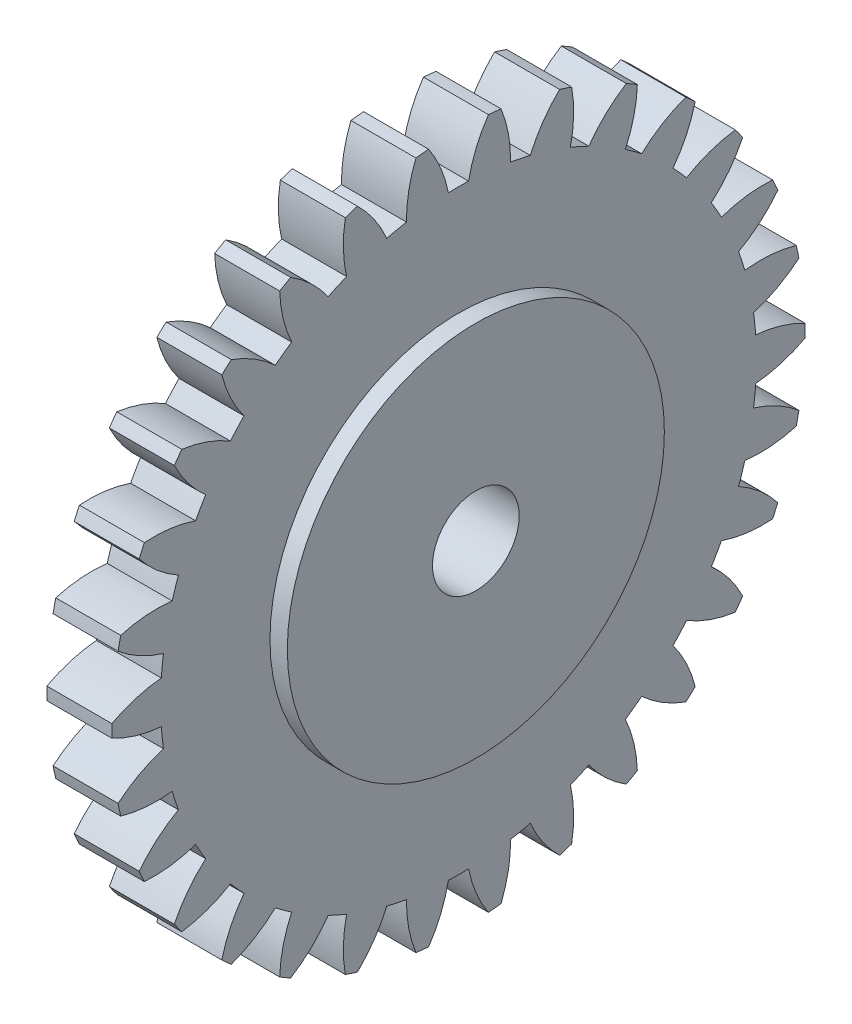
ISO-10303-21;
HEADER;
FILE_DESCRIPTION(('STEP AP214'),'2;1');
FILE_NAME('part.step','',(''),(''),'','','');
FILE_SCHEMA(('AUTOMOTIVE_DESIGN { 1 0 10303 214 1 1 1 1 }'));
ENDSEC;
DATA;
#1=APPLICATION_CONTEXT('core data for automotive mechanical design processes');
#2=APPLICATION_PROTOCOL_DEFINITION('international standard','automotive_design',2000,#1);
#3=PRODUCT_CONTEXT('',#1,'mechanical');
#4=PRODUCT('Part','Part','',(#3));
#5=PRODUCT_RELATED_PRODUCT_CATEGORY('part','',(#4));
#6=PRODUCT_DEFINITION_FORMATION('','',#4);
#7=PRODUCT_DEFINITION_CONTEXT('part definition',#1,'design');
#8=PRODUCT_DEFINITION('design','',#6,#7);
#9=PRODUCT_DEFINITION_SHAPE('','',#8);
#10=(LENGTH_UNIT() NAMED_UNIT(*) SI_UNIT(.MILLI.,.METRE.));
#11=(NAMED_UNIT(*) PLANE_ANGLE_UNIT() SI_UNIT($,.RADIAN.));
#12=(NAMED_UNIT(*) SI_UNIT($,.STERADIAN.) SOLID_ANGLE_UNIT());
#13=UNCERTAINTY_MEASURE_WITH_UNIT(LENGTH_MEASURE(1.E-05),#10,'distance_accuracy_value','');
#14=(GEOMETRIC_REPRESENTATION_CONTEXT(3) GLOBAL_UNCERTAINTY_ASSIGNED_CONTEXT((#13)) GLOBAL_UNIT_ASSIGNED_CONTEXT((#10,
#11,#12)) REPRESENTATION_CONTEXT('',''));
#15=CARTESIAN_POINT('',(0.,0.,0.));
#16=DIRECTION('',(0.,0.,1.));
#17=DIRECTION('',(1.,0.,0.));
#18=AXIS2_PLACEMENT_3D('',#15,#16,#17);
#19=CARTESIAN_POINT('',(0.,0.,0.));
#20=DIRECTION('',(1.,0.,0.));
#21=DIRECTION('',(0.,0.,-1.));
#22=AXIS2_PLACEMENT_3D('',#19,#20,#21);
#23=PLANE('',#22);
#24=CARTESIAN_POINT('',(0.,5.4931885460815,-4.41530062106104));
#25=DIRECTION('',(-1.,0.,0.));
#26=DIRECTION('',(0.,-0.207911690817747,-0.978147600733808));
#27=AXIS2_PLACEMENT_3D('',#24,#25,#26);
#28=CIRCLE('',#27,3.);
#29=CARTESIAN_POINT('',(0.,6.67145476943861,-1.65637171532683));
#30=VERTEX_POINT('',#29);
#31=CARTESIAN_POINT('',(0.,7.65239678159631,-2.33255728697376));
#32=VERTEX_POINT('',#31);
#33=EDGE_CURVE('E42',#30,#32,#28,.T.);
#34=ORIENTED_EDGE('',*,*,#33,.T.);
#35=CARTESIAN_POINT('',(0.,0.,0.));
#36=DIRECTION('',(-1.,0.,0.));
#37=DIRECTION('',(0.,0.,1.));
#38=AXIS2_PLACEMENT_3D('',#35,#36,#37);
#39=CIRCLE('',#38,8.);
#40=CARTESIAN_POINT('',(0.,7.56196181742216,-2.61088748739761));
#41=VERTEX_POINT('',#40);
#42=EDGE_CURVE('E885',#32,#41,#39,.T.);
#43=ORIENTED_EDGE('',*,*,#42,.T.);
#44=CARTESIAN_POINT('',(0.,7.03933147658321,0.343238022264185));
#45=DIRECTION('',(1.,0.,0.));
#46=DIRECTION('',(0.,0.,-1.));
#47=AXIS2_PLACEMENT_3D('',#44,#45,#46);
#48=CIRCLE('',#47,3.);
#49=CARTESIAN_POINT('',(0.,6.3709111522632,-2.58134985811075));
#50=VERTEX_POINT('',#49);
#51=EDGE_CURVE('E789',#50,#41,#48,.T.);
#52=ORIENTED_EDGE('',*,*,#51,.F.);
#53=CARTESIAN_POINT('',(0.,0.,0.));
#54=DIRECTION('',(-1.,0.,0.));
#55=DIRECTION('',(0.,-0.406736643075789,-0.913545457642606));
#56=AXIS2_PLACEMENT_3D('',#53,#54,#55);
#57=CIRCLE('',#56,6.874);
#58=CARTESIAN_POINT('',(0.,6.18128843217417,-3.00724946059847));
#59=VERTEX_POINT('',#58);
#60=EDGE_CURVE('E1517',#50,#59,#57,.T.);
#61=ORIENTED_EDGE('',*,*,#60,.T.);
#62=CARTESIAN_POINT('',(0.,4.45515657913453,-5.4609138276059));
#63=DIRECTION('',(-1.,0.,0.));
#64=DIRECTION('',(0.,-0.406736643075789,-0.913545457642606));
#65=AXIS2_PLACEMENT_3D('',#62,#63,#64);
#66=CIRCLE('',#65,3.);
#67=CARTESIAN_POINT('',(0.,7.00020762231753,-3.87260806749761));
#68=VERTEX_POINT('',#67);
#69=EDGE_CURVE('E50',#59,#68,#66,.T.);
#70=ORIENTED_EDGE('',*,*,#69,.T.);
#71=CARTESIAN_POINT('',(0.,6.85388077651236,-4.12605359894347));
#72=VERTEX_POINT('',#71);
#73=EDGE_CURVE('E2662',#68,#72,#39,.T.);
#74=ORIENTED_EDGE('',*,*,#73,.T.);
#75=CARTESIAN_POINT('',(0.,6.95686839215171,-1.12782186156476));
#76=DIRECTION('',(1.,0.,0.));
#77=DIRECTION('',(0.,0.,-1.));
#78=AXIS2_PLACEMENT_3D('',#75,#76,#77);
#79=CIRCLE('',#78,3.);
#80=CARTESIAN_POINT('',(0.,5.69499864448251,-3.84952808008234));
#81=VERTEX_POINT('',#80);
#82=EDGE_CURVE('E793',#81,#72,#79,.T.);
#83=ORIENTED_EDGE('',*,*,#82,.F.);
#84=CARTESIAN_POINT('',(0.,0.,0.));
#85=DIRECTION('',(-1.,0.,0.));
#86=DIRECTION('',(0.,-0.587785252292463,-0.809016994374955));
#87=AXIS2_PLACEMENT_3D('',#84,#85,#86);
#88=CIRCLE('',#87,6.874);
#89=CARTESIAN_POINT('',(0.,5.42097012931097,-4.22669597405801));
#90=VERTEX_POINT('',#89);
#91=EDGE_CURVE('E1496',#81,#90,#88,.T.);
#92=ORIENTED_EDGE('',*,*,#91,.T.);
#93=CARTESIAN_POINT('',(0.,3.22241289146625,-6.2678588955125));
#94=DIRECTION('',(-1.,0.,0.));
#95=DIRECTION('',(0.,-0.587785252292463,-0.809016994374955));
#96=AXIS2_PLACEMENT_3D('',#93,#94,#95);
#97=CIRCLE('',#96,3.);
#98=CARTESIAN_POINT('',(0.,6.04207579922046,-5.24340729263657));
#99=VERTEX_POINT('',#98);
#100=EDGE_CURVE('E1499',#90,#99,#97,.T.);
#101=ORIENTED_EDGE('',*,*,#100,.T.);
#102=CARTESIAN_POINT('',(0.,5.84625225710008,-5.46089136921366));
#103=VERTEX_POINT('',#102);
#104=EDGE_CURVE('E2671',#99,#103,#39,.T.);
#105=ORIENTED_EDGE('',*,*,#104,.T.);
#106=CARTESIAN_POINT('',(0.,6.57035677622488,-2.5495905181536));
#107=DIRECTION('',(1.,0.,0.));
#108=DIRECTION('',(0.,0.,-1.));
#109=AXIS2_PLACEMENT_3D('',#106,#107,#108);
#110=CIRCLE('',#109,3.);
#111=CARTESIAN_POINT('',(0.,4.77018736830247,-4.94946345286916));
#112=VERTEX_POINT('',#111);
#113=EDGE_CURVE('E798',#112,#103,#110,.T.);
#114=ORIENTED_EDGE('',*,*,#113,.F.);
#115=CARTESIAN_POINT('',(0.,0.,0.));
#116=DIRECTION('',(-1.,0.,0.));
#117=DIRECTION('',(0.,-0.743144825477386,-0.669130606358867));
#118=AXIS2_PLACEMENT_3D('',#115,#116,#117);
#119=CIRCLE('',#118,6.874);
#120=CARTESIAN_POINT('',(0.,4.42372941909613,-5.26141559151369));
#121=VERTEX_POINT('',#120);
#122=EDGE_CURVE('E1474',#112,#121,#119,.T.);
#123=ORIENTED_EDGE('',*,*,#122,.T.);
#124=CARTESIAN_POINT('',(0.,1.84883429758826,-6.80086845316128));
#125=DIRECTION('',(-1.,0.,0.));
#126=DIRECTION('',(0.,-0.743144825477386,-0.669130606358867));
#127=AXIS2_PLACEMENT_3D('',#124,#125,#126);
#128=CIRCLE('',#127,3.);
#129=CARTESIAN_POINT('',(0.,4.81987627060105,-6.3850444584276));
#130=VERTEX_POINT('',#129);
#131=EDGE_CURVE('E1477',#121,#130,#128,.T.);
#132=ORIENTED_EDGE('',*,*,#131,.T.);
#133=CARTESIAN_POINT('',(0.,4.58311446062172,-6.55706198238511));
#134=VERTEX_POINT('',#133);
#135=EDGE_CURVE('E2672',#130,#134,#39,.T.);
#136=ORIENTED_EDGE('',*,*,#135,.T.);
#137=CARTESIAN_POINT('',(0.,5.89668904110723,-3.85992983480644));
#138=DIRECTION('',(1.,0.,0.));
#139=DIRECTION('',(0.,0.,-1.));
#140=AXIS2_PLACEMENT_3D('',#137,#138,#139);
#141=CIRCLE('',#140,3.);
#142=CARTESIAN_POINT('',(0.,3.63689601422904,-5.83308352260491));
#143=VERTEX_POINT('',#142);
#144=EDGE_CURVE('E801',#143,#134,#141,.T.);
#145=ORIENTED_EDGE('',*,*,#144,.F.);
#146=CARTESIAN_POINT('',(0.,0.,0.));
#147=DIRECTION('',(-1.,0.,0.));
#148=DIRECTION('',(0.,-0.866025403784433,-0.50000000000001));
#149=AXIS2_PLACEMENT_3D('',#146,#147,#148);
#150=CIRCLE('',#149,6.874);
#151=CARTESIAN_POINT('',(0.,3.2331505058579,-6.0661861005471));
#152=VERTEX_POINT('',#151);
#153=EDGE_CURVE('E1452',#143,#152,#150,.T.);
#154=ORIENTED_EDGE('',*,*,#153,.T.);
#155=CARTESIAN_POINT('',(0.,0.3944527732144,-7.03664742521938));
#156=DIRECTION('',(-1.,0.,0.));
#157=DIRECTION('',(0.,-0.866025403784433,-0.50000000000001));
#158=AXIS2_PLACEMENT_3D('',#155,#156,#157);
#159=CIRCLE('',#158,3.);
#160=CARTESIAN_POINT('',(0.,3.38702502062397,-7.2476245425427));
#161=VERTEX_POINT('',#160);
#162=EDGE_CURVE('E1455',#152,#161,#159,.T.);
#163=ORIENTED_EDGE('',*,*,#162,.T.);
#164=CARTESIAN_POINT('',(0.,3.11967256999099,-7.36665752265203));
#165=VERTEX_POINT('',#164);
#166=EDGE_CURVE('E2675',#161,#165,#39,.T.);
#167=ORIENTED_EDGE('',*,*,#166,.T.);
#168=CARTESIAN_POINT('',(0.,4.96530769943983,-5.00157169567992));
#169=DIRECTION('',(1.,0.,0.));
#170=DIRECTION('',(0.,0.,-1.));
#171=AXIS2_PLACEMENT_3D('',#168,#169,#170);
#172=CIRCLE('',#171,3.);
#173=CARTESIAN_POINT('',(0.,2.34465485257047,-6.46176985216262));
#174=VERTEX_POINT('',#173);
#175=EDGE_CURVE('E804',#174,#165,#172,.T.);
#176=ORIENTED_EDGE('',*,*,#175,.F.);
#177=CARTESIAN_POINT('',(0.,0.,0.));
#178=DIRECTION('',(-1.,0.,0.));
#179=DIRECTION('',(0.,-0.95105651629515,-0.309016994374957));
#180=AXIS2_PLACEMENT_3D('',#177,#178,#179);
#181=CIRCLE('',#180,6.874);
#182=CARTESIAN_POINT('',(0.,1.90126740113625,-6.60583516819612));
#183=VERTEX_POINT('',#182);
#184=EDGE_CURVE('E1430',#174,#183,#181,.T.);
#185=ORIENTED_EDGE('',*,*,#184,.T.);
#186=CARTESIAN_POINT('',(0.,-1.07716823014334,-6.9648911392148));
#187=DIRECTION('',(-1.,0.,0.));
#188=DIRECTION('',(0.,-0.95105651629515,-0.309016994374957));
#189=AXIS2_PLACEMENT_3D('',#186,#187,#188);
#190=CIRCLE('',#189,3.);
#191=CARTESIAN_POINT('',(0.,1.80614452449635,-7.79344865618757));
#192=VERTEX_POINT('',#191);
#193=EDGE_CURVE('E1433',#183,#192,#190,.T.);
#194=ORIENTED_EDGE('',*,*,#193,.T.);
#195=CARTESIAN_POINT('',(0.,1.5198860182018,-7.85429478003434));
#196=VERTEX_POINT('',#195);
#197=EDGE_CURVE('E2678',#192,#196,#39,.T.);
#198=ORIENTED_EDGE('',*,*,#197,.T.);
#199=CARTESIAN_POINT('',(0.,3.8169185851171,-5.9246208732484));
#200=DIRECTION('',(1.,0.,0.));
#201=DIRECTION('',(0.,0.,-1.));
#202=AXIS2_PLACEMENT_3D('',#199,#200,#201);
#203=CIRCLE('',#202,3.);
#204=CARTESIAN_POINT('',(0.,0.949941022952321,-6.8080458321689));
#205=VERTEX_POINT('',#204);
#206=EDGE_CURVE('E807',#205,#196,#203,.T.);
#207=ORIENTED_EDGE('',*,*,#206,.F.);
#208=CARTESIAN_POINT('',(0.,0.,0.));
#209=DIRECTION('',(-1.,0.,0.));
#210=DIRECTION('',(0.,-0.994521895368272,-0.104528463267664));
#211=AXIS2_PLACEMENT_3D('',#208,#209,#210);
#212=CIRCLE('',#211,6.874);
#213=CARTESIAN_POINT('',(0.,0.486289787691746,-6.85677754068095));
#214=VERTEX_POINT('',#213);
#215=EDGE_CURVE('E1408',#205,#214,#212,.T.);
#216=ORIENTED_EDGE('',*,*,#215,.T.);
#217=CARTESIAN_POINT('',(0.,-2.50171181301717,-6.58873568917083));
#218=DIRECTION('',(-1.,0.,0.));
#219=DIRECTION('',(0.,-0.994521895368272,-0.104528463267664));
#220=AXIS2_PLACEMENT_3D('',#217,#218,#219);
#221=CIRCLE('',#220,3.);
#222=CARTESIAN_POINT('',(0.,0.146326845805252,-7.99866166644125));
#223=VERTEX_POINT('',#222);
#224=EDGE_CURVE('E1411',#214,#223,#221,.T.);
#225=ORIENTED_EDGE('',*,*,#224,.T.);
#226=CARTESIAN_POINT('',(0.,-0.146326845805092,-7.99866166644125));
#227=VERTEX_POINT('',#226);
#228=EDGE_CURVE('E2681',#223,#227,#39,.T.);
#229=ORIENTED_EDGE('',*,*,#228,.T.);
#230=CARTESIAN_POINT('',(0.,2.5017118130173,-6.58873568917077));
#231=DIRECTION('',(1.,0.,0.));
#232=DIRECTION('',(0.,0.,-1.));
#233=AXIS2_PLACEMENT_3D('',#230,#231,#232);
#234=CIRCLE('',#233,3.);
#235=CARTESIAN_POINT('',(0.,-0.486289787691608,-6.85677754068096));
#236=VERTEX_POINT('',#235);
#237=EDGE_CURVE('E810',#236,#227,#234,.T.);
#238=ORIENTED_EDGE('',*,*,#237,.F.);
#239=CARTESIAN_POINT('',(0.,0.,0.));
#240=DIRECTION('',(-1.,0.,0.));
#241=DIRECTION('',(0.,-0.994521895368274,0.104528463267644));
#242=AXIS2_PLACEMENT_3D('',#239,#240,#241);
#243=CIRCLE('',#242,6.874);
#244=CARTESIAN_POINT('',(0.,-0.949941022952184,-6.80804583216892));
#245=VERTEX_POINT('',#244);
#246=EDGE_CURVE('E1386',#236,#245,#243,.T.);
#247=ORIENTED_EDGE('',*,*,#246,.T.);
#248=CARTESIAN_POINT('',(0.,-3.81691858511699,-5.92462087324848));
#249=DIRECTION('',(-1.,0.,0.));
#250=DIRECTION('',(0.,-0.994521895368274,0.104528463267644));
#251=AXIS2_PLACEMENT_3D('',#248,#249,#250);
#252=CIRCLE('',#251,3.);
#253=CARTESIAN_POINT('',(0.,-1.51988601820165,-7.85429478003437));
#254=VERTEX_POINT('',#253);
#255=EDGE_CURVE('E1389',#245,#254,#252,.T.);
#256=ORIENTED_EDGE('',*,*,#255,.T.);
#257=CARTESIAN_POINT('',(0.,-1.8061445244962,-7.79344865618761));
#258=VERTEX_POINT('',#257);
#259=EDGE_CURVE('E2684',#254,#258,#39,.T.);
#260=ORIENTED_EDGE('',*,*,#259,.T.);
#261=CARTESIAN_POINT('',(0.,1.07716823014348,-6.96489113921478));
#262=DIRECTION('',(1.,0.,0.));
#263=DIRECTION('',(0.,0.,-1.));
#264=AXIS2_PLACEMENT_3D('',#261,#262,#263);
#265=CIRCLE('',#264,3.);
#266=CARTESIAN_POINT('',(0.,-1.90126740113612,-6.60583516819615));
#267=VERTEX_POINT('',#266);
#268=EDGE_CURVE('E813',#267,#258,#265,.T.);
#269=ORIENTED_EDGE('',*,*,#268,.F.);
#270=CARTESIAN_POINT('',(0.,0.,0.));
#271=DIRECTION('',(-1.,0.,0.));
#272=DIRECTION('',(0.,-0.951056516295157,0.309016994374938));
#273=AXIS2_PLACEMENT_3D('',#270,#271,#272);
#274=CIRCLE('',#273,6.874);
#275=CARTESIAN_POINT('',(0.,-2.34465485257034,-6.46176985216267));
#276=VERTEX_POINT('',#275);
#277=EDGE_CURVE('E1364',#267,#276,#274,.T.);
#278=ORIENTED_EDGE('',*,*,#277,.T.);
#279=CARTESIAN_POINT('',(0.,-4.96530769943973,-5.00157169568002));
#280=DIRECTION('',(-1.,0.,0.));
#281=DIRECTION('',(0.,-0.951056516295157,0.309016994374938));
#282=AXIS2_PLACEMENT_3D('',#279,#280,#281);
#283=CIRCLE('',#282,3.);
#284=CARTESIAN_POINT('',(0.,-3.11967256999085,-7.3666575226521));
#285=VERTEX_POINT('',#284);
#286=EDGE_CURVE('E1367',#276,#285,#283,.T.);
#287=ORIENTED_EDGE('',*,*,#286,.T.);
#288=CARTESIAN_POINT('',(0.,-3.38702502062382,-7.24762454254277));
#289=VERTEX_POINT('',#288);
#290=EDGE_CURVE('E2687',#285,#289,#39,.T.);
#291=ORIENTED_EDGE('',*,*,#290,.T.);
#292=CARTESIAN_POINT('',(0.,-0.394452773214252,-7.03664742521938));
#293=DIRECTION('',(1.,0.,0.));
#294=DIRECTION('',(0.,0.,-1.));
#295=AXIS2_PLACEMENT_3D('',#292,#293,#294);
#296=CIRCLE('',#295,3.);
#297=CARTESIAN_POINT('',(0.,-3.23315050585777,-6.06618610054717));
#298=VERTEX_POINT('',#297);
#299=EDGE_CURVE('E816',#298,#289,#296,.T.);
#300=ORIENTED_EDGE('',*,*,#299,.F.);
#301=CARTESIAN_POINT('',(0.,0.,0.));
#302=DIRECTION('',(-1.,0.,0.));
#303=DIRECTION('',(0.,-0.866025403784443,0.499999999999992));
#304=AXIS2_PLACEMENT_3D('',#301,#302,#303);
#305=CIRCLE('',#304,6.874);
#306=CARTESIAN_POINT('',(0.,-3.63689601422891,-5.83308352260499));
#307=VERTEX_POINT('',#306);
#308=EDGE_CURVE('E1342',#298,#307,#305,.T.);
#309=ORIENTED_EDGE('',*,*,#308,.T.);
#310=CARTESIAN_POINT('',(0.,-5.89668904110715,-3.85992983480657));
#311=DIRECTION('',(-1.,0.,0.));
#312=DIRECTION('',(0.,-0.866025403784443,0.499999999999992));
#313=AXIS2_PLACEMENT_3D('',#310,#311,#312);
#314=CIRCLE('',#313,3.);
#315=CARTESIAN_POINT('',(0.,-4.58311446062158,-6.55706198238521));
#316=VERTEX_POINT('',#315);
#317=EDGE_CURVE('E1345',#307,#316,#314,.T.);
#318=ORIENTED_EDGE('',*,*,#317,.T.);
#319=CARTESIAN_POINT('',(0.,-4.81987627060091,-6.3850444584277));
#320=VERTEX_POINT('',#319);
#321=EDGE_CURVE('E2690',#316,#320,#39,.T.);
#322=ORIENTED_EDGE('',*,*,#321,.T.);
#323=CARTESIAN_POINT('',(0.,-1.84883429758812,-6.80086845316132));
#324=DIRECTION('',(1.,0.,0.));
#325=DIRECTION('',(0.,0.,-1.));
#326=AXIS2_PLACEMENT_3D('',#323,#324,#325);
#327=CIRCLE('',#326,3.);
#328=CARTESIAN_POINT('',(0.,-4.42372941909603,-5.26141559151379));
#329=VERTEX_POINT('',#328);
#330=EDGE_CURVE('E819',#329,#320,#327,.T.);
#331=ORIENTED_EDGE('',*,*,#330,.F.);
#332=CARTESIAN_POINT('',(0.,0.,0.));
#333=DIRECTION('',(-1.,0.,0.));
#334=DIRECTION('',(0.,-0.7431448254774,0.669130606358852));
#335=AXIS2_PLACEMENT_3D('',#332,#333,#334);
#336=CIRCLE('',#335,6.874);
#337=CARTESIAN_POINT('',(0.,-4.77018736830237,-4.94946345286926));
#338=VERTEX_POINT('',#337);
#339=EDGE_CURVE('E1320',#329,#338,#336,.T.);
#340=ORIENTED_EDGE('',*,*,#339,.T.);
#341=CARTESIAN_POINT('',(0.,-6.57035677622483,-2.54959051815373));
#342=DIRECTION('',(-1.,0.,0.));
#343=DIRECTION('',(0.,-0.7431448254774,0.669130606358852));
#344=AXIS2_PLACEMENT_3D('',#341,#342,#343);
#345=CIRCLE('',#344,3.);
#346=CARTESIAN_POINT('',(0.,-5.84625225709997,-5.46089136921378));
#347=VERTEX_POINT('',#346);
#348=EDGE_CURVE('E1323',#338,#347,#345,.T.);
#349=ORIENTED_EDGE('',*,*,#348,.T.);
#350=CARTESIAN_POINT('',(0.,-6.04207579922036,-5.2434072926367));
#351=VERTEX_POINT('',#350);
#352=EDGE_CURVE('E2693',#347,#351,#39,.T.);
#353=ORIENTED_EDGE('',*,*,#352,.T.);
#354=CARTESIAN_POINT('',(0.,-3.22241289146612,-6.26785889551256));
#355=DIRECTION('',(1.,0.,0.));
#356=DIRECTION('',(0.,0.,-1.));
#357=AXIS2_PLACEMENT_3D('',#354,#355,#356);
#358=CIRCLE('',#357,3.);
#359=CARTESIAN_POINT('',(0.,-5.42097012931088,-4.22669597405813));
#360=VERTEX_POINT('',#359);
#361=EDGE_CURVE('E822',#360,#351,#358,.T.);
#362=ORIENTED_EDGE('',*,*,#361,.F.);
#363=CARTESIAN_POINT('',(0.,0.,0.));
#364=DIRECTION('',(-1.,0.,0.));
#365=DIRECTION('',(0.,-0.58778525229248,0.809016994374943));
#366=AXIS2_PLACEMENT_3D('',#363,#364,#365);
#367=CIRCLE('',#366,6.874);
#368=CARTESIAN_POINT('',(0.,-5.69499864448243,-3.84952808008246));
#369=VERTEX_POINT('',#368);
#370=EDGE_CURVE('E1298',#360,#369,#367,.T.);
#371=ORIENTED_EDGE('',*,*,#370,.T.);
#372=CARTESIAN_POINT('',(0.,-6.95686839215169,-1.1278218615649));
#373=DIRECTION('',(-1.,0.,0.));
#374=DIRECTION('',(0.,-0.58778525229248,0.809016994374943));
#375=AXIS2_PLACEMENT_3D('',#372,#373,#374);
#376=CIRCLE('',#375,3.);
#377=CARTESIAN_POINT('',(0.,-6.85388077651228,-4.12605359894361));
#378=VERTEX_POINT('',#377);
#379=EDGE_CURVE('E1301',#369,#378,#376,.T.);
#380=ORIENTED_EDGE('',*,*,#379,.T.);
#381=CARTESIAN_POINT('',(0.,-7.00020762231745,-3.87260806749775));
#382=VERTEX_POINT('',#381);
#383=EDGE_CURVE('E2696',#378,#382,#39,.T.);
#384=ORIENTED_EDGE('',*,*,#383,.T.);
#385=CARTESIAN_POINT('',(0.,-4.45515657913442,-5.46091382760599));
#386=DIRECTION('',(1.,0.,0.));
#387=DIRECTION('',(0.,0.,-1.));
#388=AXIS2_PLACEMENT_3D('',#385,#386,#387);
#389=CIRCLE('',#388,3.);
#390=CARTESIAN_POINT('',(0.,-6.18128843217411,-3.00724946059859));
#391=VERTEX_POINT('',#390);
#392=EDGE_CURVE('E825',#391,#382,#389,.T.);
#393=ORIENTED_EDGE('',*,*,#392,.F.);
#394=CARTESIAN_POINT('',(0.,0.,0.));
#395=DIRECTION('',(-1.,0.,0.));
#396=DIRECTION('',(0.,-0.406736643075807,0.913545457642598));
#397=AXIS2_PLACEMENT_3D('',#394,#395,#396);
#398=CIRCLE('',#397,6.874);
#399=CARTESIAN_POINT('',(0.,-6.37091115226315,-2.58134985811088));
#400=VERTEX_POINT('',#399);
#401=EDGE_CURVE('E1276',#391,#400,#398,.T.);
#402=ORIENTED_EDGE('',*,*,#401,.T.);
#403=CARTESIAN_POINT('',(0.,-7.03933147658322,0.343238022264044));
#404=DIRECTION('',(-1.,0.,0.));
#405=DIRECTION('',(0.,-0.406736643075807,0.913545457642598));
#406=AXIS2_PLACEMENT_3D('',#403,#404,#405);
#407=CIRCLE('',#406,3.);
#408=CARTESIAN_POINT('',(0.,-7.5619618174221,-2.61088748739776));
#409=VERTEX_POINT('',#408);
#410=EDGE_CURVE('E1279',#400,#409,#407,.T.);
#411=ORIENTED_EDGE('',*,*,#410,.T.);
#412=CARTESIAN_POINT('',(0.,-7.65239678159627,-2.33255728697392));
#413=VERTEX_POINT('',#412);
#414=EDGE_CURVE('E2699',#409,#413,#39,.T.);
#415=ORIENTED_EDGE('',*,*,#414,.T.);
#416=CARTESIAN_POINT('',(0.,-5.49318854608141,-4.41530062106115));
#417=DIRECTION('',(1.,0.,0.));
#418=DIRECTION('',(0.,0.,-1.));
#419=AXIS2_PLACEMENT_3D('',#416,#417,#418);
#420=CIRCLE('',#419,3.);
#421=CARTESIAN_POINT('',(0.,-6.67145476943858,-1.65637171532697));
#422=VERTEX_POINT('',#421);
#423=EDGE_CURVE('E828',#422,#413,#420,.T.);
#424=ORIENTED_EDGE('',*,*,#423,.F.);
#425=CARTESIAN_POINT('',(0.,0.,0.));
#426=DIRECTION('',(-1.,0.,0.));
#427=DIRECTION('',(0.,-0.207911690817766,0.978147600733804));
#428=AXIS2_PLACEMENT_3D('',#425,#426,#427);
#429=CIRCLE('',#428,6.874);
#430=CARTESIAN_POINT('',(0.,-6.76838427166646,-1.20035426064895));
#431=VERTEX_POINT('',#430);
#432=EDGE_CURVE('E1254',#422,#431,#429,.T.);
#433=ORIENTED_EDGE('',*,*,#432,.T.);
#434=CARTESIAN_POINT('',(0.,-6.81414199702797,1.79929675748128));
#435=DIRECTION('',(-1.,0.,0.));
#436=DIRECTION('',(0.,-0.207911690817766,0.978147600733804));
#437=AXIS2_PLACEMENT_3D('',#434,#435,#436);
#438=CIRCLE('',#437,3.);
#439=CARTESIAN_POINT('',(0.,-7.93954884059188,-0.981613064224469));
#440=VERTEX_POINT('',#439);
#441=EDGE_CURVE('E1257',#431,#440,#438,.T.);
#442=ORIENTED_EDGE('',*,*,#441,.T.);
#443=CARTESIAN_POINT('',(0.,-7.97013948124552,-0.690562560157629));
#444=VERTEX_POINT('',#443);
#445=EDGE_CURVE('E2702',#440,#444,#39,.T.);
#446=ORIENTED_EDGE('',*,*,#445,.T.);
#447=CARTESIAN_POINT('',(0.,-6.29114181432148,-3.17671759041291));
#448=DIRECTION('',(1.,0.,0.));
#449=DIRECTION('',(0.,0.,-1.));
#450=AXIS2_PLACEMENT_3D('',#447,#448,#449);
#451=CIRCLE('',#450,3.);
#452=CARTESIAN_POINT('',(0.,-6.8700465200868,-0.233102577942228));
#453=VERTEX_POINT('',#452);
#454=EDGE_CURVE('E831',#453,#444,#451,.T.);
#455=ORIENTED_EDGE('',*,*,#454,.F.);
#456=CARTESIAN_POINT('',(0.,0.,0.));
#457=DIRECTION('',(-1.,0.,0.));
#458=DIRECTION('',(0.,0.,1.));
#459=AXIS2_PLACEMENT_3D('',#456,#457,#458);
#460=CIRCLE('',#459,6.874);
#461=CARTESIAN_POINT('',(0.,-6.8700465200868,0.233102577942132));
#462=VERTEX_POINT('',#461);
#463=EDGE_CURVE('E1232',#453,#462,#460,.T.);
#464=ORIENTED_EDGE('',*,*,#463,.T.);
#465=CARTESIAN_POINT('',(0.,-6.29114181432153,3.17671759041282));
#466=DIRECTION('',(-1.,0.,0.));
#467=DIRECTION('',(0.,0.,1.));
#468=AXIS2_PLACEMENT_3D('',#465,#466,#467);
#469=CIRCLE('',#468,3.);
#470=CARTESIAN_POINT('',(0.,-7.97013948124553,0.690562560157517));
#471=VERTEX_POINT('',#470);
#472=EDGE_CURVE('E1235',#462,#471,#469,.T.);
#473=ORIENTED_EDGE('',*,*,#472,.T.);
#474=CARTESIAN_POINT('',(0.,-7.93954884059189,0.981613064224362));
#475=VERTEX_POINT('',#474);
#476=EDGE_CURVE('E2705',#471,#475,#39,.T.);
#477=ORIENTED_EDGE('',*,*,#476,.T.);
#478=CARTESIAN_POINT('',(0.,-6.81414199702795,-1.79929675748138));
#479=DIRECTION('',(1.,0.,0.));
#480=DIRECTION('',(0.,0.,-1.));
#481=AXIS2_PLACEMENT_3D('',#478,#479,#480);
#482=CIRCLE('',#481,3.);
#483=CARTESIAN_POINT('',(0.,-6.76838427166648,1.20035426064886));
#484=VERTEX_POINT('',#483);
#485=EDGE_CURVE('E834',#484,#475,#482,.T.);
#486=ORIENTED_EDGE('',*,*,#485,.F.);
#487=CARTESIAN_POINT('',(0.,0.,0.));
#488=DIRECTION('',(-1.,0.,0.));
#489=DIRECTION('',(0.,0.207911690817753,0.978147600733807));
#490=AXIS2_PLACEMENT_3D('',#487,#488,#489);
#491=CIRCLE('',#490,6.874);
#492=CARTESIAN_POINT('',(0.,-6.67145476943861,1.65637171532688));
#493=VERTEX_POINT('',#492);
#494=EDGE_CURVE('E1210',#484,#493,#491,.T.);
#495=ORIENTED_EDGE('',*,*,#494,.T.);
#496=CARTESIAN_POINT('',(0.,-5.49318854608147,4.41530062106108));
#497=DIRECTION('',(-1.,0.,0.));
#498=DIRECTION('',(0.,0.207911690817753,0.978147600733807));
#499=AXIS2_PLACEMENT_3D('',#496,#497,#498);
#500=CIRCLE('',#499,3.);
#501=CARTESIAN_POINT('',(0.,-7.6523967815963,2.33255728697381));
#502=VERTEX_POINT('',#501);
#503=EDGE_CURVE('E1213',#493,#502,#500,.T.);
#504=ORIENTED_EDGE('',*,*,#503,.T.);
#505=CARTESIAN_POINT('',(0.,-7.56196181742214,2.61088748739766));
#506=VERTEX_POINT('',#505);
#507=EDGE_CURVE('E2708',#502,#506,#39,.T.);
#508=ORIENTED_EDGE('',*,*,#507,.T.);
#509=CARTESIAN_POINT('',(0.,-7.03933147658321,-0.343238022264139));
#510=DIRECTION('',(1.,0.,0.));
#511=DIRECTION('',(0.,0.,-1.));
#512=AXIS2_PLACEMENT_3D('',#509,#510,#511);
#513=CIRCLE('',#512,3.);
#514=CARTESIAN_POINT('',(0.,-6.37091115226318,2.58134985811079));
#515=VERTEX_POINT('',#514);
#516=EDGE_CURVE('E837',#515,#506,#513,.T.);
#517=ORIENTED_EDGE('',*,*,#516,.F.);
#518=CARTESIAN_POINT('',(0.,0.,0.));
#519=DIRECTION('',(-1.,0.,0.));
#520=DIRECTION('',(0.,0.406736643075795,0.913545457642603));
#521=AXIS2_PLACEMENT_3D('',#518,#519,#520);
#522=CIRCLE('',#521,6.874);
#523=CARTESIAN_POINT('',(0.,-6.18128843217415,3.00724946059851));
#524=VERTEX_POINT('',#523);
#525=EDGE_CURVE('E1188',#515,#524,#522,.T.);
#526=ORIENTED_EDGE('',*,*,#525,.T.);
#527=CARTESIAN_POINT('',(0.,-4.4551565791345,5.46091382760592));
#528=DIRECTION('',(-1.,0.,0.));
#529=DIRECTION('',(0.,0.406736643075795,0.913545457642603));
#530=AXIS2_PLACEMENT_3D('',#527,#528,#529);
#531=CIRCLE('',#530,3.);
#532=CARTESIAN_POINT('',(0.,-7.0002076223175,3.87260806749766));
#533=VERTEX_POINT('',#532);
#534=EDGE_CURVE('E1191',#524,#533,#531,.T.);
#535=ORIENTED_EDGE('',*,*,#534,.T.);
#536=CARTESIAN_POINT('',(0.,-6.85388077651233,4.12605359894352));
#537=VERTEX_POINT('',#536);
#538=EDGE_CURVE('E2711',#533,#537,#39,.T.);
#539=ORIENTED_EDGE('',*,*,#538,.T.);
#540=CARTESIAN_POINT('',(0.,-6.95686839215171,1.12782186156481));
#541=DIRECTION('',(1.,0.,0.));
#542=DIRECTION('',(0.,0.,-1.));
#543=AXIS2_PLACEMENT_3D('',#540,#541,#542);
#544=CIRCLE('',#543,3.);
#545=CARTESIAN_POINT('',(0.,-5.69499864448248,3.84952808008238));
#546=VERTEX_POINT('',#545);
#547=EDGE_CURVE('E840',#546,#537,#544,.T.);
#548=ORIENTED_EDGE('',*,*,#547,.F.);
#549=CARTESIAN_POINT('',(0.,0.,0.));
#550=DIRECTION('',(-1.,0.,0.));
#551=DIRECTION('',(0.,0.587785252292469,0.80901699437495));
#552=AXIS2_PLACEMENT_3D('',#549,#550,#551);
#553=CIRCLE('',#552,6.874);
#554=CARTESIAN_POINT('',(0.,-5.42097012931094,4.22669597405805));
#555=VERTEX_POINT('',#554);
#556=EDGE_CURVE('E1166',#546,#555,#553,.T.);
#557=ORIENTED_EDGE('',*,*,#556,.T.);
#558=CARTESIAN_POINT('',(0.,-3.2224128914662,6.26785889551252));
#559=DIRECTION('',(-1.,0.,0.));
#560=DIRECTION('',(0.,0.587785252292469,0.80901699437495));
#561=AXIS2_PLACEMENT_3D('',#558,#559,#560);
#562=CIRCLE('',#561,3.);
#563=CARTESIAN_POINT('',(0.,-6.04207579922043,5.24340729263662));
#564=VERTEX_POINT('',#563);
#565=EDGE_CURVE('E1169',#555,#564,#562,.T.);
#566=ORIENTED_EDGE('',*,*,#565,.T.);
#567=CARTESIAN_POINT('',(0.,-5.84625225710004,5.4608913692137));
#568=VERTEX_POINT('',#567);
#569=EDGE_CURVE('E2714',#564,#568,#39,.T.);
#570=ORIENTED_EDGE('',*,*,#569,.T.);
#571=CARTESIAN_POINT('',(0.,-6.57035677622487,2.54959051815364));
#572=DIRECTION('',(1.,0.,0.));
#573=DIRECTION('',(0.,0.,-1.));
#574=AXIS2_PLACEMENT_3D('',#571,#572,#573);
#575=CIRCLE('',#574,3.);
#576=CARTESIAN_POINT('',(0.,-4.77018736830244,4.94946345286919));
#577=VERTEX_POINT('',#576);
#578=EDGE_CURVE('E843',#577,#568,#575,.T.);
#579=ORIENTED_EDGE('',*,*,#578,.F.);
#580=CARTESIAN_POINT('',(0.,0.,0.));
#581=DIRECTION('',(-1.,0.,0.));
#582=DIRECTION('',(0.,0.743144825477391,0.669130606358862));
#583=AXIS2_PLACEMENT_3D('',#580,#581,#582);
#584=CIRCLE('',#583,6.874);
#585=CARTESIAN_POINT('',(0.,-4.4237294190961,5.26141559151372));
#586=VERTEX_POINT('',#585);
#587=EDGE_CURVE('E1144',#577,#586,#584,.T.);
#588=ORIENTED_EDGE('',*,*,#587,.T.);
#589=CARTESIAN_POINT('',(0.,-1.84883429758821,6.80086845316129));
#590=DIRECTION('',(-1.,0.,0.));
#591=DIRECTION('',(0.,0.743144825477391,0.669130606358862));
#592=AXIS2_PLACEMENT_3D('',#589,#590,#591);
#593=CIRCLE('',#592,3.);
#594=CARTESIAN_POINT('',(0.,-4.819876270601,6.38504445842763));
#595=VERTEX_POINT('',#594);
#596=EDGE_CURVE('E1147',#586,#595,#593,.T.);
#597=ORIENTED_EDGE('',*,*,#596,.T.);
#598=CARTESIAN_POINT('',(0.,-4.58311446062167,6.55706198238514));
#599=VERTEX_POINT('',#598);
#600=EDGE_CURVE('E2717',#595,#599,#39,.T.);
#601=ORIENTED_EDGE('',*,*,#600,.T.);
#602=CARTESIAN_POINT('',(0.,-5.8966890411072,3.85992983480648));
#603=DIRECTION('',(1.,0.,0.));
#604=DIRECTION('',(0.,0.,-1.));
#605=AXIS2_PLACEMENT_3D('',#602,#603,#604);
#606=CIRCLE('',#605,3.);
#607=CARTESIAN_POINT('',(0.,-3.636896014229,5.83308352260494));
#608=VERTEX_POINT('',#607);
#609=EDGE_CURVE('E846',#608,#599,#606,.T.);
#610=ORIENTED_EDGE('',*,*,#609,.F.);
#611=CARTESIAN_POINT('',(0.,0.,0.));
#612=DIRECTION('',(-1.,0.,0.));
#613=DIRECTION('',(0.,0.866025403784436,0.500000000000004));
#614=AXIS2_PLACEMENT_3D('',#611,#612,#613);
#615=CIRCLE('',#614,6.874);
#616=CARTESIAN_POINT('',(0.,-3.23315050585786,6.06618610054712));
#617=VERTEX_POINT('',#616);
#618=EDGE_CURVE('E1122',#608,#617,#615,.T.);
#619=ORIENTED_EDGE('',*,*,#618,.T.);
#620=CARTESIAN_POINT('',(0.,-0.394452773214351,7.03664742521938));
#621=DIRECTION('',(-1.,0.,0.));
#622=DIRECTION('',(0.,0.866025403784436,0.500000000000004));
#623=AXIS2_PLACEMENT_3D('',#620,#621,#622);
#624=CIRCLE('',#623,3.);
#625=CARTESIAN_POINT('',(0.,-3.38702502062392,7.24762454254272));
#626=VERTEX_POINT('',#625);
#627=EDGE_CURVE('E1125',#617,#626,#624,.T.);
#628=ORIENTED_EDGE('',*,*,#627,.T.);
#629=CARTESIAN_POINT('',(0.,-3.11967256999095,7.36665752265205));
#630=VERTEX_POINT('',#629);
#631=EDGE_CURVE('E2720',#626,#630,#39,.T.);
#632=ORIENTED_EDGE('',*,*,#631,.T.);
#633=CARTESIAN_POINT('',(0.,-4.9653076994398,5.00157169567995));
#634=DIRECTION('',(1.,0.,0.));
#635=DIRECTION('',(0.,0.,-1.));
#636=AXIS2_PLACEMENT_3D('',#633,#634,#635);
#637=CIRCLE('',#636,3.);
#638=CARTESIAN_POINT('',(0.,-2.34465485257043,6.46176985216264));
#639=VERTEX_POINT('',#638);
#640=EDGE_CURVE('E849',#639,#630,#637,.T.);
#641=ORIENTED_EDGE('',*,*,#640,.F.);
#642=CARTESIAN_POINT('',(0.,0.,0.));
#643=DIRECTION('',(-1.,0.,0.));
#644=DIRECTION('',(0.,0.951056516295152,0.309016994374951));
#645=AXIS2_PLACEMENT_3D('',#642,#643,#644);
#646=CIRCLE('',#645,6.874);
#647=CARTESIAN_POINT('',(0.,-1.90126740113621,6.60583516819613));
#648=VERTEX_POINT('',#647);
#649=EDGE_CURVE('E1100',#639,#648,#646,.T.);
#650=ORIENTED_EDGE('',*,*,#649,.T.);
#651=CARTESIAN_POINT('',(0.,1.07716823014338,6.96489113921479));
#652=DIRECTION('',(-1.,0.,0.));
#653=DIRECTION('',(0.,0.951056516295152,0.309016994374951));
#654=AXIS2_PLACEMENT_3D('',#651,#652,#653);
#655=CIRCLE('',#654,3.);
#656=CARTESIAN_POINT('',(0.,-1.8061445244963,7.79344865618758));
#657=VERTEX_POINT('',#656);
#658=EDGE_CURVE('E1103',#648,#657,#655,.T.);
#659=ORIENTED_EDGE('',*,*,#658,.T.);
#660=CARTESIAN_POINT('',(0.,-1.51988601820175,7.85429478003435));
#661=VERTEX_POINT('',#660);
#662=EDGE_CURVE('E2723',#657,#661,#39,.T.);
#663=ORIENTED_EDGE('',*,*,#662,.T.);
#664=CARTESIAN_POINT('',(0.,-3.81691858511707,5.92462087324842));
#665=DIRECTION('',(1.,0.,0.));
#666=DIRECTION('',(0.,0.,-1.));
#667=AXIS2_PLACEMENT_3D('',#664,#665,#666);
#668=CIRCLE('',#667,3.);
#669=CARTESIAN_POINT('',(0.,-0.949941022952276,6.8080458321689));
#670=VERTEX_POINT('',#669);
#671=EDGE_CURVE('E852',#670,#661,#668,.T.);
#672=ORIENTED_EDGE('',*,*,#671,.F.);
#673=CARTESIAN_POINT('',(0.,0.,0.));
#674=DIRECTION('',(-1.,0.,0.));
#675=DIRECTION('',(0.,0.994521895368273,0.104528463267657));
#676=AXIS2_PLACEMENT_3D('',#673,#674,#675);
#677=CIRCLE('',#676,6.874);
#678=CARTESIAN_POINT('',(0.,-0.486289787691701,6.85677754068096));
#679=VERTEX_POINT('',#678);
#680=EDGE_CURVE('E1078',#670,#679,#677,.T.);
#681=ORIENTED_EDGE('',*,*,#680,.T.);
#682=CARTESIAN_POINT('',(0.,2.50171181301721,6.58873568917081));
#683=DIRECTION('',(-1.,0.,0.));
#684=DIRECTION('',(0.,0.994521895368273,0.104528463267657));
#685=AXIS2_PLACEMENT_3D('',#682,#683,#684);
#686=CIRCLE('',#685,3.);
#687=CARTESIAN_POINT('',(0.,-0.1463268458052,7.99866166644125));
#688=VERTEX_POINT('',#687);
#689=EDGE_CURVE('E1081',#679,#688,#686,.T.);
#690=ORIENTED_EDGE('',*,*,#689,.T.);
#691=CARTESIAN_POINT('',(0.,0.146326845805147,7.99866166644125));
#692=VERTEX_POINT('',#691);
#693=EDGE_CURVE('E2726',#688,#692,#39,.T.);
#694=ORIENTED_EDGE('',*,*,#693,.T.);
#695=CARTESIAN_POINT('',(0.,-2.50171181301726,6.58873568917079));
#696=DIRECTION('',(1.,0.,0.));
#697=DIRECTION('',(0.,0.,-1.));
#698=AXIS2_PLACEMENT_3D('',#695,#696,#697);
#699=CIRCLE('',#698,3.);
#700=CARTESIAN_POINT('',(0.,0.486289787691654,6.85677754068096));
#701=VERTEX_POINT('',#700);
#702=EDGE_CURVE('E855',#701,#692,#699,.T.);
#703=ORIENTED_EDGE('',*,*,#702,.F.);
#704=CARTESIAN_POINT('',(0.,0.,0.));
#705=DIRECTION('',(-1.,0.,0.));
#706=DIRECTION('',(0.,0.994521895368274,-0.10452846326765));
#707=AXIS2_PLACEMENT_3D('',#704,#705,#706);
#708=CIRCLE('',#707,6.874);
#709=CARTESIAN_POINT('',(0.,0.94994102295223,6.80804583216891));
#710=VERTEX_POINT('',#709);
#711=EDGE_CURVE('E1056',#701,#710,#708,.T.);
#712=ORIENTED_EDGE('',*,*,#711,.T.);
#713=CARTESIAN_POINT('',(0.,3.81691858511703,5.92462087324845));
#714=DIRECTION('',(-1.,0.,0.));
#715=DIRECTION('',(0.,0.994521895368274,-0.10452846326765));
#716=AXIS2_PLACEMENT_3D('',#713,#714,#715);
#717=CIRCLE('',#716,3.);
#718=CARTESIAN_POINT('',(0.,1.5198860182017,7.85429478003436));
#719=VERTEX_POINT('',#718);
#720=EDGE_CURVE('E1059',#710,#719,#717,.T.);
#721=ORIENTED_EDGE('',*,*,#720,.T.);
#722=CARTESIAN_POINT('',(0.,1.80614452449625,7.7934486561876));
#723=VERTEX_POINT('',#722);
#724=EDGE_CURVE('E2729',#719,#723,#39,.T.);
#725=ORIENTED_EDGE('',*,*,#724,.T.);
#726=CARTESIAN_POINT('',(0.,-1.07716823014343,6.96489113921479));
#727=DIRECTION('',(1.,0.,0.));
#728=DIRECTION('',(0.,0.,-1.));
#729=AXIS2_PLACEMENT_3D('',#726,#727,#728);
#730=CIRCLE('',#729,3.);
#731=CARTESIAN_POINT('',(0.,1.90126740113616,6.60583516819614));
#732=VERTEX_POINT('',#731);
#733=EDGE_CURVE('E858',#732,#723,#730,.T.);
#734=ORIENTED_EDGE('',*,*,#733,.F.);
#735=CARTESIAN_POINT('',(0.,0.,0.));
#736=DIRECTION('',(-1.,0.,0.));
#737=DIRECTION('',(0.,0.951056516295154,-0.309016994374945));
#738=AXIS2_PLACEMENT_3D('',#735,#736,#737);
#739=CIRCLE('',#738,6.874);
#740=CARTESIAN_POINT('',(0.,2.34465485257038,6.46176985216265));
#741=VERTEX_POINT('',#740);
#742=EDGE_CURVE('E1034',#732,#741,#739,.T.);
#743=ORIENTED_EDGE('',*,*,#742,.T.);
#744=CARTESIAN_POINT('',(0.,4.96530769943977,5.00157169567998));
#745=DIRECTION('',(-1.,0.,0.));
#746=DIRECTION('',(0.,0.951056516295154,-0.309016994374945));
#747=AXIS2_PLACEMENT_3D('',#744,#745,#746);
#748=CIRCLE('',#747,3.);
#749=CARTESIAN_POINT('',(0.,3.1196725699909,7.36665752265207));
#750=VERTEX_POINT('',#749);
#751=EDGE_CURVE('E1037',#741,#750,#748,.T.);
#752=ORIENTED_EDGE('',*,*,#751,.T.);
#753=CARTESIAN_POINT('',(0.,3.38702502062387,7.24762454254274));
#754=VERTEX_POINT('',#753);
#755=EDGE_CURVE('E2732',#750,#754,#39,.T.);
#756=ORIENTED_EDGE('',*,*,#755,.T.);
#757=CARTESIAN_POINT('',(0.,0.394452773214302,7.03664742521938));
#758=DIRECTION('',(1.,0.,0.));
#759=DIRECTION('',(0.,0.,-1.));
#760=AXIS2_PLACEMENT_3D('',#757,#758,#759);
#761=CIRCLE('',#760,3.);
#762=CARTESIAN_POINT('',(0.,3.23315050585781,6.06618610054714));
#763=VERTEX_POINT('',#762);
#764=EDGE_CURVE('E861',#763,#754,#761,.T.);
#765=ORIENTED_EDGE('',*,*,#764,.F.);
#766=CARTESIAN_POINT('',(0.,0.,0.));
#767=DIRECTION('',(-1.,0.,0.));
#768=DIRECTION('',(0.,0.86602540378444,-0.499999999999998));
#769=AXIS2_PLACEMENT_3D('',#766,#767,#768);
#770=CIRCLE('',#769,6.874);
#771=CARTESIAN_POINT('',(0.,3.63689601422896,5.83308352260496));
#772=VERTEX_POINT('',#771);
#773=EDGE_CURVE('E1012',#763,#772,#770,.T.);
#774=ORIENTED_EDGE('',*,*,#773,.T.);
#775=CARTESIAN_POINT('',(0.,5.89668904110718,3.85992983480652));
#776=DIRECTION('',(-1.,0.,0.));
#777=DIRECTION('',(0.,0.86602540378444,-0.499999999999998));
#778=AXIS2_PLACEMENT_3D('',#775,#776,#777);
#779=CIRCLE('',#778,3.);
#780=CARTESIAN_POINT('',(0.,4.58311446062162,6.55706198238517));
#781=VERTEX_POINT('',#780);
#782=EDGE_CURVE('E1015',#772,#781,#779,.T.);
#783=ORIENTED_EDGE('',*,*,#782,.T.);
#784=CARTESIAN_POINT('',(0.,4.81987627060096,6.38504445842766));
#785=VERTEX_POINT('',#784);
#786=EDGE_CURVE('E2735',#781,#785,#39,.T.);
#787=ORIENTED_EDGE('',*,*,#786,.T.);
#788=CARTESIAN_POINT('',(0.,1.84883429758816,6.80086845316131));
#789=DIRECTION('',(1.,0.,0.));
#790=DIRECTION('',(0.,0.,-1.));
#791=AXIS2_PLACEMENT_3D('',#788,#789,#790);
#792=CIRCLE('',#791,3.);
#793=CARTESIAN_POINT('',(0.,4.42372941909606,5.26141559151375));
#794=VERTEX_POINT('',#793);
#795=EDGE_CURVE('E864',#794,#785,#792,.T.);
#796=ORIENTED_EDGE('',*,*,#795,.F.);
#797=CARTESIAN_POINT('',(0.,0.,0.));
#798=DIRECTION('',(-1.,0.,0.));
#799=DIRECTION('',(0.,0.743144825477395,-0.669130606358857));
#800=AXIS2_PLACEMENT_3D('',#797,#798,#799);
#801=CIRCLE('',#800,6.874);
#802=CARTESIAN_POINT('',(0.,4.77018736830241,4.94946345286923));
#803=VERTEX_POINT('',#802);
#804=EDGE_CURVE('E990',#794,#803,#801,.T.);
#805=ORIENTED_EDGE('',*,*,#804,.T.);
#806=CARTESIAN_POINT('',(0.,6.57035677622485,2.54959051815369));
#807=DIRECTION('',(-1.,0.,0.));
#808=DIRECTION('',(0.,0.743144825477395,-0.669130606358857));
#809=AXIS2_PLACEMENT_3D('',#806,#807,#808);
#810=CIRCLE('',#809,3.);
#811=CARTESIAN_POINT('',(0.,5.84625225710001,5.46089136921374));
#812=VERTEX_POINT('',#811);
#813=EDGE_CURVE('E993',#803,#812,#810,.T.);
#814=ORIENTED_EDGE('',*,*,#813,.T.);
#815=CARTESIAN_POINT('',(0.,6.04207579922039,5.24340729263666));
#816=VERTEX_POINT('',#815);
#817=EDGE_CURVE('E2738',#812,#816,#39,.T.);
#818=ORIENTED_EDGE('',*,*,#817,.T.);
#819=CARTESIAN_POINT('',(0.,3.22241289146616,6.26785889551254));
#820=DIRECTION('',(1.,0.,0.));
#821=DIRECTION('',(0.,0.,-1.));
#822=AXIS2_PLACEMENT_3D('',#819,#820,#821);
#823=CIRCLE('',#822,3.);
#824=CARTESIAN_POINT('',(0.,5.42097012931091,4.22669597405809));
#825=VERTEX_POINT('',#824);
#826=EDGE_CURVE('E867',#825,#816,#823,.T.);
#827=ORIENTED_EDGE('',*,*,#826,.F.);
#828=CARTESIAN_POINT('',(0.,0.,0.));
#829=DIRECTION('',(-1.,0.,0.));
#830=DIRECTION('',(0.,0.587785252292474,-0.809016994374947));
#831=AXIS2_PLACEMENT_3D('',#828,#829,#830);
#832=CIRCLE('',#831,6.874);
#833=CARTESIAN_POINT('',(0.,5.69499864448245,3.84952808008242));
#834=VERTEX_POINT('',#833);
#835=EDGE_CURVE('E968',#825,#834,#832,.T.);
#836=ORIENTED_EDGE('',*,*,#835,.T.);
#837=CARTESIAN_POINT('',(0.,6.9568683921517,1.12782186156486));
#838=DIRECTION('',(-1.,0.,0.));
#839=DIRECTION('',(0.,0.587785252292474,-0.809016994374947));
#840=AXIS2_PLACEMENT_3D('',#837,#838,#839);
#841=CIRCLE('',#840,3.);
#842=CARTESIAN_POINT('',(0.,6.8538807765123,4.12605359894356));
#843=VERTEX_POINT('',#842);
#844=EDGE_CURVE('E971',#834,#843,#841,.T.);
#845=ORIENTED_EDGE('',*,*,#844,.T.);
#846=CARTESIAN_POINT('',(0.,7.00020762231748,3.8726080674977));
#847=VERTEX_POINT('',#846);
#848=EDGE_CURVE('E2741',#843,#847,#39,.T.);
#849=ORIENTED_EDGE('',*,*,#848,.T.);
#850=CARTESIAN_POINT('',(0.,4.45515657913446,5.46091382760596));
#851=DIRECTION('',(1.,0.,0.));
#852=DIRECTION('',(0.,0.,-1.));
#853=AXIS2_PLACEMENT_3D('',#850,#851,#852);
#854=CIRCLE('',#853,3.);
#855=CARTESIAN_POINT('',(0.,6.18128843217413,3.00724946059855));
#856=VERTEX_POINT('',#855);
#857=EDGE_CURVE('E870',#856,#847,#854,.T.);
#858=ORIENTED_EDGE('',*,*,#857,.F.);
#859=CARTESIAN_POINT('',(0.,0.,0.));
#860=DIRECTION('',(-1.,0.,0.));
#861=DIRECTION('',(0.,0.406736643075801,-0.913545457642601));
#862=AXIS2_PLACEMENT_3D('',#859,#860,#861);
#863=CIRCLE('',#862,6.874);
#864=CARTESIAN_POINT('',(0.,6.37091115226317,2.58134985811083));
#865=VERTEX_POINT('',#864);
#866=EDGE_CURVE('E946',#856,#865,#863,.T.);
#867=ORIENTED_EDGE('',*,*,#866,.T.);
#868=CARTESIAN_POINT('',(0.,7.03933147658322,-0.343238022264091));
#869=DIRECTION('',(-1.,0.,0.));
#870=DIRECTION('',(0.,0.406736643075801,-0.913545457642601));
#871=AXIS2_PLACEMENT_3D('',#868,#869,#870);
#872=CIRCLE('',#871,3.);
#873=CARTESIAN_POINT('',(0.,7.56196181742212,2.61088748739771));
#874=VERTEX_POINT('',#873);
#875=EDGE_CURVE('E949',#865,#874,#872,.T.);
#876=ORIENTED_EDGE('',*,*,#875,.T.);
#877=CARTESIAN_POINT('',(0.,7.65239678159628,2.33255728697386));
#878=VERTEX_POINT('',#877);
#879=EDGE_CURVE('E2744',#874,#878,#39,.T.);
#880=ORIENTED_EDGE('',*,*,#879,.T.);
#881=CARTESIAN_POINT('',(0.,5.49318854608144,4.41530062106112));
#882=DIRECTION('',(1.,0.,0.));
#883=DIRECTION('',(0.,0.,-1.));
#884=AXIS2_PLACEMENT_3D('',#881,#882,#883);
#885=CIRCLE('',#884,3.);
#886=CARTESIAN_POINT('',(0.,6.67145476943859,1.65637171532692));
#887=VERTEX_POINT('',#886);
#888=EDGE_CURVE('E873',#887,#878,#885,.T.);
#889=ORIENTED_EDGE('',*,*,#888,.F.);
#890=CARTESIAN_POINT('',(0.,0.,0.));
#891=DIRECTION('',(-1.,0.,0.));
#892=DIRECTION('',(0.,0.20791169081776,-0.978147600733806));
#893=AXIS2_PLACEMENT_3D('',#890,#891,#892);
#894=CIRCLE('',#893,6.874);
#895=CARTESIAN_POINT('',(0.,6.76838427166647,1.2003542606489));
#896=VERTEX_POINT('',#895);
#897=EDGE_CURVE('E924',#887,#896,#894,.T.);
#898=ORIENTED_EDGE('',*,*,#897,.T.);
#899=CARTESIAN_POINT('',(0.,6.81414199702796,-1.79929675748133));
#900=DIRECTION('',(-1.,0.,0.));
#901=DIRECTION('',(0.,0.20791169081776,-0.978147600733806));
#902=AXIS2_PLACEMENT_3D('',#899,#900,#901);
#903=CIRCLE('',#902,3.);
#904=CARTESIAN_POINT('',(0.,7.93954884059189,0.981613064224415));
#905=VERTEX_POINT('',#904);
#906=EDGE_CURVE('E927',#896,#905,#903,.T.);
#907=ORIENTED_EDGE('',*,*,#906,.T.);
#908=CARTESIAN_POINT('',(0.,7.97013948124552,0.690562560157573));
#909=VERTEX_POINT('',#908);
#910=EDGE_CURVE('E886',#905,#909,#39,.T.);
#911=ORIENTED_EDGE('',*,*,#910,.T.);
#912=CARTESIAN_POINT('',(0.,6.2911418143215,3.17671759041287));
#913=DIRECTION('',(1.,0.,0.));
#914=DIRECTION('',(0.,0.,-1.));
#915=AXIS2_PLACEMENT_3D('',#912,#913,#914);
#916=CIRCLE('',#915,3.);
#917=CARTESIAN_POINT('',(0.,6.8700465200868,0.233102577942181));
#918=VERTEX_POINT('',#917);
#919=EDGE_CURVE('E876',#918,#909,#916,.T.);
#920=ORIENTED_EDGE('',*,*,#919,.F.);
#921=CARTESIAN_POINT('',(0.,0.,0.));
#922=DIRECTION('',(-1.,0.,0.));
#923=DIRECTION('',(0.,0.,-1.));
#924=AXIS2_PLACEMENT_3D('',#921,#922,#923);
#925=CIRCLE('',#924,6.874);
#926=CARTESIAN_POINT('',(0.,6.8700465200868,-0.23310257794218));
#927=VERTEX_POINT('',#926);
#928=EDGE_CURVE('E903',#918,#927,#925,.T.);
#929=ORIENTED_EDGE('',*,*,#928,.T.);
#930=CARTESIAN_POINT('',(0.,6.2911418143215,-3.17671759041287));
#931=DIRECTION('',(-1.,0.,0.));
#932=DIRECTION('',(0.,0.,-1.));
#933=AXIS2_PLACEMENT_3D('',#930,#931,#932);
#934=CIRCLE('',#933,3.);
#935=CARTESIAN_POINT('',(0.,7.97013948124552,-0.690562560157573));
#936=VERTEX_POINT('',#935);
#937=EDGE_CURVE('E906',#927,#936,#934,.T.);
#938=ORIENTED_EDGE('',*,*,#937,.T.);
#939=CARTESIAN_POINT('',(0.,7.9395488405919,-0.98161306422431));
#940=VERTEX_POINT('',#939);
#941=EDGE_CURVE('E788',#936,#940,#39,.T.);
#942=ORIENTED_EDGE('',*,*,#941,.T.);
#943=CARTESIAN_POINT('',(0.,6.81414199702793,1.79929675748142));
#944=DIRECTION('',(1.,0.,0.));
#945=DIRECTION('',(0.,0.,-1.));
#946=AXIS2_PLACEMENT_3D('',#943,#944,#945);
#947=CIRCLE('',#946,3.);
#948=CARTESIAN_POINT('',(0.,6.76838427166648,-1.20035426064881));
#949=VERTEX_POINT('',#948);
#950=EDGE_CURVE('E769',#949,#940,#947,.T.);
#951=ORIENTED_EDGE('',*,*,#950,.F.);
#952=CARTESIAN_POINT('',(0.,0.,0.));
#953=DIRECTION('',(-1.,0.,0.));
#954=DIRECTION('',(0.,-0.207911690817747,-0.978147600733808));
#955=AXIS2_PLACEMENT_3D('',#952,#953,#954);
#956=CIRCLE('',#955,6.874);
#957=EDGE_CURVE('E779',#949,#30,#956,.T.);
#958=ORIENTED_EDGE('',*,*,#957,.T.);
#959=EDGE_LOOP('',(#34,#43,#52,#61,#70,#74,#83,#92,#101,#105,#114,#123,#132,#136,#145,#154,#163,
#167,#176,#185,#194,#198,#207,#216,#225,#229,#238,#247,#256,#260,#269,#278,#287,#291,#300,#309,
#318,#322,#331,#340,#349,#353,#362,#371,#380,#384,#393,#402,#411,#415,#424,#433,#442,#446,#455,
#464,#473,#477,#486,#495,#504,#508,#517,#526,#535,#539,#548,#557,#566,#570,#579,#588,#597,#601,
#610,#619,#628,#632,#641,#650,#659,#663,#672,#681,#690,#694,#703,#712,#721,#725,#734,#743,#752,
#756,#765,#774,#783,#787,#796,#805,#814,#818,#827,#836,#845,#849,#858,#867,#876,#880,#889,#898,
#907,#911,#920,#929,#938,#942,#951,#958));
#960=FACE_BOUND('',#959,.T.);
#961=CARTESIAN_POINT('',(0.,0.,0.));
#962=DIRECTION('',(1.,0.,0.));
#963=DIRECTION('',(0.,0.,-1.));
#964=AXIS2_PLACEMENT_3D('',#961,#962,#963);
#965=CIRCLE('',#964,2.05);
#966=CARTESIAN_POINT('',(0.,0.,-2.05));
#967=VERTEX_POINT('',#966);
#968=EDGE_CURVE('E11',#967,#967,#965,.F.);
#969=ORIENTED_EDGE('',*,*,#968,.F.);
#970=EDGE_LOOP('',(#969));
#971=FACE_BOUND('',#970,.T.);
#972=ADVANCED_FACE('F27',(#960,#971),#23,.F.);
#973=CARTESIAN_POINT('',(1.5,0.,0.));
#974=DIRECTION('',(-1.,0.,0.));
#975=DIRECTION('',(0.,0.,1.));
#976=AXIS2_PLACEMENT_3D('',#973,#974,#975);
#977=PLANE('',#976);
#978=CARTESIAN_POINT('',(1.5,5.4931885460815,-4.41530062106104));
#979=DIRECTION('',(-1.,0.,0.));
#980=DIRECTION('',(0.,-0.207911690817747,-0.978147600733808));
#981=AXIS2_PLACEMENT_3D('',#978,#979,#980);
#982=CIRCLE('',#981,3.);
#983=CARTESIAN_POINT('',(1.5,6.67145476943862,-1.65637171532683));
#984=VERTEX_POINT('',#983);
#985=CARTESIAN_POINT('',(1.5,7.65239678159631,-2.33255728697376));
#986=VERTEX_POINT('',#985);
#987=EDGE_CURVE('E782',#984,#986,#982,.T.);
#988=ORIENTED_EDGE('',*,*,#987,.F.);
#989=CARTESIAN_POINT('',(1.5,0.,0.));
#990=DIRECTION('',(-1.,0.,0.));
#991=DIRECTION('',(0.,-0.207911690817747,-0.978147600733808));
#992=AXIS2_PLACEMENT_3D('',#989,#990,#991);
#993=CIRCLE('',#992,6.874);
#994=CARTESIAN_POINT('',(1.5,6.76838427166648,-1.20035426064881));
#995=VERTEX_POINT('',#994);
#996=EDGE_CURVE('E1525',#995,#984,#993,.T.);
#997=ORIENTED_EDGE('',*,*,#996,.F.);
#998=CARTESIAN_POINT('',(1.5,6.81414199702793,1.79929675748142));
#999=DIRECTION('',(-1.,0.,0.));
#1000=DIRECTION('',(0.,-0.207911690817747,-0.978147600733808));
#1001=AXIS2_PLACEMENT_3D('',#998,#999,#1000);
#1002=CIRCLE('',#1001,3.);
#1003=CARTESIAN_POINT('',(1.5,7.9395488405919,-0.981613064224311));
#1004=VERTEX_POINT('',#1003);
#1005=EDGE_CURVE('E772',#1004,#995,#1002,.T.);
#1006=ORIENTED_EDGE('',*,*,#1005,.F.);
#1007=CARTESIAN_POINT('',(1.5,0.,0.));
#1008=DIRECTION('',(-1.,0.,0.));
#1009=DIRECTION('',(0.,0.,1.));
#1010=AXIS2_PLACEMENT_3D('',#1007,#1008,#1009);
#1011=CIRCLE('',#1010,7.99999999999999);
#1012=CARTESIAN_POINT('',(1.5,7.97013948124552,-0.690562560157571));
#1013=VERTEX_POINT('',#1012);
#1014=EDGE_CURVE('E879',#1013,#1004,#1011,.T.);
#1015=ORIENTED_EDGE('',*,*,#1014,.F.);
#1016=CARTESIAN_POINT('',(1.5,6.2911418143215,-3.17671759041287));
#1017=DIRECTION('',(-1.,0.,0.));
#1018=DIRECTION('',(0.,0.,-1.));
#1019=AXIS2_PLACEMENT_3D('',#1016,#1017,#1018);
#1020=CIRCLE('',#1019,3.);
#1021=CARTESIAN_POINT('',(1.5,6.8700465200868,-0.23310257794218));
#1022=VERTEX_POINT('',#1021);
#1023=EDGE_CURVE('E901',#1022,#1013,#1020,.T.);
#1024=ORIENTED_EDGE('',*,*,#1023,.F.);
#1025=CARTESIAN_POINT('',(1.5,0.,0.));
#1026=DIRECTION('',(-1.,0.,0.));
#1027=DIRECTION('',(0.,0.,-1.));
#1028=AXIS2_PLACEMENT_3D('',#1025,#1026,#1027);
#1029=CIRCLE('',#1028,6.874);
#1030=CARTESIAN_POINT('',(1.5,6.8700465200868,0.233102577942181));
#1031=VERTEX_POINT('',#1030);
#1032=EDGE_CURVE('E897',#1031,#1022,#1029,.T.);
#1033=ORIENTED_EDGE('',*,*,#1032,.F.);
#1034=CARTESIAN_POINT('',(1.5,6.2911418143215,3.17671759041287));
#1035=DIRECTION('',(-1.,0.,0.));
#1036=DIRECTION('',(0.,0.,-1.));
#1037=AXIS2_PLACEMENT_3D('',#1034,#1035,#1036);
#1038=CIRCLE('',#1037,3.);
#1039=CARTESIAN_POINT('',(1.5,7.97013948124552,0.690562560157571));
#1040=VERTEX_POINT('',#1039);
#1041=EDGE_CURVE('E899',#1040,#1031,#1038,.T.);
#1042=ORIENTED_EDGE('',*,*,#1041,.F.);
#1043=CARTESIAN_POINT('',(1.5,7.93954884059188,0.981613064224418));
#1044=VERTEX_POINT('',#1043);
#1045=EDGE_CURVE('E883',#1044,#1040,#1011,.T.);
#1046=ORIENTED_EDGE('',*,*,#1045,.F.);
#1047=CARTESIAN_POINT('',(1.5,6.81414199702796,-1.79929675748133));
#1048=DIRECTION('',(-1.,0.,0.));
#1049=DIRECTION('',(0.,0.20791169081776,-0.978147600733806));
#1050=AXIS2_PLACEMENT_3D('',#1047,#1048,#1049);
#1051=CIRCLE('',#1050,3.);
#1052=CARTESIAN_POINT('',(1.5,6.76838427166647,1.2003542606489));
#1053=VERTEX_POINT('',#1052);
#1054=EDGE_CURVE('E922',#1053,#1044,#1051,.T.);
#1055=ORIENTED_EDGE('',*,*,#1054,.F.);
#1056=CARTESIAN_POINT('',(1.5,0.,0.));
#1057=DIRECTION('',(-1.,0.,0.));
#1058=DIRECTION('',(0.,0.20791169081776,-0.978147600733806));
#1059=AXIS2_PLACEMENT_3D('',#1056,#1057,#1058);
#1060=CIRCLE('',#1059,6.874);
#1061=CARTESIAN_POINT('',(1.5,6.67145476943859,1.65637171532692));
#1062=VERTEX_POINT('',#1061);
#1063=EDGE_CURVE('E918',#1062,#1053,#1060,.T.);
#1064=ORIENTED_EDGE('',*,*,#1063,.F.);
#1065=CARTESIAN_POINT('',(1.5,5.49318854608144,4.41530062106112));
#1066=DIRECTION('',(-1.,0.,0.));
#1067=DIRECTION('',(0.,0.20791169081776,-0.978147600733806));
#1068=AXIS2_PLACEMENT_3D('',#1065,#1066,#1067);
#1069=CIRCLE('',#1068,3.);
#1070=CARTESIAN_POINT('',(1.5,7.65239678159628,2.33255728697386));
#1071=VERTEX_POINT('',#1070);
#1072=EDGE_CURVE('E920',#1071,#1062,#1069,.T.);
#1073=ORIENTED_EDGE('',*,*,#1072,.F.);
#1074=CARTESIAN_POINT('',(1.5,7.56196181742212,2.61088748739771));
#1075=VERTEX_POINT('',#1074);
#1076=EDGE_CURVE('E1728',#1075,#1071,#1011,.T.);
#1077=ORIENTED_EDGE('',*,*,#1076,.F.);
#1078=CARTESIAN_POINT('',(1.5,7.03933147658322,-0.343238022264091));
#1079=DIRECTION('',(-1.,0.,0.));
#1080=DIRECTION('',(0.,0.406736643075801,-0.913545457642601));
#1081=AXIS2_PLACEMENT_3D('',#1078,#1079,#1080);
#1082=CIRCLE('',#1081,3.);
#1083=CARTESIAN_POINT('',(1.5,6.37091115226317,2.58134985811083));
#1084=VERTEX_POINT('',#1083);
#1085=EDGE_CURVE('E944',#1084,#1075,#1082,.T.);
#1086=ORIENTED_EDGE('',*,*,#1085,.F.);
#1087=CARTESIAN_POINT('',(1.5,0.,0.));
#1088=DIRECTION('',(-1.,0.,0.));
#1089=DIRECTION('',(0.,0.406736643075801,-0.913545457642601));
#1090=AXIS2_PLACEMENT_3D('',#1087,#1088,#1089);
#1091=CIRCLE('',#1090,6.874);
#1092=CARTESIAN_POINT('',(1.5,6.18128843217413,3.00724946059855));
#1093=VERTEX_POINT('',#1092);
#1094=EDGE_CURVE('E940',#1093,#1084,#1091,.T.);
#1095=ORIENTED_EDGE('',*,*,#1094,.F.);
#1096=CARTESIAN_POINT('',(1.5,4.45515657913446,5.46091382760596));
#1097=DIRECTION('',(-1.,0.,0.));
#1098=DIRECTION('',(0.,0.406736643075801,-0.913545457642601));
#1099=AXIS2_PLACEMENT_3D('',#1096,#1097,#1098);
#1100=CIRCLE('',#1099,3.);
#1101=CARTESIAN_POINT('',(1.5,7.00020762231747,3.8726080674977));
#1102=VERTEX_POINT('',#1101);
#1103=EDGE_CURVE('E942',#1102,#1093,#1100,.T.);
#1104=ORIENTED_EDGE('',*,*,#1103,.F.);
#1105=CARTESIAN_POINT('',(1.5,6.8538807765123,4.12605359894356));
#1106=VERTEX_POINT('',#1105);
#1107=EDGE_CURVE('E1723',#1106,#1102,#1011,.T.);
#1108=ORIENTED_EDGE('',*,*,#1107,.F.);
#1109=CARTESIAN_POINT('',(1.5,6.9568683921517,1.12782186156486));
#1110=DIRECTION('',(-1.,0.,0.));
#1111=DIRECTION('',(0.,0.587785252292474,-0.809016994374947));
#1112=AXIS2_PLACEMENT_3D('',#1109,#1110,#1111);
#1113=CIRCLE('',#1112,3.);
#1114=CARTESIAN_POINT('',(1.5,5.69499864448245,3.84952808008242));
#1115=VERTEX_POINT('',#1114);
#1116=EDGE_CURVE('E966',#1115,#1106,#1113,.T.);
#1117=ORIENTED_EDGE('',*,*,#1116,.F.);
#1118=CARTESIAN_POINT('',(1.5,0.,0.));
#1119=DIRECTION('',(-1.,0.,0.));
#1120=DIRECTION('',(0.,0.587785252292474,-0.809016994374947));
#1121=AXIS2_PLACEMENT_3D('',#1118,#1119,#1120);
#1122=CIRCLE('',#1121,6.874);
#1123=CARTESIAN_POINT('',(1.5,5.42097012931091,4.22669597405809));
#1124=VERTEX_POINT('',#1123);
#1125=EDGE_CURVE('E962',#1124,#1115,#1122,.T.);
#1126=ORIENTED_EDGE('',*,*,#1125,.F.);
#1127=CARTESIAN_POINT('',(1.5,3.22241289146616,6.26785889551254));
#1128=DIRECTION('',(-1.,0.,0.));
#1129=DIRECTION('',(0.,0.587785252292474,-0.809016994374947));
#1130=AXIS2_PLACEMENT_3D('',#1127,#1128,#1129);
#1131=CIRCLE('',#1130,3.);
#1132=CARTESIAN_POINT('',(1.5,6.04207579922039,5.24340729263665));
#1133=VERTEX_POINT('',#1132);
#1134=EDGE_CURVE('E964',#1133,#1124,#1131,.T.);
#1135=ORIENTED_EDGE('',*,*,#1134,.F.);
#1136=CARTESIAN_POINT('',(1.5,5.8462522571,5.46089136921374));
#1137=VERTEX_POINT('',#1136);
#1138=EDGE_CURVE('E1718',#1137,#1133,#1011,.T.);
#1139=ORIENTED_EDGE('',*,*,#1138,.F.);
#1140=CARTESIAN_POINT('',(1.5,6.57035677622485,2.54959051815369));
#1141=DIRECTION('',(-1.,0.,0.));
#1142=DIRECTION('',(0.,0.743144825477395,-0.669130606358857));
#1143=AXIS2_PLACEMENT_3D('',#1140,#1141,#1142);
#1144=CIRCLE('',#1143,3.);
#1145=CARTESIAN_POINT('',(1.5,4.77018736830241,4.94946345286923));
#1146=VERTEX_POINT('',#1145);
#1147=EDGE_CURVE('E988',#1146,#1137,#1144,.T.);
#1148=ORIENTED_EDGE('',*,*,#1147,.F.);
#1149=CARTESIAN_POINT('',(1.5,0.,0.));
#1150=DIRECTION('',(-1.,0.,0.));
#1151=DIRECTION('',(0.,0.743144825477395,-0.669130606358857));
#1152=AXIS2_PLACEMENT_3D('',#1149,#1150,#1151);
#1153=CIRCLE('',#1152,6.874);
#1154=CARTESIAN_POINT('',(1.5,4.42372941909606,5.26141559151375));
#1155=VERTEX_POINT('',#1154);
#1156=EDGE_CURVE('E984',#1155,#1146,#1153,.T.);
#1157=ORIENTED_EDGE('',*,*,#1156,.F.);
#1158=CARTESIAN_POINT('',(1.5,1.84883429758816,6.80086845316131));
#1159=DIRECTION('',(-1.,0.,0.));
#1160=DIRECTION('',(0.,0.743144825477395,-0.669130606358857));
#1161=AXIS2_PLACEMENT_3D('',#1158,#1159,#1160);
#1162=CIRCLE('',#1161,3.);
#1163=CARTESIAN_POINT('',(1.5,4.81987627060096,6.38504445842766));
#1164=VERTEX_POINT('',#1163);
#1165=EDGE_CURVE('E986',#1164,#1155,#1162,.T.);
#1166=ORIENTED_EDGE('',*,*,#1165,.F.);
#1167=CARTESIAN_POINT('',(1.5,4.58311446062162,6.55706198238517));
#1168=VERTEX_POINT('',#1167);
#1169=EDGE_CURVE('E1713',#1168,#1164,#1011,.T.);
#1170=ORIENTED_EDGE('',*,*,#1169,.F.);
#1171=CARTESIAN_POINT('',(1.5,5.89668904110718,3.85992983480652));
#1172=DIRECTION('',(-1.,0.,0.));
#1173=DIRECTION('',(0.,0.86602540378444,-0.499999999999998));
#1174=AXIS2_PLACEMENT_3D('',#1171,#1172,#1173);
#1175=CIRCLE('',#1174,3.);
#1176=CARTESIAN_POINT('',(1.5,3.63689601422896,5.83308352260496));
#1177=VERTEX_POINT('',#1176);
#1178=EDGE_CURVE('E1010',#1177,#1168,#1175,.T.);
#1179=ORIENTED_EDGE('',*,*,#1178,.F.);
#1180=CARTESIAN_POINT('',(1.5,0.,0.));
#1181=DIRECTION('',(-1.,0.,0.));
#1182=DIRECTION('',(0.,0.86602540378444,-0.499999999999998));
#1183=AXIS2_PLACEMENT_3D('',#1180,#1181,#1182);
#1184=CIRCLE('',#1183,6.874);
#1185=CARTESIAN_POINT('',(1.5,3.23315050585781,6.06618610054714));
#1186=VERTEX_POINT('',#1185);
#1187=EDGE_CURVE('E1006',#1186,#1177,#1184,.T.);
#1188=ORIENTED_EDGE('',*,*,#1187,.F.);
#1189=CARTESIAN_POINT('',(1.5,0.394452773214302,7.03664742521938));
#1190=DIRECTION('',(-1.,0.,0.));
#1191=DIRECTION('',(0.,0.86602540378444,-0.499999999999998));
#1192=AXIS2_PLACEMENT_3D('',#1189,#1190,#1191);
#1193=CIRCLE('',#1192,3.);
#1194=CARTESIAN_POINT('',(1.5,3.38702502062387,7.24762454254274));
#1195=VERTEX_POINT('',#1194);
#1196=EDGE_CURVE('E1008',#1195,#1186,#1193,.T.);
#1197=ORIENTED_EDGE('',*,*,#1196,.F.);
#1198=CARTESIAN_POINT('',(1.5,3.11967256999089,7.36665752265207));
#1199=VERTEX_POINT('',#1198);
#1200=EDGE_CURVE('E1708',#1199,#1195,#1011,.T.);
#1201=ORIENTED_EDGE('',*,*,#1200,.F.);
#1202=CARTESIAN_POINT('',(1.5,4.96530769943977,5.00157169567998));
#1203=DIRECTION('',(-1.,0.,0.));
#1204=DIRECTION('',(0.,0.951056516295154,-0.309016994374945));
#1205=AXIS2_PLACEMENT_3D('',#1202,#1203,#1204);
#1206=CIRCLE('',#1205,3.);
#1207=CARTESIAN_POINT('',(1.5,2.34465485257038,6.46176985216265));
#1208=VERTEX_POINT('',#1207);
#1209=EDGE_CURVE('E1032',#1208,#1199,#1206,.T.);
#1210=ORIENTED_EDGE('',*,*,#1209,.F.);
#1211=CARTESIAN_POINT('',(1.5,0.,0.));
#1212=DIRECTION('',(-1.,0.,0.));
#1213=DIRECTION('',(0.,0.951056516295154,-0.309016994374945));
#1214=AXIS2_PLACEMENT_3D('',#1211,#1212,#1213);
#1215=CIRCLE('',#1214,6.874);
#1216=CARTESIAN_POINT('',(1.5,1.90126740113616,6.60583516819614));
#1217=VERTEX_POINT('',#1216);
#1218=EDGE_CURVE('E1028',#1217,#1208,#1215,.T.);
#1219=ORIENTED_EDGE('',*,*,#1218,.F.);
#1220=CARTESIAN_POINT('',(1.5,-1.07716823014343,6.96489113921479));
#1221=DIRECTION('',(-1.,0.,0.));
#1222=DIRECTION('',(0.,0.951056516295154,-0.309016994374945));
#1223=AXIS2_PLACEMENT_3D('',#1220,#1221,#1222);
#1224=CIRCLE('',#1223,3.);
#1225=CARTESIAN_POINT('',(1.5,1.80614452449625,7.79344865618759));
#1226=VERTEX_POINT('',#1225);
#1227=EDGE_CURVE('E1030',#1226,#1217,#1224,.T.);
#1228=ORIENTED_EDGE('',*,*,#1227,.F.);
#1229=CARTESIAN_POINT('',(1.5,1.5198860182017,7.85429478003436));
#1230=VERTEX_POINT('',#1229);
#1231=EDGE_CURVE('E1703',#1230,#1226,#1011,.T.);
#1232=ORIENTED_EDGE('',*,*,#1231,.F.);
#1233=CARTESIAN_POINT('',(1.5,3.81691858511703,5.92462087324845));
#1234=DIRECTION('',(-1.,0.,0.));
#1235=DIRECTION('',(0.,0.994521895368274,-0.10452846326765));
#1236=AXIS2_PLACEMENT_3D('',#1233,#1234,#1235);
#1237=CIRCLE('',#1236,3.);
#1238=CARTESIAN_POINT('',(1.5,0.94994102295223,6.80804583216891));
#1239=VERTEX_POINT('',#1238);
#1240=EDGE_CURVE('E1054',#1239,#1230,#1237,.T.);
#1241=ORIENTED_EDGE('',*,*,#1240,.F.);
#1242=CARTESIAN_POINT('',(1.5,0.,0.));
#1243=DIRECTION('',(-1.,0.,0.));
#1244=DIRECTION('',(0.,0.994521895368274,-0.10452846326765));
#1245=AXIS2_PLACEMENT_3D('',#1242,#1243,#1244);
#1246=CIRCLE('',#1245,6.874);
#1247=CARTESIAN_POINT('',(1.5,0.486289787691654,6.85677754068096));
#1248=VERTEX_POINT('',#1247);
#1249=EDGE_CURVE('E1050',#1248,#1239,#1246,.T.);
#1250=ORIENTED_EDGE('',*,*,#1249,.F.);
#1251=CARTESIAN_POINT('',(1.5,-2.50171181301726,6.58873568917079));
#1252=DIRECTION('',(-1.,0.,0.));
#1253=DIRECTION('',(0.,0.994521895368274,-0.10452846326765));
#1254=AXIS2_PLACEMENT_3D('',#1251,#1252,#1253);
#1255=CIRCLE('',#1254,3.);
#1256=CARTESIAN_POINT('',(1.5,0.146326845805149,7.99866166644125));
#1257=VERTEX_POINT('',#1256);
#1258=EDGE_CURVE('E1052',#1257,#1248,#1255,.T.);
#1259=ORIENTED_EDGE('',*,*,#1258,.F.);
#1260=CARTESIAN_POINT('',(1.5,-0.146326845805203,7.99866166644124));
#1261=VERTEX_POINT('',#1260);
#1262=EDGE_CURVE('E1698',#1261,#1257,#1011,.T.);
#1263=ORIENTED_EDGE('',*,*,#1262,.F.);
#1264=CARTESIAN_POINT('',(1.5,2.50171181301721,6.58873568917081));
#1265=DIRECTION('',(-1.,0.,0.));
#1266=DIRECTION('',(0.,0.994521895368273,0.104528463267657));
#1267=AXIS2_PLACEMENT_3D('',#1264,#1265,#1266);
#1268=CIRCLE('',#1267,3.);
#1269=CARTESIAN_POINT('',(1.5,-0.486289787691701,6.85677754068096));
#1270=VERTEX_POINT('',#1269);
#1271=EDGE_CURVE('E1076',#1270,#1261,#1268,.T.);
#1272=ORIENTED_EDGE('',*,*,#1271,.F.);
#1273=CARTESIAN_POINT('',(1.5,0.,0.));
#1274=DIRECTION('',(-1.,0.,0.));
#1275=DIRECTION('',(0.,0.994521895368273,0.104528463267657));
#1276=AXIS2_PLACEMENT_3D('',#1273,#1274,#1275);
#1277=CIRCLE('',#1276,6.874);
#1278=CARTESIAN_POINT('',(1.5,-0.949941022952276,6.8080458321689));
#1279=VERTEX_POINT('',#1278);
#1280=EDGE_CURVE('E1072',#1279,#1270,#1277,.T.);
#1281=ORIENTED_EDGE('',*,*,#1280,.F.);
#1282=CARTESIAN_POINT('',(1.5,-3.81691858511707,5.92462087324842));
#1283=DIRECTION('',(-1.,0.,0.));
#1284=DIRECTION('',(0.,0.994521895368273,0.104528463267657));
#1285=AXIS2_PLACEMENT_3D('',#1282,#1283,#1284);
#1286=CIRCLE('',#1285,3.);
#1287=CARTESIAN_POINT('',(1.5,-1.51988601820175,7.85429478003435));
#1288=VERTEX_POINT('',#1287);
#1289=EDGE_CURVE('E1074',#1288,#1279,#1286,.T.);
#1290=ORIENTED_EDGE('',*,*,#1289,.F.);
#1291=CARTESIAN_POINT('',(1.5,-1.8061445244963,7.79344865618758));
#1292=VERTEX_POINT('',#1291);
#1293=EDGE_CURVE('E1693',#1292,#1288,#1011,.T.);
#1294=ORIENTED_EDGE('',*,*,#1293,.F.);
#1295=CARTESIAN_POINT('',(1.5,1.07716823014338,6.96489113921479));
#1296=DIRECTION('',(-1.,0.,0.));
#1297=DIRECTION('',(0.,0.951056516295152,0.309016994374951));
#1298=AXIS2_PLACEMENT_3D('',#1295,#1296,#1297);
#1299=CIRCLE('',#1298,3.);
#1300=CARTESIAN_POINT('',(1.5,-1.90126740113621,6.60583516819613));
#1301=VERTEX_POINT('',#1300);
#1302=EDGE_CURVE('E1098',#1301,#1292,#1299,.T.);
#1303=ORIENTED_EDGE('',*,*,#1302,.F.);
#1304=CARTESIAN_POINT('',(1.5,0.,0.));
#1305=DIRECTION('',(-1.,0.,0.));
#1306=DIRECTION('',(0.,0.951056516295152,0.309016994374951));
#1307=AXIS2_PLACEMENT_3D('',#1304,#1305,#1306);
#1308=CIRCLE('',#1307,6.874);
#1309=CARTESIAN_POINT('',(1.5,-2.34465485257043,6.46176985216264));
#1310=VERTEX_POINT('',#1309);
#1311=EDGE_CURVE('E1094',#1310,#1301,#1308,.T.);
#1312=ORIENTED_EDGE('',*,*,#1311,.F.);
#1313=CARTESIAN_POINT('',(1.5,-4.9653076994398,5.00157169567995));
#1314=DIRECTION('',(-1.,0.,0.));
#1315=DIRECTION('',(0.,0.951056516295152,0.309016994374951));
#1316=AXIS2_PLACEMENT_3D('',#1313,#1314,#1315);
#1317=CIRCLE('',#1316,3.);
#1318=CARTESIAN_POINT('',(1.5,-3.11967256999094,7.36665752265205));
#1319=VERTEX_POINT('',#1318);
#1320=EDGE_CURVE('E1096',#1319,#1310,#1317,.T.);
#1321=ORIENTED_EDGE('',*,*,#1320,.F.);
#1322=CARTESIAN_POINT('',(1.5,-3.38702502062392,7.24762454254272));
#1323=VERTEX_POINT('',#1322);
#1324=EDGE_CURVE('E1688',#1323,#1319,#1011,.T.);
#1325=ORIENTED_EDGE('',*,*,#1324,.F.);
#1326=CARTESIAN_POINT('',(1.5,-0.394452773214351,7.03664742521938));
#1327=DIRECTION('',(-1.,0.,0.));
#1328=DIRECTION('',(0.,0.866025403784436,0.500000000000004));
#1329=AXIS2_PLACEMENT_3D('',#1326,#1327,#1328);
#1330=CIRCLE('',#1329,3.);
#1331=CARTESIAN_POINT('',(1.5,-3.23315050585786,6.06618610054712));
#1332=VERTEX_POINT('',#1331);
#1333=EDGE_CURVE('E1120',#1332,#1323,#1330,.T.);
#1334=ORIENTED_EDGE('',*,*,#1333,.F.);
#1335=CARTESIAN_POINT('',(1.5,0.,0.));
#1336=DIRECTION('',(-1.,0.,0.));
#1337=DIRECTION('',(0.,0.866025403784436,0.500000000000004));
#1338=AXIS2_PLACEMENT_3D('',#1335,#1336,#1337);
#1339=CIRCLE('',#1338,6.874);
#1340=CARTESIAN_POINT('',(1.5,-3.636896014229,5.83308352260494));
#1341=VERTEX_POINT('',#1340);
#1342=EDGE_CURVE('E1116',#1341,#1332,#1339,.T.);
#1343=ORIENTED_EDGE('',*,*,#1342,.F.);
#1344=CARTESIAN_POINT('',(1.5,-5.8966890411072,3.85992983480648));
#1345=DIRECTION('',(-1.,0.,0.));
#1346=DIRECTION('',(0.,0.866025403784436,0.500000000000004));
#1347=AXIS2_PLACEMENT_3D('',#1344,#1345,#1346);
#1348=CIRCLE('',#1347,3.);
#1349=CARTESIAN_POINT('',(1.5,-4.58311446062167,6.55706198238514));
#1350=VERTEX_POINT('',#1349);
#1351=EDGE_CURVE('E1118',#1350,#1341,#1348,.T.);
#1352=ORIENTED_EDGE('',*,*,#1351,.F.);
#1353=CARTESIAN_POINT('',(1.5,-4.819876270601,6.38504445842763));
#1354=VERTEX_POINT('',#1353);
#1355=EDGE_CURVE('E1683',#1354,#1350,#1011,.T.);
#1356=ORIENTED_EDGE('',*,*,#1355,.F.);
#1357=CARTESIAN_POINT('',(1.5,-1.84883429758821,6.80086845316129));
#1358=DIRECTION('',(-1.,0.,0.));
#1359=DIRECTION('',(0.,0.743144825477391,0.669130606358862));
#1360=AXIS2_PLACEMENT_3D('',#1357,#1358,#1359);
#1361=CIRCLE('',#1360,3.);
#1362=CARTESIAN_POINT('',(1.5,-4.4237294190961,5.26141559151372));
#1363=VERTEX_POINT('',#1362);
#1364=EDGE_CURVE('E1142',#1363,#1354,#1361,.T.);
#1365=ORIENTED_EDGE('',*,*,#1364,.F.);
#1366=CARTESIAN_POINT('',(1.5,0.,0.));
#1367=DIRECTION('',(-1.,0.,0.));
#1368=DIRECTION('',(0.,0.743144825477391,0.669130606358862));
#1369=AXIS2_PLACEMENT_3D('',#1366,#1367,#1368);
#1370=CIRCLE('',#1369,6.874);
#1371=CARTESIAN_POINT('',(1.5,-4.77018736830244,4.94946345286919));
#1372=VERTEX_POINT('',#1371);
#1373=EDGE_CURVE('E1138',#1372,#1363,#1370,.T.);
#1374=ORIENTED_EDGE('',*,*,#1373,.F.);
#1375=CARTESIAN_POINT('',(1.5,-6.57035677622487,2.54959051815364));
#1376=DIRECTION('',(-1.,0.,0.));
#1377=DIRECTION('',(0.,0.743144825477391,0.669130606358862));
#1378=AXIS2_PLACEMENT_3D('',#1375,#1376,#1377);
#1379=CIRCLE('',#1378,3.);
#1380=CARTESIAN_POINT('',(1.5,-5.84625225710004,5.4608913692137));
#1381=VERTEX_POINT('',#1380);
#1382=EDGE_CURVE('E1140',#1381,#1372,#1379,.T.);
#1383=ORIENTED_EDGE('',*,*,#1382,.F.);
#1384=CARTESIAN_POINT('',(1.5,-6.04207579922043,5.24340729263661));
#1385=VERTEX_POINT('',#1384);
#1386=EDGE_CURVE('E1678',#1385,#1381,#1011,.T.);
#1387=ORIENTED_EDGE('',*,*,#1386,.F.);
#1388=CARTESIAN_POINT('',(1.5,-3.2224128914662,6.26785889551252));
#1389=DIRECTION('',(-1.,0.,0.));
#1390=DIRECTION('',(0.,0.587785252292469,0.80901699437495));
#1391=AXIS2_PLACEMENT_3D('',#1388,#1389,#1390);
#1392=CIRCLE('',#1391,3.);
#1393=CARTESIAN_POINT('',(1.5,-5.42097012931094,4.22669597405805));
#1394=VERTEX_POINT('',#1393);
#1395=EDGE_CURVE('E1164',#1394,#1385,#1392,.T.);
#1396=ORIENTED_EDGE('',*,*,#1395,.F.);
#1397=CARTESIAN_POINT('',(1.5,0.,0.));
#1398=DIRECTION('',(-1.,0.,0.));
#1399=DIRECTION('',(0.,0.587785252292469,0.80901699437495));
#1400=AXIS2_PLACEMENT_3D('',#1397,#1398,#1399);
#1401=CIRCLE('',#1400,6.874);
#1402=CARTESIAN_POINT('',(1.5,-5.69499864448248,3.84952808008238));
#1403=VERTEX_POINT('',#1402);
#1404=EDGE_CURVE('E1160',#1403,#1394,#1401,.T.);
#1405=ORIENTED_EDGE('',*,*,#1404,.F.);
#1406=CARTESIAN_POINT('',(1.5,-6.95686839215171,1.12782186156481));
#1407=DIRECTION('',(-1.,0.,0.));
#1408=DIRECTION('',(0.,0.587785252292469,0.80901699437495));
#1409=AXIS2_PLACEMENT_3D('',#1406,#1407,#1408);
#1410=CIRCLE('',#1409,3.);
#1411=CARTESIAN_POINT('',(1.5,-6.85388077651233,4.12605359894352));
#1412=VERTEX_POINT('',#1411);
#1413=EDGE_CURVE('E1162',#1412,#1403,#1410,.T.);
#1414=ORIENTED_EDGE('',*,*,#1413,.F.);
#1415=CARTESIAN_POINT('',(1.5,-7.0002076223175,3.87260806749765));
#1416=VERTEX_POINT('',#1415);
#1417=EDGE_CURVE('E1673',#1416,#1412,#1011,.T.);
#1418=ORIENTED_EDGE('',*,*,#1417,.F.);
#1419=CARTESIAN_POINT('',(1.5,-4.4551565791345,5.46091382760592));
#1420=DIRECTION('',(-1.,0.,0.));
#1421=DIRECTION('',(0.,0.406736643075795,0.913545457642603));
#1422=AXIS2_PLACEMENT_3D('',#1419,#1420,#1421);
#1423=CIRCLE('',#1422,3.);
#1424=CARTESIAN_POINT('',(1.5,-6.18128843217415,3.00724946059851));
#1425=VERTEX_POINT('',#1424);
#1426=EDGE_CURVE('E1186',#1425,#1416,#1423,.T.);
#1427=ORIENTED_EDGE('',*,*,#1426,.F.);
#1428=CARTESIAN_POINT('',(1.5,0.,0.));
#1429=DIRECTION('',(-1.,0.,0.));
#1430=DIRECTION('',(0.,0.406736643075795,0.913545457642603));
#1431=AXIS2_PLACEMENT_3D('',#1428,#1429,#1430);
#1432=CIRCLE('',#1431,6.874);
#1433=CARTESIAN_POINT('',(1.5,-6.37091115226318,2.58134985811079));
#1434=VERTEX_POINT('',#1433);
#1435=EDGE_CURVE('E1182',#1434,#1425,#1432,.T.);
#1436=ORIENTED_EDGE('',*,*,#1435,.F.);
#1437=CARTESIAN_POINT('',(1.5,-7.03933147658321,-0.343238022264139));
#1438=DIRECTION('',(-1.,0.,0.));
#1439=DIRECTION('',(0.,0.406736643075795,0.913545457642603));
#1440=AXIS2_PLACEMENT_3D('',#1437,#1438,#1439);
#1441=CIRCLE('',#1440,3.);
#1442=CARTESIAN_POINT('',(1.5,-7.56196181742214,2.61088748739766));
#1443=VERTEX_POINT('',#1442);
#1444=EDGE_CURVE('E1184',#1443,#1434,#1441,.T.);
#1445=ORIENTED_EDGE('',*,*,#1444,.F.);
#1446=CARTESIAN_POINT('',(1.5,-7.65239678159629,2.33255728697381));
#1447=VERTEX_POINT('',#1446);
#1448=EDGE_CURVE('E1668',#1447,#1443,#1011,.T.);
#1449=ORIENTED_EDGE('',*,*,#1448,.F.);
#1450=CARTESIAN_POINT('',(1.5,-5.49318854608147,4.41530062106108));
#1451=DIRECTION('',(-1.,0.,0.));
#1452=DIRECTION('',(0.,0.207911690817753,0.978147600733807));
#1453=AXIS2_PLACEMENT_3D('',#1450,#1451,#1452);
#1454=CIRCLE('',#1453,3.);
#1455=CARTESIAN_POINT('',(1.5,-6.67145476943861,1.65637171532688));
#1456=VERTEX_POINT('',#1455);
#1457=EDGE_CURVE('E1208',#1456,#1447,#1454,.T.);
#1458=ORIENTED_EDGE('',*,*,#1457,.F.);
#1459=CARTESIAN_POINT('',(1.5,0.,0.));
#1460=DIRECTION('',(-1.,0.,0.));
#1461=DIRECTION('',(0.,0.207911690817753,0.978147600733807));
#1462=AXIS2_PLACEMENT_3D('',#1459,#1460,#1461);
#1463=CIRCLE('',#1462,6.874);
#1464=CARTESIAN_POINT('',(1.5,-6.76838427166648,1.20035426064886));
#1465=VERTEX_POINT('',#1464);
#1466=EDGE_CURVE('E1204',#1465,#1456,#1463,.T.);
#1467=ORIENTED_EDGE('',*,*,#1466,.F.);
#1468=CARTESIAN_POINT('',(1.5,-6.81414199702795,-1.79929675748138));
#1469=DIRECTION('',(-1.,0.,0.));
#1470=DIRECTION('',(0.,0.207911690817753,0.978147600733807));
#1471=AXIS2_PLACEMENT_3D('',#1468,#1469,#1470);
#1472=CIRCLE('',#1471,3.);
#1473=CARTESIAN_POINT('',(1.5,-7.93954884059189,0.981613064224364));
#1474=VERTEX_POINT('',#1473);
#1475=EDGE_CURVE('E1206',#1474,#1465,#1472,.T.);
#1476=ORIENTED_EDGE('',*,*,#1475,.F.);
#1477=CARTESIAN_POINT('',(1.5,-7.97013948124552,0.690562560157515));
#1478=VERTEX_POINT('',#1477);
#1479=EDGE_CURVE('E1663',#1478,#1474,#1011,.T.);
#1480=ORIENTED_EDGE('',*,*,#1479,.F.);
#1481=CARTESIAN_POINT('',(1.5,-6.29114181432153,3.17671759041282));
#1482=DIRECTION('',(-1.,0.,0.));
#1483=DIRECTION('',(0.,0.,1.));
#1484=AXIS2_PLACEMENT_3D('',#1481,#1482,#1483);
#1485=CIRCLE('',#1484,3.);
#1486=CARTESIAN_POINT('',(1.5,-6.8700465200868,0.233102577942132));
#1487=VERTEX_POINT('',#1486);
#1488=EDGE_CURVE('E1230',#1487,#1478,#1485,.T.);
#1489=ORIENTED_EDGE('',*,*,#1488,.F.);
#1490=CARTESIAN_POINT('',(1.5,0.,0.));
#1491=DIRECTION('',(-1.,0.,0.));
#1492=DIRECTION('',(0.,0.,1.));
#1493=AXIS2_PLACEMENT_3D('',#1490,#1491,#1492);
#1494=CIRCLE('',#1493,6.874);
#1495=CARTESIAN_POINT('',(1.5,-6.8700465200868,-0.233102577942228));
#1496=VERTEX_POINT('',#1495);
#1497=EDGE_CURVE('E1226',#1496,#1487,#1494,.T.);
#1498=ORIENTED_EDGE('',*,*,#1497,.F.);
#1499=CARTESIAN_POINT('',(1.5,-6.29114181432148,-3.17671759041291));
#1500=DIRECTION('',(-1.,0.,0.));
#1501=DIRECTION('',(0.,0.,1.));
#1502=AXIS2_PLACEMENT_3D('',#1499,#1500,#1501);
#1503=CIRCLE('',#1502,3.);
#1504=CARTESIAN_POINT('',(1.5,-7.97013948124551,-0.690562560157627));
#1505=VERTEX_POINT('',#1504);
#1506=EDGE_CURVE('E1228',#1505,#1496,#1503,.T.);
#1507=ORIENTED_EDGE('',*,*,#1506,.F.);
#1508=CARTESIAN_POINT('',(1.5,-7.93954884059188,-0.98161306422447));
#1509=VERTEX_POINT('',#1508);
#1510=EDGE_CURVE('E1658',#1509,#1505,#1011,.T.);
#1511=ORIENTED_EDGE('',*,*,#1510,.F.);
#1512=CARTESIAN_POINT('',(1.5,-6.81414199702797,1.79929675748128));
#1513=DIRECTION('',(-1.,0.,0.));
#1514=DIRECTION('',(0.,-0.207911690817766,0.978147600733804));
#1515=AXIS2_PLACEMENT_3D('',#1512,#1513,#1514);
#1516=CIRCLE('',#1515,3.);
#1517=CARTESIAN_POINT('',(1.5,-6.76838427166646,-1.20035426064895));
#1518=VERTEX_POINT('',#1517);
#1519=EDGE_CURVE('E1252',#1518,#1509,#1516,.T.);
#1520=ORIENTED_EDGE('',*,*,#1519,.F.);
#1521=CARTESIAN_POINT('',(1.5,0.,0.));
#1522=DIRECTION('',(-1.,0.,0.));
#1523=DIRECTION('',(0.,-0.207911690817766,0.978147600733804));
#1524=AXIS2_PLACEMENT_3D('',#1521,#1522,#1523);
#1525=CIRCLE('',#1524,6.874);
#1526=CARTESIAN_POINT('',(1.5,-6.67145476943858,-1.65637171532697));
#1527=VERTEX_POINT('',#1526);
#1528=EDGE_CURVE('E1248',#1527,#1518,#1525,.T.);
#1529=ORIENTED_EDGE('',*,*,#1528,.F.);
#1530=CARTESIAN_POINT('',(1.5,-5.49318854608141,-4.41530062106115));
#1531=DIRECTION('',(-1.,0.,0.));
#1532=DIRECTION('',(0.,-0.207911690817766,0.978147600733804));
#1533=AXIS2_PLACEMENT_3D('',#1530,#1531,#1532);
#1534=CIRCLE('',#1533,3.);
#1535=CARTESIAN_POINT('',(1.5,-7.65239678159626,-2.33255728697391));
#1536=VERTEX_POINT('',#1535);
#1537=EDGE_CURVE('E1250',#1536,#1527,#1534,.T.);
#1538=ORIENTED_EDGE('',*,*,#1537,.F.);
#1539=CARTESIAN_POINT('',(1.5,-7.5619618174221,-2.61088748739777));
#1540=VERTEX_POINT('',#1539);
#1541=EDGE_CURVE('E1653',#1540,#1536,#1011,.T.);
#1542=ORIENTED_EDGE('',*,*,#1541,.F.);
#1543=CARTESIAN_POINT('',(1.5,-7.03933147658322,0.343238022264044));
#1544=DIRECTION('',(-1.,0.,0.));
#1545=DIRECTION('',(0.,-0.406736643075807,0.913545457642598));
#1546=AXIS2_PLACEMENT_3D('',#1543,#1544,#1545);
#1547=CIRCLE('',#1546,3.);
#1548=CARTESIAN_POINT('',(1.5,-6.37091115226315,-2.58134985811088));
#1549=VERTEX_POINT('',#1548);
#1550=EDGE_CURVE('E1274',#1549,#1540,#1547,.T.);
#1551=ORIENTED_EDGE('',*,*,#1550,.F.);
#1552=CARTESIAN_POINT('',(1.5,0.,0.));
#1553=DIRECTION('',(-1.,0.,0.));
#1554=DIRECTION('',(0.,-0.406736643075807,0.913545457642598));
#1555=AXIS2_PLACEMENT_3D('',#1552,#1553,#1554);
#1556=CIRCLE('',#1555,6.874);
#1557=CARTESIAN_POINT('',(1.5,-6.18128843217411,-3.00724946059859));
#1558=VERTEX_POINT('',#1557);
#1559=EDGE_CURVE('E1270',#1558,#1549,#1556,.T.);
#1560=ORIENTED_EDGE('',*,*,#1559,.F.);
#1561=CARTESIAN_POINT('',(1.5,-4.45515657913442,-5.46091382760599));
#1562=DIRECTION('',(-1.,0.,0.));
#1563=DIRECTION('',(0.,-0.406736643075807,0.913545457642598));
#1564=AXIS2_PLACEMENT_3D('',#1561,#1562,#1563);
#1565=CIRCLE('',#1564,3.);
#1566=CARTESIAN_POINT('',(1.5,-7.00020762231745,-3.87260806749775));
#1567=VERTEX_POINT('',#1566);
#1568=EDGE_CURVE('E1272',#1567,#1558,#1565,.T.);
#1569=ORIENTED_EDGE('',*,*,#1568,.F.);
#1570=CARTESIAN_POINT('',(1.5,-6.85388077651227,-4.12605359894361));
#1571=VERTEX_POINT('',#1570);
#1572=EDGE_CURVE('E1648',#1571,#1567,#1011,.T.);
#1573=ORIENTED_EDGE('',*,*,#1572,.F.);
#1574=CARTESIAN_POINT('',(1.5,-6.95686839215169,-1.1278218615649));
#1575=DIRECTION('',(-1.,0.,0.));
#1576=DIRECTION('',(0.,-0.58778525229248,0.809016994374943));
#1577=AXIS2_PLACEMENT_3D('',#1574,#1575,#1576);
#1578=CIRCLE('',#1577,3.);
#1579=CARTESIAN_POINT('',(1.5,-5.69499864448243,-3.84952808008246));
#1580=VERTEX_POINT('',#1579);
#1581=EDGE_CURVE('E1296',#1580,#1571,#1578,.T.);
#1582=ORIENTED_EDGE('',*,*,#1581,.F.);
#1583=CARTESIAN_POINT('',(1.5,0.,0.));
#1584=DIRECTION('',(-1.,0.,0.));
#1585=DIRECTION('',(0.,-0.58778525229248,0.809016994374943));
#1586=AXIS2_PLACEMENT_3D('',#1583,#1584,#1585);
#1587=CIRCLE('',#1586,6.874);
#1588=CARTESIAN_POINT('',(1.5,-5.42097012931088,-4.22669597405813));
#1589=VERTEX_POINT('',#1588);
#1590=EDGE_CURVE('E1292',#1589,#1580,#1587,.T.);
#1591=ORIENTED_EDGE('',*,*,#1590,.F.);
#1592=CARTESIAN_POINT('',(1.5,-3.22241289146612,-6.26785889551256));
#1593=DIRECTION('',(-1.,0.,0.));
#1594=DIRECTION('',(0.,-0.58778525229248,0.809016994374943));
#1595=AXIS2_PLACEMENT_3D('',#1592,#1593,#1594);
#1596=CIRCLE('',#1595,3.);
#1597=CARTESIAN_POINT('',(1.5,-6.04207579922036,-5.24340729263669));
#1598=VERTEX_POINT('',#1597);
#1599=EDGE_CURVE('E1294',#1598,#1589,#1596,.T.);
#1600=ORIENTED_EDGE('',*,*,#1599,.F.);
#1601=CARTESIAN_POINT('',(1.5,-5.84625225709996,-5.46089136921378));
#1602=VERTEX_POINT('',#1601);
#1603=EDGE_CURVE('E1643',#1602,#1598,#1011,.T.);
#1604=ORIENTED_EDGE('',*,*,#1603,.F.);
#1605=CARTESIAN_POINT('',(1.5,-6.57035677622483,-2.54959051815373));
#1606=DIRECTION('',(-1.,0.,0.));
#1607=DIRECTION('',(0.,-0.7431448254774,0.669130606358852));
#1608=AXIS2_PLACEMENT_3D('',#1605,#1606,#1607);
#1609=CIRCLE('',#1608,3.);
#1610=CARTESIAN_POINT('',(1.5,-4.77018736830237,-4.94946345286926));
#1611=VERTEX_POINT('',#1610);
#1612=EDGE_CURVE('E1318',#1611,#1602,#1609,.T.);
#1613=ORIENTED_EDGE('',*,*,#1612,.F.);
#1614=CARTESIAN_POINT('',(1.5,0.,0.));
#1615=DIRECTION('',(-1.,0.,0.));
#1616=DIRECTION('',(0.,-0.7431448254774,0.669130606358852));
#1617=AXIS2_PLACEMENT_3D('',#1614,#1615,#1616);
#1618=CIRCLE('',#1617,6.874);
#1619=CARTESIAN_POINT('',(1.5,-4.42372941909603,-5.26141559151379));
#1620=VERTEX_POINT('',#1619);
#1621=EDGE_CURVE('E1314',#1620,#1611,#1618,.T.);
#1622=ORIENTED_EDGE('',*,*,#1621,.F.);
#1623=CARTESIAN_POINT('',(1.5,-1.84883429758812,-6.80086845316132));
#1624=DIRECTION('',(-1.,0.,0.));
#1625=DIRECTION('',(0.,-0.7431448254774,0.669130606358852));
#1626=AXIS2_PLACEMENT_3D('',#1623,#1624,#1625);
#1627=CIRCLE('',#1626,3.);
#1628=CARTESIAN_POINT('',(1.5,-4.81987627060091,-6.38504445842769));
#1629=VERTEX_POINT('',#1628);
#1630=EDGE_CURVE('E1316',#1629,#1620,#1627,.T.);
#1631=ORIENTED_EDGE('',*,*,#1630,.F.);
#1632=CARTESIAN_POINT('',(1.5,-4.58311446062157,-6.5570619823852));
#1633=VERTEX_POINT('',#1632);
#1634=EDGE_CURVE('E1638',#1633,#1629,#1011,.T.);
#1635=ORIENTED_EDGE('',*,*,#1634,.F.);
#1636=CARTESIAN_POINT('',(1.5,-5.89668904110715,-3.85992983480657));
#1637=DIRECTION('',(-1.,0.,0.));
#1638=DIRECTION('',(0.,-0.866025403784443,0.499999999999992));
#1639=AXIS2_PLACEMENT_3D('',#1636,#1637,#1638);
#1640=CIRCLE('',#1639,3.);
#1641=CARTESIAN_POINT('',(1.5,-3.63689601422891,-5.83308352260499));
#1642=VERTEX_POINT('',#1641);
#1643=EDGE_CURVE('E1340',#1642,#1633,#1640,.T.);
#1644=ORIENTED_EDGE('',*,*,#1643,.F.);
#1645=CARTESIAN_POINT('',(1.5,0.,0.));
#1646=DIRECTION('',(-1.,0.,0.));
#1647=DIRECTION('',(0.,-0.866025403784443,0.499999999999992));
#1648=AXIS2_PLACEMENT_3D('',#1645,#1646,#1647);
#1649=CIRCLE('',#1648,6.874);
#1650=CARTESIAN_POINT('',(1.5,-3.23315050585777,-6.06618610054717));
#1651=VERTEX_POINT('',#1650);
#1652=EDGE_CURVE('E1336',#1651,#1642,#1649,.T.);
#1653=ORIENTED_EDGE('',*,*,#1652,.F.);
#1654=CARTESIAN_POINT('',(1.5,-0.394452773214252,-7.03664742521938));
#1655=DIRECTION('',(-1.,0.,0.));
#1656=DIRECTION('',(0.,-0.866025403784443,0.499999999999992));
#1657=AXIS2_PLACEMENT_3D('',#1654,#1655,#1656);
#1658=CIRCLE('',#1657,3.);
#1659=CARTESIAN_POINT('',(1.5,-3.38702502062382,-7.24762454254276));
#1660=VERTEX_POINT('',#1659);
#1661=EDGE_CURVE('E1338',#1660,#1651,#1658,.T.);
#1662=ORIENTED_EDGE('',*,*,#1661,.F.);
#1663=CARTESIAN_POINT('',(1.5,-3.11967256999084,-7.36665752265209));
#1664=VERTEX_POINT('',#1663);
#1665=EDGE_CURVE('E1633',#1664,#1660,#1011,.T.);
#1666=ORIENTED_EDGE('',*,*,#1665,.F.);
#1667=CARTESIAN_POINT('',(1.5,-4.96530769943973,-5.00157169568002));
#1668=DIRECTION('',(-1.,0.,0.));
#1669=DIRECTION('',(0.,-0.951056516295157,0.309016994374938));
#1670=AXIS2_PLACEMENT_3D('',#1667,#1668,#1669);
#1671=CIRCLE('',#1670,3.);
#1672=CARTESIAN_POINT('',(1.5,-2.34465485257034,-6.46176985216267));
#1673=VERTEX_POINT('',#1672);
#1674=EDGE_CURVE('E1362',#1673,#1664,#1671,.T.);
#1675=ORIENTED_EDGE('',*,*,#1674,.F.);
#1676=CARTESIAN_POINT('',(1.5,0.,0.));
#1677=DIRECTION('',(-1.,0.,0.));
#1678=DIRECTION('',(0.,-0.951056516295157,0.309016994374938));
#1679=AXIS2_PLACEMENT_3D('',#1676,#1677,#1678);
#1680=CIRCLE('',#1679,6.874);
#1681=CARTESIAN_POINT('',(1.5,-1.90126740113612,-6.60583516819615));
#1682=VERTEX_POINT('',#1681);
#1683=EDGE_CURVE('E1358',#1682,#1673,#1680,.T.);
#1684=ORIENTED_EDGE('',*,*,#1683,.F.);
#1685=CARTESIAN_POINT('',(1.5,1.07716823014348,-6.96489113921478));
#1686=DIRECTION('',(-1.,0.,0.));
#1687=DIRECTION('',(0.,-0.951056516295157,0.309016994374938));
#1688=AXIS2_PLACEMENT_3D('',#1685,#1686,#1687);
#1689=CIRCLE('',#1688,3.);
#1690=CARTESIAN_POINT('',(1.5,-1.8061445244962,-7.7934486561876));
#1691=VERTEX_POINT('',#1690);
#1692=EDGE_CURVE('E1360',#1691,#1682,#1689,.T.);
#1693=ORIENTED_EDGE('',*,*,#1692,.F.);
#1694=CARTESIAN_POINT('',(1.5,-1.51988601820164,-7.85429478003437));
#1695=VERTEX_POINT('',#1694);
#1696=EDGE_CURVE('E1628',#1695,#1691,#1011,.T.);
#1697=ORIENTED_EDGE('',*,*,#1696,.F.);
#1698=CARTESIAN_POINT('',(1.5,-3.81691858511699,-5.92462087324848));
#1699=DIRECTION('',(-1.,0.,0.));
#1700=DIRECTION('',(0.,-0.994521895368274,0.104528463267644));
#1701=AXIS2_PLACEMENT_3D('',#1698,#1699,#1700);
#1702=CIRCLE('',#1701,3.);
#1703=CARTESIAN_POINT('',(1.5,-0.949941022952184,-6.80804583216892));
#1704=VERTEX_POINT('',#1703);
#1705=EDGE_CURVE('E1384',#1704,#1695,#1702,.T.);
#1706=ORIENTED_EDGE('',*,*,#1705,.F.);
#1707=CARTESIAN_POINT('',(1.5,0.,0.));
#1708=DIRECTION('',(-1.,0.,0.));
#1709=DIRECTION('',(0.,-0.994521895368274,0.104528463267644));
#1710=AXIS2_PLACEMENT_3D('',#1707,#1708,#1709);
#1711=CIRCLE('',#1710,6.874);
#1712=CARTESIAN_POINT('',(1.5,-0.486289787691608,-6.85677754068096));
#1713=VERTEX_POINT('',#1712);
#1714=EDGE_CURVE('E1380',#1713,#1704,#1711,.T.);
#1715=ORIENTED_EDGE('',*,*,#1714,.F.);
#1716=CARTESIAN_POINT('',(1.5,2.5017118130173,-6.58873568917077));
#1717=DIRECTION('',(-1.,0.,0.));
#1718=DIRECTION('',(0.,-0.994521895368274,0.104528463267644));
#1719=AXIS2_PLACEMENT_3D('',#1716,#1717,#1718);
#1720=CIRCLE('',#1719,3.);
#1721=CARTESIAN_POINT('',(1.5,-0.146326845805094,-7.99866166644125));
#1722=VERTEX_POINT('',#1721);
#1723=EDGE_CURVE('E1382',#1722,#1713,#1720,.T.);
#1724=ORIENTED_EDGE('',*,*,#1723,.F.);
#1725=CARTESIAN_POINT('',(1.5,0.146326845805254,-7.99866166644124));
#1726=VERTEX_POINT('',#1725);
#1727=EDGE_CURVE('E1623',#1726,#1722,#1011,.T.);
#1728=ORIENTED_EDGE('',*,*,#1727,.F.);
#1729=CARTESIAN_POINT('',(1.5,-2.50171181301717,-6.58873568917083));
#1730=DIRECTION('',(-1.,0.,0.));
#1731=DIRECTION('',(0.,-0.994521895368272,-0.104528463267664));
#1732=AXIS2_PLACEMENT_3D('',#1729,#1730,#1731);
#1733=CIRCLE('',#1732,3.);
#1734=CARTESIAN_POINT('',(1.5,0.486289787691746,-6.85677754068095));
#1735=VERTEX_POINT('',#1734);
#1736=EDGE_CURVE('E1406',#1735,#1726,#1733,.T.);
#1737=ORIENTED_EDGE('',*,*,#1736,.F.);
#1738=CARTESIAN_POINT('',(1.5,0.,0.));
#1739=DIRECTION('',(-1.,0.,0.));
#1740=DIRECTION('',(0.,-0.994521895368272,-0.104528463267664));
#1741=AXIS2_PLACEMENT_3D('',#1738,#1739,#1740);
#1742=CIRCLE('',#1741,6.874);
#1743=CARTESIAN_POINT('',(1.5,0.949941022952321,-6.8080458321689));
#1744=VERTEX_POINT('',#1743);
#1745=EDGE_CURVE('E1402',#1744,#1735,#1742,.T.);
#1746=ORIENTED_EDGE('',*,*,#1745,.F.);
#1747=CARTESIAN_POINT('',(1.5,3.8169185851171,-5.9246208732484));
#1748=DIRECTION('',(-1.,0.,0.));
#1749=DIRECTION('',(0.,-0.994521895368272,-0.104528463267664));
#1750=AXIS2_PLACEMENT_3D('',#1747,#1748,#1749);
#1751=CIRCLE('',#1750,3.);
#1752=CARTESIAN_POINT('',(1.5,1.5198860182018,-7.85429478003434));
#1753=VERTEX_POINT('',#1752);
#1754=EDGE_CURVE('E1404',#1753,#1744,#1751,.T.);
#1755=ORIENTED_EDGE('',*,*,#1754,.F.);
#1756=CARTESIAN_POINT('',(1.5,1.80614452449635,-7.79344865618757));
#1757=VERTEX_POINT('',#1756);
#1758=EDGE_CURVE('E1618',#1757,#1753,#1011,.T.);
#1759=ORIENTED_EDGE('',*,*,#1758,.F.);
#1760=CARTESIAN_POINT('',(1.5,-1.07716823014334,-6.9648911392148));
#1761=DIRECTION('',(-1.,0.,0.));
#1762=DIRECTION('',(0.,-0.95105651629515,-0.309016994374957));
#1763=AXIS2_PLACEMENT_3D('',#1760,#1761,#1762);
#1764=CIRCLE('',#1763,3.);
#1765=CARTESIAN_POINT('',(1.5,1.90126740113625,-6.60583516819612));
#1766=VERTEX_POINT('',#1765);
#1767=EDGE_CURVE('E1428',#1766,#1757,#1764,.T.);
#1768=ORIENTED_EDGE('',*,*,#1767,.F.);
#1769=CARTESIAN_POINT('',(1.5,0.,0.));
#1770=DIRECTION('',(-1.,0.,0.));
#1771=DIRECTION('',(0.,-0.95105651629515,-0.309016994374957));
#1772=AXIS2_PLACEMENT_3D('',#1769,#1770,#1771);
#1773=CIRCLE('',#1772,6.874);
#1774=CARTESIAN_POINT('',(1.5,2.34465485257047,-6.46176985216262));
#1775=VERTEX_POINT('',#1774);
#1776=EDGE_CURVE('E1424',#1775,#1766,#1773,.T.);
#1777=ORIENTED_EDGE('',*,*,#1776,.F.);
#1778=CARTESIAN_POINT('',(1.5,4.96530769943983,-5.00157169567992));
#1779=DIRECTION('',(-1.,0.,0.));
#1780=DIRECTION('',(0.,-0.95105651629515,-0.309016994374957));
#1781=AXIS2_PLACEMENT_3D('',#1778,#1779,#1780);
#1782=CIRCLE('',#1781,3.);
#1783=CARTESIAN_POINT('',(1.5,3.11967256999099,-7.36665752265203));
#1784=VERTEX_POINT('',#1783);
#1785=EDGE_CURVE('E1426',#1784,#1775,#1782,.T.);
#1786=ORIENTED_EDGE('',*,*,#1785,.F.);
#1787=CARTESIAN_POINT('',(1.5,3.38702502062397,-7.24762454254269));
#1788=VERTEX_POINT('',#1787);
#1789=EDGE_CURVE('E1613',#1788,#1784,#1011,.T.);
#1790=ORIENTED_EDGE('',*,*,#1789,.F.);
#1791=CARTESIAN_POINT('',(1.5,0.3944527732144,-7.03664742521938));
#1792=DIRECTION('',(-1.,0.,0.));
#1793=DIRECTION('',(0.,-0.866025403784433,-0.50000000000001));
#1794=AXIS2_PLACEMENT_3D('',#1791,#1792,#1793);
#1795=CIRCLE('',#1794,3.);
#1796=CARTESIAN_POINT('',(1.5,3.2331505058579,-6.0661861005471));
#1797=VERTEX_POINT('',#1796);
#1798=EDGE_CURVE('E1450',#1797,#1788,#1795,.T.);
#1799=ORIENTED_EDGE('',*,*,#1798,.F.);
#1800=CARTESIAN_POINT('',(1.5,0.,0.));
#1801=DIRECTION('',(-1.,0.,0.));
#1802=DIRECTION('',(0.,-0.866025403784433,-0.50000000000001));
#1803=AXIS2_PLACEMENT_3D('',#1800,#1801,#1802);
#1804=CIRCLE('',#1803,6.874);
#1805=CARTESIAN_POINT('',(1.5,3.63689601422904,-5.83308352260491));
#1806=VERTEX_POINT('',#1805);
#1807=EDGE_CURVE('E1446',#1806,#1797,#1804,.T.);
#1808=ORIENTED_EDGE('',*,*,#1807,.F.);
#1809=CARTESIAN_POINT('',(1.5,5.89668904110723,-3.85992983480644));
#1810=DIRECTION('',(-1.,0.,0.));
#1811=DIRECTION('',(0.,-0.866025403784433,-0.50000000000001));
#1812=AXIS2_PLACEMENT_3D('',#1809,#1810,#1811);
#1813=CIRCLE('',#1812,3.);
#1814=CARTESIAN_POINT('',(1.5,4.58311446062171,-6.55706198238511));
#1815=VERTEX_POINT('',#1814);
#1816=EDGE_CURVE('E1448',#1815,#1806,#1813,.T.);
#1817=ORIENTED_EDGE('',*,*,#1816,.F.);
#1818=CARTESIAN_POINT('',(1.5,4.81987627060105,-6.38504445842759));
#1819=VERTEX_POINT('',#1818);
#1820=EDGE_CURVE('E1608',#1819,#1815,#1011,.T.);
#1821=ORIENTED_EDGE('',*,*,#1820,.F.);
#1822=CARTESIAN_POINT('',(1.5,1.84883429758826,-6.80086845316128));
#1823=DIRECTION('',(-1.,0.,0.));
#1824=DIRECTION('',(0.,-0.743144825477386,-0.669130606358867));
#1825=AXIS2_PLACEMENT_3D('',#1822,#1823,#1824);
#1826=CIRCLE('',#1825,3.);
#1827=CARTESIAN_POINT('',(1.5,4.42372941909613,-5.26141559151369));
#1828=VERTEX_POINT('',#1827);
#1829=EDGE_CURVE('E1472',#1828,#1819,#1826,.T.);
#1830=ORIENTED_EDGE('',*,*,#1829,.F.);
#1831=CARTESIAN_POINT('',(1.5,0.,0.));
#1832=DIRECTION('',(-1.,0.,0.));
#1833=DIRECTION('',(0.,-0.743144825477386,-0.669130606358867));
#1834=AXIS2_PLACEMENT_3D('',#1831,#1832,#1833);
#1835=CIRCLE('',#1834,6.874);
#1836=CARTESIAN_POINT('',(1.5,4.77018736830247,-4.94946345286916));
#1837=VERTEX_POINT('',#1836);
#1838=EDGE_CURVE('E1468',#1837,#1828,#1835,.T.);
#1839=ORIENTED_EDGE('',*,*,#1838,.F.);
#1840=CARTESIAN_POINT('',(1.5,6.57035677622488,-2.5495905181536));
#1841=DIRECTION('',(-1.,0.,0.));
#1842=DIRECTION('',(0.,-0.743144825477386,-0.669130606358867));
#1843=AXIS2_PLACEMENT_3D('',#1840,#1841,#1842);
#1844=CIRCLE('',#1843,3.);
#1845=CARTESIAN_POINT('',(1.5,5.84625225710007,-5.46089136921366));
#1846=VERTEX_POINT('',#1845);
#1847=EDGE_CURVE('E1470',#1846,#1837,#1844,.T.);
#1848=ORIENTED_EDGE('',*,*,#1847,.F.);
#1849=CARTESIAN_POINT('',(1.5,6.04207579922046,-5.24340729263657));
#1850=VERTEX_POINT('',#1849);
#1851=EDGE_CURVE('E1603',#1850,#1846,#1011,.T.);
#1852=ORIENTED_EDGE('',*,*,#1851,.F.);
#1853=CARTESIAN_POINT('',(1.5,3.22241289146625,-6.2678588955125));
#1854=DIRECTION('',(-1.,0.,0.));
#1855=DIRECTION('',(0.,-0.587785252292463,-0.809016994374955));
#1856=AXIS2_PLACEMENT_3D('',#1853,#1854,#1855);
#1857=CIRCLE('',#1856,3.);
#1858=CARTESIAN_POINT('',(1.5,5.42097012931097,-4.22669597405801));
#1859=VERTEX_POINT('',#1858);
#1860=EDGE_CURVE('E1494',#1859,#1850,#1857,.T.);
#1861=ORIENTED_EDGE('',*,*,#1860,.F.);
#1862=CARTESIAN_POINT('',(1.5,0.,0.));
#1863=DIRECTION('',(-1.,0.,0.));
#1864=DIRECTION('',(0.,-0.587785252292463,-0.809016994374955));
#1865=AXIS2_PLACEMENT_3D('',#1862,#1863,#1864);
#1866=CIRCLE('',#1865,6.874);
#1867=CARTESIAN_POINT('',(1.5,5.69499864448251,-3.84952808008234));
#1868=VERTEX_POINT('',#1867);
#1869=EDGE_CURVE('E1490',#1868,#1859,#1866,.T.);
#1870=ORIENTED_EDGE('',*,*,#1869,.F.);
#1871=CARTESIAN_POINT('',(1.5,6.95686839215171,-1.12782186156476));
#1872=DIRECTION('',(-1.,0.,0.));
#1873=DIRECTION('',(0.,-0.587785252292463,-0.809016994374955));
#1874=AXIS2_PLACEMENT_3D('',#1871,#1872,#1873);
#1875=CIRCLE('',#1874,3.);
#1876=CARTESIAN_POINT('',(1.5,6.85388077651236,-4.12605359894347));
#1877=VERTEX_POINT('',#1876);
#1878=EDGE_CURVE('E1492',#1877,#1868,#1875,.T.);
#1879=ORIENTED_EDGE('',*,*,#1878,.F.);
#1880=CARTESIAN_POINT('',(1.5,7.00020762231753,-3.87260806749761));
#1881=VERTEX_POINT('',#1880);
#1882=EDGE_CURVE('E1602',#1881,#1877,#1011,.T.);
#1883=ORIENTED_EDGE('',*,*,#1882,.F.);
#1884=CARTESIAN_POINT('',(1.5,4.45515657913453,-5.4609138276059));
#1885=DIRECTION('',(-1.,0.,0.));
#1886=DIRECTION('',(0.,-0.406736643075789,-0.913545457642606));
#1887=AXIS2_PLACEMENT_3D('',#1884,#1885,#1886);
#1888=CIRCLE('',#1887,3.);
#1889=CARTESIAN_POINT('',(1.5,6.18128843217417,-3.00724946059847));
#1890=VERTEX_POINT('',#1889);
#1891=EDGE_CURVE('E1515',#1890,#1881,#1888,.T.);
#1892=ORIENTED_EDGE('',*,*,#1891,.F.);
#1893=CARTESIAN_POINT('',(1.5,0.,0.));
#1894=DIRECTION('',(-1.,0.,0.));
#1895=DIRECTION('',(0.,-0.406736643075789,-0.913545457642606));
#1896=AXIS2_PLACEMENT_3D('',#1893,#1894,#1895);
#1897=CIRCLE('',#1896,6.874);
#1898=CARTESIAN_POINT('',(1.5,6.3709111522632,-2.58134985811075));
#1899=VERTEX_POINT('',#1898);
#1900=EDGE_CURVE('E1511',#1899,#1890,#1897,.T.);
#1901=ORIENTED_EDGE('',*,*,#1900,.F.);
#1902=CARTESIAN_POINT('',(1.5,7.03933147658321,0.343238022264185));
#1903=DIRECTION('',(-1.,0.,0.));
#1904=DIRECTION('',(0.,-0.406736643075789,-0.913545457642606));
#1905=AXIS2_PLACEMENT_3D('',#1902,#1903,#1904);
#1906=CIRCLE('',#1905,3.);
#1907=CARTESIAN_POINT('',(1.5,7.56196181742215,-2.61088748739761));
#1908=VERTEX_POINT('',#1907);
#1909=EDGE_CURVE('E1513',#1908,#1899,#1906,.T.);
#1910=ORIENTED_EDGE('',*,*,#1909,.F.);
#1911=EDGE_CURVE('E882',#986,#1908,#1011,.T.);
#1912=ORIENTED_EDGE('',*,*,#1911,.F.);
#1913=EDGE_LOOP('',(#988,#997,#1006,#1015,#1024,#1033,#1042,#1046,#1055,#1064,#1073,#1077,#1086,
#1095,#1104,#1108,#1117,#1126,#1135,#1139,#1148,#1157,#1166,#1170,#1179,#1188,#1197,#1201,#1210,
#1219,#1228,#1232,#1241,#1250,#1259,#1263,#1272,#1281,#1290,#1294,#1303,#1312,#1321,#1325,#1334,
#1343,#1352,#1356,#1365,#1374,#1383,#1387,#1396,#1405,#1414,#1418,#1427,#1436,#1445,#1449,#1458,
#1467,#1476,#1480,#1489,#1498,#1507,#1511,#1520,#1529,#1538,#1542,#1551,#1560,#1569,#1573,#1582,
#1591,#1600,#1604,#1613,#1622,#1631,#1635,#1644,#1653,#1662,#1666,#1675,#1684,#1693,#1697,#1706,
#1715,#1724,#1728,#1737,#1746,#1755,#1759,#1768,#1777,#1786,#1790,#1799,#1808,#1817,#1821,#1830,
#1839,#1848,#1852,#1861,#1870,#1879,#1883,#1892,#1901,#1910,#1912));
#1914=FACE_BOUND('',#1913,.T.);
#1915=CARTESIAN_POINT('',(1.5,0.,0.));
#1916=DIRECTION('',(-1.,0.,0.));
#1917=DIRECTION('',(0.,0.,1.));
#1918=AXIS2_PLACEMENT_3D('',#1915,#1916,#1917);
#1919=CIRCLE('',#1918,4.35);
#1920=CARTESIAN_POINT('',(1.5,0.,4.35));
#1921=VERTEX_POINT('',#1920);
#1922=EDGE_CURVE('E35',#1921,#1921,#1919,.F.);
#1923=ORIENTED_EDGE('',*,*,#1922,.F.);
#1924=EDGE_LOOP('',(#1923));
#1925=FACE_BOUND('',#1924,.T.);
#1926=ADVANCED_FACE('F29',(#1914,#1925),#977,.F.);
#1927=CARTESIAN_POINT('',(-10.,0.,0.));
#1928=DIRECTION('',(-1.,0.,0.));
#1929=DIRECTION('',(0.,0.,1.));
#1930=AXIS2_PLACEMENT_3D('',#1927,#1928,#1929);
#1931=CYLINDRICAL_SURFACE('',#1930,8.);
#1932=DIRECTION('',(-1.,0.,0.));
#1933=VECTOR('',#1932,1.);
#1934=CARTESIAN_POINT('',(0.75,7.65239678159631,-2.33255728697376));
#1935=LINE('',#1934,#1933);
#1936=EDGE_CURVE('E1521',#986,#32,#1935,.T.);
#1937=ORIENTED_EDGE('',*,*,#1936,.F.);
#1938=ORIENTED_EDGE('',*,*,#1911,.T.);
#1939=DIRECTION('',(-1.,0.,0.));
#1940=VECTOR('',#1939,1.);
#1941=CARTESIAN_POINT('',(0.75,7.56196181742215,-2.61088748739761));
#1942=LINE('',#1941,#1940);
#1943=EDGE_CURVE('E1504',#41,#1908,#1942,.F.);
#1944=ORIENTED_EDGE('',*,*,#1943,.F.);
#1945=ORIENTED_EDGE('',*,*,#42,.F.);
#1946=EDGE_LOOP('',(#1937,#1938,#1944,#1945));
#1947=FACE_BOUND('',#1946,.T.);
#1948=ADVANCED_FACE('F1566',(#1947),#1931,.T.);
#1949=DIRECTION('',(-1.,0.,0.));
#1950=VECTOR('',#1949,1.);
#1951=CARTESIAN_POINT('',(0.75,7.9395488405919,-0.981613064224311));
#1952=LINE('',#1951,#1950);
#1953=EDGE_CURVE('E775',#940,#1004,#1952,.F.);
#1954=ORIENTED_EDGE('',*,*,#1953,.F.);
#1955=ORIENTED_EDGE('',*,*,#941,.F.);
#1956=DIRECTION('',(-1.,0.,0.));
#1957=VECTOR('',#1956,1.);
#1958=CARTESIAN_POINT('',(0.75,7.97013948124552,-0.690562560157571));
#1959=LINE('',#1958,#1957);
#1960=EDGE_CURVE('E887',#1013,#936,#1959,.T.);
#1961=ORIENTED_EDGE('',*,*,#1960,.F.);
#1962=ORIENTED_EDGE('',*,*,#1014,.T.);
#1963=EDGE_LOOP('',(#1954,#1955,#1961,#1962));
#1964=FACE_BOUND('',#1963,.T.);
#1965=ADVANCED_FACE('F1586',(#1964),#1931,.T.);
#1966=DIRECTION('',(-1.,0.,0.));
#1967=VECTOR('',#1966,1.);
#1968=CARTESIAN_POINT('',(0.75,7.00020762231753,-3.87260806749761));
#1969=LINE('',#1968,#1967);
#1970=EDGE_CURVE('E1502',#1881,#68,#1969,.T.);
#1971=ORIENTED_EDGE('',*,*,#1970,.F.);
#1972=ORIENTED_EDGE('',*,*,#1882,.T.);
#1973=DIRECTION('',(-1.,0.,0.));
#1974=VECTOR('',#1973,1.);
#1975=CARTESIAN_POINT('',(0.75,6.85388077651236,-4.12605359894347));
#1976=LINE('',#1975,#1974);
#1977=EDGE_CURVE('E1482',#72,#1877,#1976,.F.);
#1978=ORIENTED_EDGE('',*,*,#1977,.F.);
#1979=ORIENTED_EDGE('',*,*,#73,.F.);
#1980=EDGE_LOOP('',(#1971,#1972,#1978,#1979));
#1981=FACE_BOUND('',#1980,.T.);
#1982=ADVANCED_FACE('F1592',(#1981),#1931,.T.);
#1983=DIRECTION('',(-1.,0.,0.));
#1984=VECTOR('',#1983,1.);
#1985=CARTESIAN_POINT('',(0.75,6.04207579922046,-5.24340729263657));
#1986=LINE('',#1985,#1984);
#1987=EDGE_CURVE('E1480',#1850,#99,#1986,.T.);
#1988=ORIENTED_EDGE('',*,*,#1987,.F.);
#1989=ORIENTED_EDGE('',*,*,#1851,.T.);
#1990=DIRECTION('',(-1.,0.,0.));
#1991=VECTOR('',#1990,1.);
#1992=CARTESIAN_POINT('',(0.75,5.84625225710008,-5.46089136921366));
#1993=LINE('',#1992,#1991);
#1994=EDGE_CURVE('E1460',#103,#1846,#1993,.F.);
#1995=ORIENTED_EDGE('',*,*,#1994,.F.);
#1996=ORIENTED_EDGE('',*,*,#104,.F.);
#1997=EDGE_LOOP('',(#1988,#1989,#1995,#1996));
#1998=FACE_BOUND('',#1997,.T.);
#1999=ADVANCED_FACE('F2255',(#1998),#1931,.T.);
#2000=DIRECTION('',(-1.,0.,0.));
#2001=VECTOR('',#2000,1.);
#2002=CARTESIAN_POINT('',(0.75,4.81987627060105,-6.38504445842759));
#2003=LINE('',#2002,#2001);
#2004=EDGE_CURVE('E1458',#1819,#130,#2003,.T.);
#2005=ORIENTED_EDGE('',*,*,#2004,.F.);
#2006=ORIENTED_EDGE('',*,*,#1820,.T.);
#2007=DIRECTION('',(-1.,0.,0.));
#2008=VECTOR('',#2007,1.);
#2009=CARTESIAN_POINT('',(0.75,4.58311446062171,-6.55706198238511));
#2010=LINE('',#2009,#2008);
#2011=EDGE_CURVE('E1438',#134,#1815,#2010,.F.);
#2012=ORIENTED_EDGE('',*,*,#2011,.F.);
#2013=ORIENTED_EDGE('',*,*,#135,.F.);
#2014=EDGE_LOOP('',(#2005,#2006,#2012,#2013));
#2015=FACE_BOUND('',#2014,.T.);
#2016=ADVANCED_FACE('F2249',(#2015),#1931,.T.);
#2017=DIRECTION('',(-1.,0.,0.));
#2018=VECTOR('',#2017,1.);
#2019=CARTESIAN_POINT('',(0.75,3.38702502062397,-7.24762454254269));
#2020=LINE('',#2019,#2018);
#2021=EDGE_CURVE('E1436',#1788,#161,#2020,.T.);
#2022=ORIENTED_EDGE('',*,*,#2021,.F.);
#2023=ORIENTED_EDGE('',*,*,#1789,.T.);
#2024=DIRECTION('',(-1.,0.,0.));
#2025=VECTOR('',#2024,1.);
#2026=CARTESIAN_POINT('',(0.75,3.11967256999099,-7.36665752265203));
#2027=LINE('',#2026,#2025);
#2028=EDGE_CURVE('E1416',#165,#1784,#2027,.F.);
#2029=ORIENTED_EDGE('',*,*,#2028,.F.);
#2030=ORIENTED_EDGE('',*,*,#166,.F.);
#2031=EDGE_LOOP('',(#2022,#2023,#2029,#2030));
#2032=FACE_BOUND('',#2031,.T.);
#2033=ADVANCED_FACE('F2243',(#2032),#1931,.T.);
#2034=DIRECTION('',(-1.,0.,0.));
#2035=VECTOR('',#2034,1.);
#2036=CARTESIAN_POINT('',(0.75,1.80614452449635,-7.79344865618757));
#2037=LINE('',#2036,#2035);
#2038=EDGE_CURVE('E1414',#1757,#192,#2037,.T.);
#2039=ORIENTED_EDGE('',*,*,#2038,.F.);
#2040=ORIENTED_EDGE('',*,*,#1758,.T.);
#2041=DIRECTION('',(-1.,0.,0.));
#2042=VECTOR('',#2041,1.);
#2043=CARTESIAN_POINT('',(0.75,1.5198860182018,-7.85429478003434));
#2044=LINE('',#2043,#2042);
#2045=EDGE_CURVE('E1394',#196,#1753,#2044,.F.);
#2046=ORIENTED_EDGE('',*,*,#2045,.F.);
#2047=ORIENTED_EDGE('',*,*,#197,.F.);
#2048=EDGE_LOOP('',(#2039,#2040,#2046,#2047));
#2049=FACE_BOUND('',#2048,.T.);
#2050=ADVANCED_FACE('F2237',(#2049),#1931,.T.);
#2051=DIRECTION('',(-1.,0.,0.));
#2052=VECTOR('',#2051,1.);
#2053=CARTESIAN_POINT('',(0.75,0.146326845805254,-7.99866166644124));
#2054=LINE('',#2053,#2052);
#2055=EDGE_CURVE('E1392',#1726,#223,#2054,.T.);
#2056=ORIENTED_EDGE('',*,*,#2055,.F.);
#2057=ORIENTED_EDGE('',*,*,#1727,.T.);
#2058=DIRECTION('',(-1.,0.,0.));
#2059=VECTOR('',#2058,1.);
#2060=CARTESIAN_POINT('',(0.75,-0.146326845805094,-7.99866166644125));
#2061=LINE('',#2060,#2059);
#2062=EDGE_CURVE('E1372',#227,#1722,#2061,.F.);
#2063=ORIENTED_EDGE('',*,*,#2062,.F.);
#2064=ORIENTED_EDGE('',*,*,#228,.F.);
#2065=EDGE_LOOP('',(#2056,#2057,#2063,#2064));
#2066=FACE_BOUND('',#2065,.T.);
#2067=ADVANCED_FACE('F2231',(#2066),#1931,.T.);
#2068=DIRECTION('',(-1.,0.,0.));
#2069=VECTOR('',#2068,1.);
#2070=CARTESIAN_POINT('',(0.75,-1.51988601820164,-7.85429478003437));
#2071=LINE('',#2070,#2069);
#2072=EDGE_CURVE('E1370',#1695,#254,#2071,.T.);
#2073=ORIENTED_EDGE('',*,*,#2072,.F.);
#2074=ORIENTED_EDGE('',*,*,#1696,.T.);
#2075=DIRECTION('',(-1.,0.,0.));
#2076=VECTOR('',#2075,1.);
#2077=CARTESIAN_POINT('',(0.75,-1.8061445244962,-7.7934486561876));
#2078=LINE('',#2077,#2076);
#2079=EDGE_CURVE('E1350',#258,#1691,#2078,.F.);
#2080=ORIENTED_EDGE('',*,*,#2079,.F.);
#2081=ORIENTED_EDGE('',*,*,#259,.F.);
#2082=EDGE_LOOP('',(#2073,#2074,#2080,#2081));
#2083=FACE_BOUND('',#2082,.T.);
#2084=ADVANCED_FACE('F2225',(#2083),#1931,.T.);
#2085=DIRECTION('',(-1.,0.,0.));
#2086=VECTOR('',#2085,1.);
#2087=CARTESIAN_POINT('',(0.75,-3.11967256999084,-7.36665752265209));
#2088=LINE('',#2087,#2086);
#2089=EDGE_CURVE('E1348',#1664,#285,#2088,.T.);
#2090=ORIENTED_EDGE('',*,*,#2089,.F.);
#2091=ORIENTED_EDGE('',*,*,#1665,.T.);
#2092=DIRECTION('',(-1.,0.,0.));
#2093=VECTOR('',#2092,1.);
#2094=CARTESIAN_POINT('',(0.75,-3.38702502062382,-7.24762454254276));
#2095=LINE('',#2094,#2093);
#2096=EDGE_CURVE('E1328',#289,#1660,#2095,.F.);
#2097=ORIENTED_EDGE('',*,*,#2096,.F.);
#2098=ORIENTED_EDGE('',*,*,#290,.F.);
#2099=EDGE_LOOP('',(#2090,#2091,#2097,#2098));
#2100=FACE_BOUND('',#2099,.T.);
#2101=ADVANCED_FACE('F2219',(#2100),#1931,.T.);
#2102=DIRECTION('',(-1.,0.,0.));
#2103=VECTOR('',#2102,1.);
#2104=CARTESIAN_POINT('',(0.75,-4.58311446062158,-6.5570619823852));
#2105=LINE('',#2104,#2103);
#2106=EDGE_CURVE('E1326',#1633,#316,#2105,.T.);
#2107=ORIENTED_EDGE('',*,*,#2106,.F.);
#2108=ORIENTED_EDGE('',*,*,#1634,.T.);
#2109=DIRECTION('',(-1.,0.,0.));
#2110=VECTOR('',#2109,1.);
#2111=CARTESIAN_POINT('',(0.75,-4.81987627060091,-6.38504445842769));
#2112=LINE('',#2111,#2110);
#2113=EDGE_CURVE('E1306',#320,#1629,#2112,.F.);
#2114=ORIENTED_EDGE('',*,*,#2113,.F.);
#2115=ORIENTED_EDGE('',*,*,#321,.F.);
#2116=EDGE_LOOP('',(#2107,#2108,#2114,#2115));
#2117=FACE_BOUND('',#2116,.T.);
#2118=ADVANCED_FACE('F2213',(#2117),#1931,.T.);
#2119=DIRECTION('',(-1.,0.,0.));
#2120=VECTOR('',#2119,1.);
#2121=CARTESIAN_POINT('',(0.75,-5.84625225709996,-5.46089136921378));
#2122=LINE('',#2121,#2120);
#2123=EDGE_CURVE('E1304',#1602,#347,#2122,.T.);
#2124=ORIENTED_EDGE('',*,*,#2123,.F.);
#2125=ORIENTED_EDGE('',*,*,#1603,.T.);
#2126=DIRECTION('',(-1.,0.,0.));
#2127=VECTOR('',#2126,1.);
#2128=CARTESIAN_POINT('',(0.75,-6.04207579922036,-5.24340729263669));
#2129=LINE('',#2128,#2127);
#2130=EDGE_CURVE('E1284',#351,#1598,#2129,.F.);
#2131=ORIENTED_EDGE('',*,*,#2130,.F.);
#2132=ORIENTED_EDGE('',*,*,#352,.F.);
#2133=EDGE_LOOP('',(#2124,#2125,#2131,#2132));
#2134=FACE_BOUND('',#2133,.T.);
#2135=ADVANCED_FACE('F2207',(#2134),#1931,.T.);
#2136=DIRECTION('',(-1.,0.,0.));
#2137=VECTOR('',#2136,1.);
#2138=CARTESIAN_POINT('',(0.75,-6.85388077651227,-4.12605359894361));
#2139=LINE('',#2138,#2137);
#2140=EDGE_CURVE('E1282',#1571,#378,#2139,.T.);
#2141=ORIENTED_EDGE('',*,*,#2140,.F.);
#2142=ORIENTED_EDGE('',*,*,#1572,.T.);
#2143=DIRECTION('',(-1.,0.,0.));
#2144=VECTOR('',#2143,1.);
#2145=CARTESIAN_POINT('',(0.75,-7.00020762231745,-3.87260806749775));
#2146=LINE('',#2145,#2144);
#2147=EDGE_CURVE('E1262',#382,#1567,#2146,.F.);
#2148=ORIENTED_EDGE('',*,*,#2147,.F.);
#2149=ORIENTED_EDGE('',*,*,#383,.F.);
#2150=EDGE_LOOP('',(#2141,#2142,#2148,#2149));
#2151=FACE_BOUND('',#2150,.T.);
#2152=ADVANCED_FACE('F2201',(#2151),#1931,.T.);
#2153=DIRECTION('',(-1.,0.,0.));
#2154=VECTOR('',#2153,1.);
#2155=CARTESIAN_POINT('',(0.75,-7.5619618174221,-2.61088748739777));
#2156=LINE('',#2155,#2154);
#2157=EDGE_CURVE('E1260',#1540,#409,#2156,.T.);
#2158=ORIENTED_EDGE('',*,*,#2157,.F.);
#2159=ORIENTED_EDGE('',*,*,#1541,.T.);
#2160=DIRECTION('',(-1.,0.,0.));
#2161=VECTOR('',#2160,1.);
#2162=CARTESIAN_POINT('',(0.75,-7.65239678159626,-2.33255728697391));
#2163=LINE('',#2162,#2161);
#2164=EDGE_CURVE('E1240',#413,#1536,#2163,.F.);
#2165=ORIENTED_EDGE('',*,*,#2164,.F.);
#2166=ORIENTED_EDGE('',*,*,#414,.F.);
#2167=EDGE_LOOP('',(#2158,#2159,#2165,#2166));
#2168=FACE_BOUND('',#2167,.T.);
#2169=ADVANCED_FACE('F2195',(#2168),#1931,.T.);
#2170=DIRECTION('',(-1.,0.,0.));
#2171=VECTOR('',#2170,1.);
#2172=CARTESIAN_POINT('',(0.75,-7.93954884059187,-0.981613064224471));
#2173=LINE('',#2172,#2171);
#2174=EDGE_CURVE('E1238',#1509,#440,#2173,.T.);
#2175=ORIENTED_EDGE('',*,*,#2174,.F.);
#2176=ORIENTED_EDGE('',*,*,#1510,.T.);
#2177=DIRECTION('',(-1.,0.,0.));
#2178=VECTOR('',#2177,1.);
#2179=CARTESIAN_POINT('',(0.75,-7.97013948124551,-0.690562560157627));
#2180=LINE('',#2179,#2178);
#2181=EDGE_CURVE('E1218',#444,#1505,#2180,.F.);
#2182=ORIENTED_EDGE('',*,*,#2181,.F.);
#2183=ORIENTED_EDGE('',*,*,#445,.F.);
#2184=EDGE_LOOP('',(#2175,#2176,#2182,#2183));
#2185=FACE_BOUND('',#2184,.T.);
#2186=ADVANCED_FACE('F2189',(#2185),#1931,.T.);
#2187=DIRECTION('',(-1.,0.,0.));
#2188=VECTOR('',#2187,1.);
#2189=CARTESIAN_POINT('',(0.75,-7.97013948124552,0.690562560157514));
#2190=LINE('',#2189,#2188);
#2191=EDGE_CURVE('E1216',#1478,#471,#2190,.T.);
#2192=ORIENTED_EDGE('',*,*,#2191,.F.);
#2193=ORIENTED_EDGE('',*,*,#1479,.T.);
#2194=DIRECTION('',(-1.,0.,0.));
#2195=VECTOR('',#2194,1.);
#2196=CARTESIAN_POINT('',(0.75,-7.93954884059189,0.981613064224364));
#2197=LINE('',#2196,#2195);
#2198=EDGE_CURVE('E1196',#475,#1474,#2197,.F.);
#2199=ORIENTED_EDGE('',*,*,#2198,.F.);
#2200=ORIENTED_EDGE('',*,*,#476,.F.);
#2201=EDGE_LOOP('',(#2192,#2193,#2199,#2200));
#2202=FACE_BOUND('',#2201,.T.);
#2203=ADVANCED_FACE('F2183',(#2202),#1931,.T.);
#2204=DIRECTION('',(-1.,0.,0.));
#2205=VECTOR('',#2204,1.);
#2206=CARTESIAN_POINT('',(0.75,-7.65239678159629,2.33255728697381));
#2207=LINE('',#2206,#2205);
#2208=EDGE_CURVE('E1194',#1447,#502,#2207,.T.);
#2209=ORIENTED_EDGE('',*,*,#2208,.F.);
#2210=ORIENTED_EDGE('',*,*,#1448,.T.);
#2211=DIRECTION('',(-1.,0.,0.));
#2212=VECTOR('',#2211,1.);
#2213=CARTESIAN_POINT('',(0.75,-7.56196181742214,2.61088748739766));
#2214=LINE('',#2213,#2212);
#2215=EDGE_CURVE('E1174',#506,#1443,#2214,.F.);
#2216=ORIENTED_EDGE('',*,*,#2215,.F.);
#2217=ORIENTED_EDGE('',*,*,#507,.F.);
#2218=EDGE_LOOP('',(#2209,#2210,#2216,#2217));
#2219=FACE_BOUND('',#2218,.T.);
#2220=ADVANCED_FACE('F2177',(#2219),#1931,.T.);
#2221=DIRECTION('',(-1.,0.,0.));
#2222=VECTOR('',#2221,1.);
#2223=CARTESIAN_POINT('',(0.75,-7.0002076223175,3.87260806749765));
#2224=LINE('',#2223,#2222);
#2225=EDGE_CURVE('E1172',#1416,#533,#2224,.T.);
#2226=ORIENTED_EDGE('',*,*,#2225,.F.);
#2227=ORIENTED_EDGE('',*,*,#1417,.T.);
#2228=DIRECTION('',(-1.,0.,0.));
#2229=VECTOR('',#2228,1.);
#2230=CARTESIAN_POINT('',(0.75,-6.85388077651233,4.12605359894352));
#2231=LINE('',#2230,#2229);
#2232=EDGE_CURVE('E1152',#537,#1412,#2231,.F.);
#2233=ORIENTED_EDGE('',*,*,#2232,.F.);
#2234=ORIENTED_EDGE('',*,*,#538,.F.);
#2235=EDGE_LOOP('',(#2226,#2227,#2233,#2234));
#2236=FACE_BOUND('',#2235,.T.);
#2237=ADVANCED_FACE('F2171',(#2236),#1931,.T.);
#2238=DIRECTION('',(-1.,0.,0.));
#2239=VECTOR('',#2238,1.);
#2240=CARTESIAN_POINT('',(0.75,-6.04207579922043,5.24340729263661));
#2241=LINE('',#2240,#2239);
#2242=EDGE_CURVE('E1150',#1385,#564,#2241,.T.);
#2243=ORIENTED_EDGE('',*,*,#2242,.F.);
#2244=ORIENTED_EDGE('',*,*,#1386,.T.);
#2245=DIRECTION('',(-1.,0.,0.));
#2246=VECTOR('',#2245,1.);
#2247=CARTESIAN_POINT('',(0.75,-5.84625225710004,5.4608913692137));
#2248=LINE('',#2247,#2246);
#2249=EDGE_CURVE('E1130',#568,#1381,#2248,.F.);
#2250=ORIENTED_EDGE('',*,*,#2249,.F.);
#2251=ORIENTED_EDGE('',*,*,#569,.F.);
#2252=EDGE_LOOP('',(#2243,#2244,#2250,#2251));
#2253=FACE_BOUND('',#2252,.T.);
#2254=ADVANCED_FACE('F2165',(#2253),#1931,.T.);
#2255=DIRECTION('',(-1.,0.,0.));
#2256=VECTOR('',#2255,1.);
#2257=CARTESIAN_POINT('',(0.75,-4.819876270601,6.38504445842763));
#2258=LINE('',#2257,#2256);
#2259=EDGE_CURVE('E1128',#1354,#595,#2258,.T.);
#2260=ORIENTED_EDGE('',*,*,#2259,.F.);
#2261=ORIENTED_EDGE('',*,*,#1355,.T.);
#2262=DIRECTION('',(-1.,0.,0.));
#2263=VECTOR('',#2262,1.);
#2264=CARTESIAN_POINT('',(0.75,-4.58311446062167,6.55706198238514));
#2265=LINE('',#2264,#2263);
#2266=EDGE_CURVE('E1108',#599,#1350,#2265,.F.);
#2267=ORIENTED_EDGE('',*,*,#2266,.F.);
#2268=ORIENTED_EDGE('',*,*,#600,.F.);
#2269=EDGE_LOOP('',(#2260,#2261,#2267,#2268));
#2270=FACE_BOUND('',#2269,.T.);
#2271=ADVANCED_FACE('F2159',(#2270),#1931,.T.);
#2272=DIRECTION('',(-1.,0.,0.));
#2273=VECTOR('',#2272,1.);
#2274=CARTESIAN_POINT('',(0.75,-3.38702502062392,7.24762454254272));
#2275=LINE('',#2274,#2273);
#2276=EDGE_CURVE('E1106',#1323,#626,#2275,.T.);
#2277=ORIENTED_EDGE('',*,*,#2276,.F.);
#2278=ORIENTED_EDGE('',*,*,#1324,.T.);
#2279=DIRECTION('',(-1.,0.,0.));
#2280=VECTOR('',#2279,1.);
#2281=CARTESIAN_POINT('',(0.75,-3.11967256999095,7.36665752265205));
#2282=LINE('',#2281,#2280);
#2283=EDGE_CURVE('E1086',#630,#1319,#2282,.F.);
#2284=ORIENTED_EDGE('',*,*,#2283,.F.);
#2285=ORIENTED_EDGE('',*,*,#631,.F.);
#2286=EDGE_LOOP('',(#2277,#2278,#2284,#2285));
#2287=FACE_BOUND('',#2286,.T.);
#2288=ADVANCED_FACE('F2153',(#2287),#1931,.T.);
#2289=DIRECTION('',(-1.,0.,0.));
#2290=VECTOR('',#2289,1.);
#2291=CARTESIAN_POINT('',(0.75,-1.8061445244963,7.79344865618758));
#2292=LINE('',#2291,#2290);
#2293=EDGE_CURVE('E1084',#1292,#657,#2292,.T.);
#2294=ORIENTED_EDGE('',*,*,#2293,.F.);
#2295=ORIENTED_EDGE('',*,*,#1293,.T.);
#2296=DIRECTION('',(-1.,0.,0.));
#2297=VECTOR('',#2296,1.);
#2298=CARTESIAN_POINT('',(0.75,-1.51988601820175,7.85429478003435));
#2299=LINE('',#2298,#2297);
#2300=EDGE_CURVE('E1064',#661,#1288,#2299,.F.);
#2301=ORIENTED_EDGE('',*,*,#2300,.F.);
#2302=ORIENTED_EDGE('',*,*,#662,.F.);
#2303=EDGE_LOOP('',(#2294,#2295,#2301,#2302));
#2304=FACE_BOUND('',#2303,.T.);
#2305=ADVANCED_FACE('F2147',(#2304),#1931,.T.);
#2306=DIRECTION('',(-1.,0.,0.));
#2307=VECTOR('',#2306,1.);
#2308=CARTESIAN_POINT('',(0.75,-0.146326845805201,7.99866166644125));
#2309=LINE('',#2308,#2307);
#2310=EDGE_CURVE('E1062',#1261,#688,#2309,.T.);
#2311=ORIENTED_EDGE('',*,*,#2310,.F.);
#2312=ORIENTED_EDGE('',*,*,#1262,.T.);
#2313=DIRECTION('',(-1.,0.,0.));
#2314=VECTOR('',#2313,1.);
#2315=CARTESIAN_POINT('',(0.75,0.146326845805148,7.99866166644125));
#2316=LINE('',#2315,#2314);
#2317=EDGE_CURVE('E1042',#692,#1257,#2316,.F.);
#2318=ORIENTED_EDGE('',*,*,#2317,.F.);
#2319=ORIENTED_EDGE('',*,*,#693,.F.);
#2320=EDGE_LOOP('',(#2311,#2312,#2318,#2319));
#2321=FACE_BOUND('',#2320,.T.);
#2322=ADVANCED_FACE('F2141',(#2321),#1931,.T.);
#2323=DIRECTION('',(-1.,0.,0.));
#2324=VECTOR('',#2323,1.);
#2325=CARTESIAN_POINT('',(0.75,1.5198860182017,7.85429478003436));
#2326=LINE('',#2325,#2324);
#2327=EDGE_CURVE('E1040',#1230,#719,#2326,.T.);
#2328=ORIENTED_EDGE('',*,*,#2327,.F.);
#2329=ORIENTED_EDGE('',*,*,#1231,.T.);
#2330=DIRECTION('',(-1.,0.,0.));
#2331=VECTOR('',#2330,1.);
#2332=CARTESIAN_POINT('',(0.75,1.80614452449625,7.79344865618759));
#2333=LINE('',#2332,#2331);
#2334=EDGE_CURVE('E1020',#723,#1226,#2333,.F.);
#2335=ORIENTED_EDGE('',*,*,#2334,.F.);
#2336=ORIENTED_EDGE('',*,*,#724,.F.);
#2337=EDGE_LOOP('',(#2328,#2329,#2335,#2336));
#2338=FACE_BOUND('',#2337,.T.);
#2339=ADVANCED_FACE('F2135',(#2338),#1931,.T.);
#2340=DIRECTION('',(-1.,0.,0.));
#2341=VECTOR('',#2340,1.);
#2342=CARTESIAN_POINT('',(0.75,3.1196725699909,7.36665752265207));
#2343=LINE('',#2342,#2341);
#2344=EDGE_CURVE('E1018',#1199,#750,#2343,.T.);
#2345=ORIENTED_EDGE('',*,*,#2344,.F.);
#2346=ORIENTED_EDGE('',*,*,#1200,.T.);
#2347=DIRECTION('',(-1.,0.,0.));
#2348=VECTOR('',#2347,1.);
#2349=CARTESIAN_POINT('',(0.75,3.38702502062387,7.24762454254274));
#2350=LINE('',#2349,#2348);
#2351=EDGE_CURVE('E998',#754,#1195,#2350,.F.);
#2352=ORIENTED_EDGE('',*,*,#2351,.F.);
#2353=ORIENTED_EDGE('',*,*,#755,.F.);
#2354=EDGE_LOOP('',(#2345,#2346,#2352,#2353));
#2355=FACE_BOUND('',#2354,.T.);
#2356=ADVANCED_FACE('F2129',(#2355),#1931,.T.);
#2357=DIRECTION('',(-1.,0.,0.));
#2358=VECTOR('',#2357,1.);
#2359=CARTESIAN_POINT('',(0.75,4.58311446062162,6.55706198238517));
#2360=LINE('',#2359,#2358);
#2361=EDGE_CURVE('E996',#1168,#781,#2360,.T.);
#2362=ORIENTED_EDGE('',*,*,#2361,.F.);
#2363=ORIENTED_EDGE('',*,*,#1169,.T.);
#2364=DIRECTION('',(-1.,0.,0.));
#2365=VECTOR('',#2364,1.);
#2366=CARTESIAN_POINT('',(0.75,4.81987627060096,6.38504445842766));
#2367=LINE('',#2366,#2365);
#2368=EDGE_CURVE('E976',#785,#1164,#2367,.F.);
#2369=ORIENTED_EDGE('',*,*,#2368,.F.);
#2370=ORIENTED_EDGE('',*,*,#786,.F.);
#2371=EDGE_LOOP('',(#2362,#2363,#2369,#2370));
#2372=FACE_BOUND('',#2371,.T.);
#2373=ADVANCED_FACE('F2123',(#2372),#1931,.T.);
#2374=DIRECTION('',(-1.,0.,0.));
#2375=VECTOR('',#2374,1.);
#2376=CARTESIAN_POINT('',(0.75,5.8462522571,5.46089136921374));
#2377=LINE('',#2376,#2375);
#2378=EDGE_CURVE('E974',#1137,#812,#2377,.T.);
#2379=ORIENTED_EDGE('',*,*,#2378,.F.);
#2380=ORIENTED_EDGE('',*,*,#1138,.T.);
#2381=DIRECTION('',(-1.,0.,0.));
#2382=VECTOR('',#2381,1.);
#2383=CARTESIAN_POINT('',(0.75,6.04207579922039,5.24340729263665));
#2384=LINE('',#2383,#2382);
#2385=EDGE_CURVE('E954',#816,#1133,#2384,.F.);
#2386=ORIENTED_EDGE('',*,*,#2385,.F.);
#2387=ORIENTED_EDGE('',*,*,#817,.F.);
#2388=EDGE_LOOP('',(#2379,#2380,#2386,#2387));
#2389=FACE_BOUND('',#2388,.T.);
#2390=ADVANCED_FACE('F2117',(#2389),#1931,.T.);
#2391=DIRECTION('',(-1.,0.,0.));
#2392=VECTOR('',#2391,1.);
#2393=CARTESIAN_POINT('',(0.75,6.8538807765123,4.12605359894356));
#2394=LINE('',#2393,#2392);
#2395=EDGE_CURVE('E952',#1106,#843,#2394,.T.);
#2396=ORIENTED_EDGE('',*,*,#2395,.F.);
#2397=ORIENTED_EDGE('',*,*,#1107,.T.);
#2398=DIRECTION('',(-1.,0.,0.));
#2399=VECTOR('',#2398,1.);
#2400=CARTESIAN_POINT('',(0.75,7.00020762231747,3.8726080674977));
#2401=LINE('',#2400,#2399);
#2402=EDGE_CURVE('E932',#847,#1102,#2401,.F.);
#2403=ORIENTED_EDGE('',*,*,#2402,.F.);
#2404=ORIENTED_EDGE('',*,*,#848,.F.);
#2405=EDGE_LOOP('',(#2396,#2397,#2403,#2404));
#2406=FACE_BOUND('',#2405,.T.);
#2407=ADVANCED_FACE('F1582',(#2406),#1931,.T.);
#2408=DIRECTION('',(-1.,0.,0.));
#2409=VECTOR('',#2408,1.);
#2410=CARTESIAN_POINT('',(0.75,7.56196181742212,2.61088748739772));
#2411=LINE('',#2410,#2409);
#2412=EDGE_CURVE('E930',#1075,#874,#2411,.T.);
#2413=ORIENTED_EDGE('',*,*,#2412,.F.);
#2414=ORIENTED_EDGE('',*,*,#1076,.T.);
#2415=DIRECTION('',(-1.,0.,0.));
#2416=VECTOR('',#2415,1.);
#2417=CARTESIAN_POINT('',(0.75,7.65239678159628,2.33255728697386));
#2418=LINE('',#2417,#2416);
#2419=EDGE_CURVE('E910',#878,#1071,#2418,.F.);
#2420=ORIENTED_EDGE('',*,*,#2419,.F.);
#2421=ORIENTED_EDGE('',*,*,#879,.F.);
#2422=EDGE_LOOP('',(#2413,#2414,#2420,#2421));
#2423=FACE_BOUND('',#2422,.T.);
#2424=ADVANCED_FACE('F1573',(#2423),#1931,.T.);
#2425=DIRECTION('',(-1.,0.,0.));
#2426=VECTOR('',#2425,1.);
#2427=CARTESIAN_POINT('',(0.75,7.93954884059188,0.981613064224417));
#2428=LINE('',#2427,#2426);
#2429=EDGE_CURVE('E908',#1044,#905,#2428,.T.);
#2430=ORIENTED_EDGE('',*,*,#2429,.F.);
#2431=ORIENTED_EDGE('',*,*,#1045,.T.);
#2432=DIRECTION('',(-1.,0.,0.));
#2433=VECTOR('',#2432,1.);
#2434=CARTESIAN_POINT('',(0.75,7.97013948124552,0.690562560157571));
#2435=LINE('',#2434,#2433);
#2436=EDGE_CURVE('E889',#909,#1040,#2435,.F.);
#2437=ORIENTED_EDGE('',*,*,#2436,.F.);
#2438=ORIENTED_EDGE('',*,*,#910,.F.);
#2439=EDGE_LOOP('',(#2430,#2431,#2437,#2438));
#2440=FACE_BOUND('',#2439,.T.);
#2441=ADVANCED_FACE('F1571',(#2440),#1931,.T.);
#2442=CARTESIAN_POINT('',(1.5,6.2911418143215,-3.17671759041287));
#2443=DIRECTION('',(-1.,0.,0.));
#2444=DIRECTION('',(0.,0.,1.));
#2445=AXIS2_PLACEMENT_3D('',#2442,#2443,#2444);
#2446=CYLINDRICAL_SURFACE('',#2445,3.);
#2447=ORIENTED_EDGE('',*,*,#1960,.T.);
#2448=ORIENTED_EDGE('',*,*,#937,.F.);
#2449=DIRECTION('',(-1.,0.,0.));
#2450=VECTOR('',#2449,1.);
#2451=CARTESIAN_POINT('',(1.5,6.8700465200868,-0.23310257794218));
#2452=LINE('',#2451,#2450);
#2453=EDGE_CURVE('E894',#1022,#927,#2452,.T.);
#2454=ORIENTED_EDGE('',*,*,#2453,.F.);
#2455=ORIENTED_EDGE('',*,*,#1023,.T.);
#2456=EDGE_LOOP('',(#2447,#2448,#2454,#2455));
#2457=FACE_BOUND('',#2456,.T.);
#2458=ADVANCED_FACE('F1569',(#2457),#2446,.T.);
#2459=CARTESIAN_POINT('',(1.5,6.2911418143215,3.17671759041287));
#2460=DIRECTION('',(-1.,0.,0.));
#2461=DIRECTION('',(0.,0.,1.));
#2462=AXIS2_PLACEMENT_3D('',#2459,#2460,#2461);
#2463=CYLINDRICAL_SURFACE('',#2462,3.);
#2464=ORIENTED_EDGE('',*,*,#2436,.T.);
#2465=ORIENTED_EDGE('',*,*,#1041,.T.);
#2466=DIRECTION('',(-1.,0.,0.));
#2467=VECTOR('',#2466,1.);
#2468=CARTESIAN_POINT('',(1.5,6.8700465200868,0.233102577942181));
#2469=LINE('',#2468,#2467);
#2470=EDGE_CURVE('E892',#1031,#918,#2469,.T.);
#2471=ORIENTED_EDGE('',*,*,#2470,.T.);
#2472=ORIENTED_EDGE('',*,*,#919,.T.);
#2473=EDGE_LOOP('',(#2464,#2465,#2471,#2472));
#2474=FACE_BOUND('',#2473,.T.);
#2475=ADVANCED_FACE('F1580',(#2474),#2463,.T.);
#2476=CARTESIAN_POINT('',(1.5,0.,0.));
#2477=DIRECTION('',(-1.,0.,0.));
#2478=DIRECTION('',(0.,0.,1.));
#2479=AXIS2_PLACEMENT_3D('',#2476,#2477,#2478);
#2480=CYLINDRICAL_SURFACE('',#2479,6.874);
#2481=ORIENTED_EDGE('',*,*,#928,.F.);
#2482=ORIENTED_EDGE('',*,*,#2470,.F.);
#2483=ORIENTED_EDGE('',*,*,#1032,.T.);
#2484=ORIENTED_EDGE('',*,*,#2453,.T.);
#2485=EDGE_LOOP('',(#2481,#2482,#2483,#2484));
#2486=FACE_BOUND('',#2485,.T.);
#2487=ADVANCED_FACE('F1750',(#2486),#2480,.T.);
#2488=CARTESIAN_POINT('',(1.5,6.81414199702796,-1.79929675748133));
#2489=DIRECTION('',(-1.,0.,0.));
#2490=DIRECTION('',(0.,0.,1.));
#2491=AXIS2_PLACEMENT_3D('',#2488,#2489,#2490);
#2492=CYLINDRICAL_SURFACE('',#2491,3.);
#2493=ORIENTED_EDGE('',*,*,#2429,.T.);
#2494=ORIENTED_EDGE('',*,*,#906,.F.);
#2495=DIRECTION('',(-1.,0.,0.));
#2496=VECTOR('',#2495,1.);
#2497=CARTESIAN_POINT('',(1.5,6.76838427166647,1.2003542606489));
#2498=LINE('',#2497,#2496);
#2499=EDGE_CURVE('E915',#1053,#896,#2498,.T.);
#2500=ORIENTED_EDGE('',*,*,#2499,.F.);
#2501=ORIENTED_EDGE('',*,*,#1054,.T.);
#2502=EDGE_LOOP('',(#2493,#2494,#2500,#2501));
#2503=FACE_BOUND('',#2502,.T.);
#2504=ADVANCED_FACE('F2091',(#2503),#2492,.T.);
#2505=CARTESIAN_POINT('',(1.5,5.49318854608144,4.41530062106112));
#2506=DIRECTION('',(-1.,0.,0.));
#2507=DIRECTION('',(0.,0.,1.));
#2508=AXIS2_PLACEMENT_3D('',#2505,#2506,#2507);
#2509=CYLINDRICAL_SURFACE('',#2508,3.);
#2510=ORIENTED_EDGE('',*,*,#2419,.T.);
#2511=ORIENTED_EDGE('',*,*,#1072,.T.);
#2512=DIRECTION('',(-1.,0.,0.));
#2513=VECTOR('',#2512,1.);
#2514=CARTESIAN_POINT('',(1.5,6.67145476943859,1.65637171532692));
#2515=LINE('',#2514,#2513);
#2516=EDGE_CURVE('E913',#1062,#887,#2515,.T.);
#2517=ORIENTED_EDGE('',*,*,#2516,.T.);
#2518=ORIENTED_EDGE('',*,*,#888,.T.);
#2519=EDGE_LOOP('',(#2510,#2511,#2517,#2518));
#2520=FACE_BOUND('',#2519,.T.);
#2521=ADVANCED_FACE('F2087',(#2520),#2509,.T.);
#2522=CARTESIAN_POINT('',(1.5,0.,0.));
#2523=DIRECTION('',(-1.,0.,0.));
#2524=DIRECTION('',(0.,0.,1.));
#2525=AXIS2_PLACEMENT_3D('',#2522,#2523,#2524);
#2526=CYLINDRICAL_SURFACE('',#2525,6.874);
#2527=ORIENTED_EDGE('',*,*,#897,.F.);
#2528=ORIENTED_EDGE('',*,*,#2516,.F.);
#2529=ORIENTED_EDGE('',*,*,#1063,.T.);
#2530=ORIENTED_EDGE('',*,*,#2499,.T.);
#2531=EDGE_LOOP('',(#2527,#2528,#2529,#2530));
#2532=FACE_BOUND('',#2531,.T.);
#2533=ADVANCED_FACE('F2083',(#2532),#2526,.T.);
#2534=CARTESIAN_POINT('',(1.5,7.03933147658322,-0.343238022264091));
#2535=DIRECTION('',(-1.,0.,0.));
#2536=DIRECTION('',(0.,0.,1.));
#2537=AXIS2_PLACEMENT_3D('',#2534,#2535,#2536);
#2538=CYLINDRICAL_SURFACE('',#2537,3.);
#2539=ORIENTED_EDGE('',*,*,#2412,.T.);
#2540=ORIENTED_EDGE('',*,*,#875,.F.);
#2541=DIRECTION('',(-1.,0.,0.));
#2542=VECTOR('',#2541,1.);
#2543=CARTESIAN_POINT('',(1.5,6.37091115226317,2.58134985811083));
#2544=LINE('',#2543,#2542);
#2545=EDGE_CURVE('E937',#1084,#865,#2544,.T.);
#2546=ORIENTED_EDGE('',*,*,#2545,.F.);
#2547=ORIENTED_EDGE('',*,*,#1085,.T.);
#2548=EDGE_LOOP('',(#2539,#2540,#2546,#2547));
#2549=FACE_BOUND('',#2548,.T.);
#2550=ADVANCED_FACE('F2079',(#2549),#2538,.T.);
#2551=CARTESIAN_POINT('',(1.5,4.45515657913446,5.46091382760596));
#2552=DIRECTION('',(-1.,0.,0.));
#2553=DIRECTION('',(0.,0.,1.));
#2554=AXIS2_PLACEMENT_3D('',#2551,#2552,#2553);
#2555=CYLINDRICAL_SURFACE('',#2554,3.);
#2556=ORIENTED_EDGE('',*,*,#2402,.T.);
#2557=ORIENTED_EDGE('',*,*,#1103,.T.);
#2558=DIRECTION('',(-1.,0.,0.));
#2559=VECTOR('',#2558,1.);
#2560=CARTESIAN_POINT('',(1.5,6.18128843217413,3.00724946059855));
#2561=LINE('',#2560,#2559);
#2562=EDGE_CURVE('E935',#1093,#856,#2561,.T.);
#2563=ORIENTED_EDGE('',*,*,#2562,.T.);
#2564=ORIENTED_EDGE('',*,*,#857,.T.);
#2565=EDGE_LOOP('',(#2556,#2557,#2563,#2564));
#2566=FACE_BOUND('',#2565,.T.);
#2567=ADVANCED_FACE('F2075',(#2566),#2555,.T.);
#2568=CARTESIAN_POINT('',(1.5,0.,0.));
#2569=DIRECTION('',(-1.,0.,0.));
#2570=DIRECTION('',(0.,0.,1.));
#2571=AXIS2_PLACEMENT_3D('',#2568,#2569,#2570);
#2572=CYLINDRICAL_SURFACE('',#2571,6.874);
#2573=ORIENTED_EDGE('',*,*,#866,.F.);
#2574=ORIENTED_EDGE('',*,*,#2562,.F.);
#2575=ORIENTED_EDGE('',*,*,#1094,.T.);
#2576=ORIENTED_EDGE('',*,*,#2545,.T.);
#2577=EDGE_LOOP('',(#2573,#2574,#2575,#2576));
#2578=FACE_BOUND('',#2577,.T.);
#2579=ADVANCED_FACE('F2071',(#2578),#2572,.T.);
#2580=CARTESIAN_POINT('',(1.5,6.9568683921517,1.12782186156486));
#2581=DIRECTION('',(-1.,0.,0.));
#2582=DIRECTION('',(0.,0.,1.));
#2583=AXIS2_PLACEMENT_3D('',#2580,#2581,#2582);
#2584=CYLINDRICAL_SURFACE('',#2583,3.);
#2585=ORIENTED_EDGE('',*,*,#2395,.T.);
#2586=ORIENTED_EDGE('',*,*,#844,.F.);
#2587=DIRECTION('',(-1.,0.,0.));
#2588=VECTOR('',#2587,1.);
#2589=CARTESIAN_POINT('',(1.5,5.69499864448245,3.84952808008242));
#2590=LINE('',#2589,#2588);
#2591=EDGE_CURVE('E959',#1115,#834,#2590,.T.);
#2592=ORIENTED_EDGE('',*,*,#2591,.F.);
#2593=ORIENTED_EDGE('',*,*,#1116,.T.);
#2594=EDGE_LOOP('',(#2585,#2586,#2592,#2593));
#2595=FACE_BOUND('',#2594,.T.);
#2596=ADVANCED_FACE('F2067',(#2595),#2584,.T.);
#2597=CARTESIAN_POINT('',(1.5,3.22241289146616,6.26785889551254));
#2598=DIRECTION('',(-1.,0.,0.));
#2599=DIRECTION('',(0.,0.,1.));
#2600=AXIS2_PLACEMENT_3D('',#2597,#2598,#2599);
#2601=CYLINDRICAL_SURFACE('',#2600,3.);
#2602=ORIENTED_EDGE('',*,*,#2385,.T.);
#2603=ORIENTED_EDGE('',*,*,#1134,.T.);
#2604=DIRECTION('',(-1.,0.,0.));
#2605=VECTOR('',#2604,1.);
#2606=CARTESIAN_POINT('',(1.5,5.42097012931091,4.22669597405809));
#2607=LINE('',#2606,#2605);
#2608=EDGE_CURVE('E957',#1124,#825,#2607,.T.);
#2609=ORIENTED_EDGE('',*,*,#2608,.T.);
#2610=ORIENTED_EDGE('',*,*,#826,.T.);
#2611=EDGE_LOOP('',(#2602,#2603,#2609,#2610));
#2612=FACE_BOUND('',#2611,.T.);
#2613=ADVANCED_FACE('F2063',(#2612),#2601,.T.);
#2614=CARTESIAN_POINT('',(1.5,0.,0.));
#2615=DIRECTION('',(-1.,0.,0.));
#2616=DIRECTION('',(0.,0.,1.));
#2617=AXIS2_PLACEMENT_3D('',#2614,#2615,#2616);
#2618=CYLINDRICAL_SURFACE('',#2617,6.874);
#2619=ORIENTED_EDGE('',*,*,#835,.F.);
#2620=ORIENTED_EDGE('',*,*,#2608,.F.);
#2621=ORIENTED_EDGE('',*,*,#1125,.T.);
#2622=ORIENTED_EDGE('',*,*,#2591,.T.);
#2623=EDGE_LOOP('',(#2619,#2620,#2621,#2622));
#2624=FACE_BOUND('',#2623,.T.);
#2625=ADVANCED_FACE('F2059',(#2624),#2618,.T.);
#2626=CARTESIAN_POINT('',(1.5,6.57035677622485,2.54959051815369));
#2627=DIRECTION('',(-1.,0.,0.));
#2628=DIRECTION('',(0.,0.,1.));
#2629=AXIS2_PLACEMENT_3D('',#2626,#2627,#2628);
#2630=CYLINDRICAL_SURFACE('',#2629,3.);
#2631=ORIENTED_EDGE('',*,*,#2378,.T.);
#2632=ORIENTED_EDGE('',*,*,#813,.F.);
#2633=DIRECTION('',(-1.,0.,0.));
#2634=VECTOR('',#2633,1.);
#2635=CARTESIAN_POINT('',(1.5,4.77018736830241,4.94946345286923));
#2636=LINE('',#2635,#2634);
#2637=EDGE_CURVE('E981',#1146,#803,#2636,.T.);
#2638=ORIENTED_EDGE('',*,*,#2637,.F.);
#2639=ORIENTED_EDGE('',*,*,#1147,.T.);
#2640=EDGE_LOOP('',(#2631,#2632,#2638,#2639));
#2641=FACE_BOUND('',#2640,.T.);
#2642=ADVANCED_FACE('F2055',(#2641),#2630,.T.);
#2643=CARTESIAN_POINT('',(1.5,1.84883429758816,6.80086845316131));
#2644=DIRECTION('',(-1.,0.,0.));
#2645=DIRECTION('',(0.,0.,1.));
#2646=AXIS2_PLACEMENT_3D('',#2643,#2644,#2645);
#2647=CYLINDRICAL_SURFACE('',#2646,3.);
#2648=ORIENTED_EDGE('',*,*,#2368,.T.);
#2649=ORIENTED_EDGE('',*,*,#1165,.T.);
#2650=DIRECTION('',(-1.,0.,0.));
#2651=VECTOR('',#2650,1.);
#2652=CARTESIAN_POINT('',(1.5,4.42372941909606,5.26141559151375));
#2653=LINE('',#2652,#2651);
#2654=EDGE_CURVE('E979',#1155,#794,#2653,.T.);
#2655=ORIENTED_EDGE('',*,*,#2654,.T.);
#2656=ORIENTED_EDGE('',*,*,#795,.T.);
#2657=EDGE_LOOP('',(#2648,#2649,#2655,#2656));
#2658=FACE_BOUND('',#2657,.T.);
#2659=ADVANCED_FACE('F2051',(#2658),#2647,.T.);
#2660=CARTESIAN_POINT('',(1.5,0.,0.));
#2661=DIRECTION('',(-1.,0.,0.));
#2662=DIRECTION('',(0.,0.,1.));
#2663=AXIS2_PLACEMENT_3D('',#2660,#2661,#2662);
#2664=CYLINDRICAL_SURFACE('',#2663,6.874);
#2665=ORIENTED_EDGE('',*,*,#804,.F.);
#2666=ORIENTED_EDGE('',*,*,#2654,.F.);
#2667=ORIENTED_EDGE('',*,*,#1156,.T.);
#2668=ORIENTED_EDGE('',*,*,#2637,.T.);
#2669=EDGE_LOOP('',(#2665,#2666,#2667,#2668));
#2670=FACE_BOUND('',#2669,.T.);
#2671=ADVANCED_FACE('F2047',(#2670),#2664,.T.);
#2672=CARTESIAN_POINT('',(1.5,5.89668904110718,3.85992983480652));
#2673=DIRECTION('',(-1.,0.,0.));
#2674=DIRECTION('',(0.,0.,1.));
#2675=AXIS2_PLACEMENT_3D('',#2672,#2673,#2674);
#2676=CYLINDRICAL_SURFACE('',#2675,3.);
#2677=ORIENTED_EDGE('',*,*,#2361,.T.);
#2678=ORIENTED_EDGE('',*,*,#782,.F.);
#2679=DIRECTION('',(-1.,0.,0.));
#2680=VECTOR('',#2679,1.);
#2681=CARTESIAN_POINT('',(1.5,3.63689601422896,5.83308352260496));
#2682=LINE('',#2681,#2680);
#2683=EDGE_CURVE('E1003',#1177,#772,#2682,.T.);
#2684=ORIENTED_EDGE('',*,*,#2683,.F.);
#2685=ORIENTED_EDGE('',*,*,#1178,.T.);
#2686=EDGE_LOOP('',(#2677,#2678,#2684,#2685));
#2687=FACE_BOUND('',#2686,.T.);
#2688=ADVANCED_FACE('F2043',(#2687),#2676,.T.);
#2689=CARTESIAN_POINT('',(1.5,0.394452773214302,7.03664742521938));
#2690=DIRECTION('',(-1.,0.,0.));
#2691=DIRECTION('',(0.,0.,1.));
#2692=AXIS2_PLACEMENT_3D('',#2689,#2690,#2691);
#2693=CYLINDRICAL_SURFACE('',#2692,3.);
#2694=ORIENTED_EDGE('',*,*,#2351,.T.);
#2695=ORIENTED_EDGE('',*,*,#1196,.T.);
#2696=DIRECTION('',(-1.,0.,0.));
#2697=VECTOR('',#2696,1.);
#2698=CARTESIAN_POINT('',(1.5,3.23315050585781,6.06618610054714));
#2699=LINE('',#2698,#2697);
#2700=EDGE_CURVE('E1001',#1186,#763,#2699,.T.);
#2701=ORIENTED_EDGE('',*,*,#2700,.T.);
#2702=ORIENTED_EDGE('',*,*,#764,.T.);
#2703=EDGE_LOOP('',(#2694,#2695,#2701,#2702));
#2704=FACE_BOUND('',#2703,.T.);
#2705=ADVANCED_FACE('F2039',(#2704),#2693,.T.);
#2706=CARTESIAN_POINT('',(1.5,0.,0.));
#2707=DIRECTION('',(-1.,0.,0.));
#2708=DIRECTION('',(0.,0.,1.));
#2709=AXIS2_PLACEMENT_3D('',#2706,#2707,#2708);
#2710=CYLINDRICAL_SURFACE('',#2709,6.874);
#2711=ORIENTED_EDGE('',*,*,#773,.F.);
#2712=ORIENTED_EDGE('',*,*,#2700,.F.);
#2713=ORIENTED_EDGE('',*,*,#1187,.T.);
#2714=ORIENTED_EDGE('',*,*,#2683,.T.);
#2715=EDGE_LOOP('',(#2711,#2712,#2713,#2714));
#2716=FACE_BOUND('',#2715,.T.);
#2717=ADVANCED_FACE('F2035',(#2716),#2710,.T.);
#2718=CARTESIAN_POINT('',(1.5,4.96530769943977,5.00157169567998));
#2719=DIRECTION('',(-1.,0.,0.));
#2720=DIRECTION('',(0.,0.,1.));
#2721=AXIS2_PLACEMENT_3D('',#2718,#2719,#2720);
#2722=CYLINDRICAL_SURFACE('',#2721,3.);
#2723=ORIENTED_EDGE('',*,*,#2344,.T.);
#2724=ORIENTED_EDGE('',*,*,#751,.F.);
#2725=DIRECTION('',(-1.,0.,0.));
#2726=VECTOR('',#2725,1.);
#2727=CARTESIAN_POINT('',(1.5,2.34465485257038,6.46176985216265));
#2728=LINE('',#2727,#2726);
#2729=EDGE_CURVE('E1025',#1208,#741,#2728,.T.);
#2730=ORIENTED_EDGE('',*,*,#2729,.F.);
#2731=ORIENTED_EDGE('',*,*,#1209,.T.);
#2732=EDGE_LOOP('',(#2723,#2724,#2730,#2731));
#2733=FACE_BOUND('',#2732,.T.);
#2734=ADVANCED_FACE('F2031',(#2733),#2722,.T.);
#2735=CARTESIAN_POINT('',(1.5,-1.07716823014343,6.96489113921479));
#2736=DIRECTION('',(-1.,0.,0.));
#2737=DIRECTION('',(0.,0.,1.));
#2738=AXIS2_PLACEMENT_3D('',#2735,#2736,#2737);
#2739=CYLINDRICAL_SURFACE('',#2738,3.);
#2740=ORIENTED_EDGE('',*,*,#2334,.T.);
#2741=ORIENTED_EDGE('',*,*,#1227,.T.);
#2742=DIRECTION('',(-1.,0.,0.));
#2743=VECTOR('',#2742,1.);
#2744=CARTESIAN_POINT('',(1.5,1.90126740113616,6.60583516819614));
#2745=LINE('',#2744,#2743);
#2746=EDGE_CURVE('E1023',#1217,#732,#2745,.T.);
#2747=ORIENTED_EDGE('',*,*,#2746,.T.);
#2748=ORIENTED_EDGE('',*,*,#733,.T.);
#2749=EDGE_LOOP('',(#2740,#2741,#2747,#2748));
#2750=FACE_BOUND('',#2749,.T.);
#2751=ADVANCED_FACE('F2027',(#2750),#2739,.T.);
#2752=CARTESIAN_POINT('',(1.5,0.,0.));
#2753=DIRECTION('',(-1.,0.,0.));
#2754=DIRECTION('',(0.,0.,1.));
#2755=AXIS2_PLACEMENT_3D('',#2752,#2753,#2754);
#2756=CYLINDRICAL_SURFACE('',#2755,6.874);
#2757=ORIENTED_EDGE('',*,*,#742,.F.);
#2758=ORIENTED_EDGE('',*,*,#2746,.F.);
#2759=ORIENTED_EDGE('',*,*,#1218,.T.);
#2760=ORIENTED_EDGE('',*,*,#2729,.T.);
#2761=EDGE_LOOP('',(#2757,#2758,#2759,#2760));
#2762=FACE_BOUND('',#2761,.T.);
#2763=ADVANCED_FACE('F2023',(#2762),#2756,.T.);
#2764=CARTESIAN_POINT('',(1.5,3.81691858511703,5.92462087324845));
#2765=DIRECTION('',(-1.,0.,0.));
#2766=DIRECTION('',(0.,0.,1.));
#2767=AXIS2_PLACEMENT_3D('',#2764,#2765,#2766);
#2768=CYLINDRICAL_SURFACE('',#2767,3.);
#2769=ORIENTED_EDGE('',*,*,#2327,.T.);
#2770=ORIENTED_EDGE('',*,*,#720,.F.);
#2771=DIRECTION('',(-1.,0.,0.));
#2772=VECTOR('',#2771,1.);
#2773=CARTESIAN_POINT('',(1.5,0.94994102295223,6.80804583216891));
#2774=LINE('',#2773,#2772);
#2775=EDGE_CURVE('E1047',#1239,#710,#2774,.T.);
#2776=ORIENTED_EDGE('',*,*,#2775,.F.);
#2777=ORIENTED_EDGE('',*,*,#1240,.T.);
#2778=EDGE_LOOP('',(#2769,#2770,#2776,#2777));
#2779=FACE_BOUND('',#2778,.T.);
#2780=ADVANCED_FACE('F2019',(#2779),#2768,.T.);
#2781=CARTESIAN_POINT('',(1.5,-2.50171181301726,6.58873568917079));
#2782=DIRECTION('',(-1.,0.,0.));
#2783=DIRECTION('',(0.,0.,1.));
#2784=AXIS2_PLACEMENT_3D('',#2781,#2782,#2783);
#2785=CYLINDRICAL_SURFACE('',#2784,3.);
#2786=ORIENTED_EDGE('',*,*,#2317,.T.);
#2787=ORIENTED_EDGE('',*,*,#1258,.T.);
#2788=DIRECTION('',(-1.,0.,0.));
#2789=VECTOR('',#2788,1.);
#2790=CARTESIAN_POINT('',(1.5,0.486289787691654,6.85677754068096));
#2791=LINE('',#2790,#2789);
#2792=EDGE_CURVE('E1045',#1248,#701,#2791,.T.);
#2793=ORIENTED_EDGE('',*,*,#2792,.T.);
#2794=ORIENTED_EDGE('',*,*,#702,.T.);
#2795=EDGE_LOOP('',(#2786,#2787,#2793,#2794));
#2796=FACE_BOUND('',#2795,.T.);
#2797=ADVANCED_FACE('F2015',(#2796),#2785,.T.);
#2798=CARTESIAN_POINT('',(1.5,0.,0.));
#2799=DIRECTION('',(-1.,0.,0.));
#2800=DIRECTION('',(0.,0.,1.));
#2801=AXIS2_PLACEMENT_3D('',#2798,#2799,#2800);
#2802=CYLINDRICAL_SURFACE('',#2801,6.874);
#2803=ORIENTED_EDGE('',*,*,#711,.F.);
#2804=ORIENTED_EDGE('',*,*,#2792,.F.);
#2805=ORIENTED_EDGE('',*,*,#1249,.T.);
#2806=ORIENTED_EDGE('',*,*,#2775,.T.);
#2807=EDGE_LOOP('',(#2803,#2804,#2805,#2806));
#2808=FACE_BOUND('',#2807,.T.);
#2809=ADVANCED_FACE('F2011',(#2808),#2802,.T.);
#2810=CARTESIAN_POINT('',(1.5,2.50171181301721,6.58873568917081));
#2811=DIRECTION('',(-1.,0.,0.));
#2812=DIRECTION('',(0.,0.,1.));
#2813=AXIS2_PLACEMENT_3D('',#2810,#2811,#2812);
#2814=CYLINDRICAL_SURFACE('',#2813,3.);
#2815=ORIENTED_EDGE('',*,*,#2310,.T.);
#2816=ORIENTED_EDGE('',*,*,#689,.F.);
#2817=DIRECTION('',(-1.,0.,0.));
#2818=VECTOR('',#2817,1.);
#2819=CARTESIAN_POINT('',(1.5,-0.486289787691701,6.85677754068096));
#2820=LINE('',#2819,#2818);
#2821=EDGE_CURVE('E1069',#1270,#679,#2820,.T.);
#2822=ORIENTED_EDGE('',*,*,#2821,.F.);
#2823=ORIENTED_EDGE('',*,*,#1271,.T.);
#2824=EDGE_LOOP('',(#2815,#2816,#2822,#2823));
#2825=FACE_BOUND('',#2824,.T.);
#2826=ADVANCED_FACE('F2007',(#2825),#2814,.T.);
#2827=CARTESIAN_POINT('',(1.5,-3.81691858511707,5.92462087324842));
#2828=DIRECTION('',(-1.,0.,0.));
#2829=DIRECTION('',(0.,0.,1.));
#2830=AXIS2_PLACEMENT_3D('',#2827,#2828,#2829);
#2831=CYLINDRICAL_SURFACE('',#2830,3.);
#2832=ORIENTED_EDGE('',*,*,#2300,.T.);
#2833=ORIENTED_EDGE('',*,*,#1289,.T.);
#2834=DIRECTION('',(-1.,0.,0.));
#2835=VECTOR('',#2834,1.);
#2836=CARTESIAN_POINT('',(1.5,-0.949941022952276,6.8080458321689));
#2837=LINE('',#2836,#2835);
#2838=EDGE_CURVE('E1067',#1279,#670,#2837,.T.);
#2839=ORIENTED_EDGE('',*,*,#2838,.T.);
#2840=ORIENTED_EDGE('',*,*,#671,.T.);
#2841=EDGE_LOOP('',(#2832,#2833,#2839,#2840));
#2842=FACE_BOUND('',#2841,.T.);
#2843=ADVANCED_FACE('F2003',(#2842),#2831,.T.);
#2844=CARTESIAN_POINT('',(1.5,0.,0.));
#2845=DIRECTION('',(-1.,0.,0.));
#2846=DIRECTION('',(0.,0.,1.));
#2847=AXIS2_PLACEMENT_3D('',#2844,#2845,#2846);
#2848=CYLINDRICAL_SURFACE('',#2847,6.874);
#2849=ORIENTED_EDGE('',*,*,#680,.F.);
#2850=ORIENTED_EDGE('',*,*,#2838,.F.);
#2851=ORIENTED_EDGE('',*,*,#1280,.T.);
#2852=ORIENTED_EDGE('',*,*,#2821,.T.);
#2853=EDGE_LOOP('',(#2849,#2850,#2851,#2852));
#2854=FACE_BOUND('',#2853,.T.);
#2855=ADVANCED_FACE('F1999',(#2854),#2848,.T.);
#2856=CARTESIAN_POINT('',(1.5,1.07716823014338,6.96489113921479));
#2857=DIRECTION('',(-1.,0.,0.));
#2858=DIRECTION('',(0.,0.,1.));
#2859=AXIS2_PLACEMENT_3D('',#2856,#2857,#2858);
#2860=CYLINDRICAL_SURFACE('',#2859,3.);
#2861=ORIENTED_EDGE('',*,*,#2293,.T.);
#2862=ORIENTED_EDGE('',*,*,#658,.F.);
#2863=DIRECTION('',(-1.,0.,0.));
#2864=VECTOR('',#2863,1.);
#2865=CARTESIAN_POINT('',(1.5,-1.90126740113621,6.60583516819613));
#2866=LINE('',#2865,#2864);
#2867=EDGE_CURVE('E1091',#1301,#648,#2866,.T.);
#2868=ORIENTED_EDGE('',*,*,#2867,.F.);
#2869=ORIENTED_EDGE('',*,*,#1302,.T.);
#2870=EDGE_LOOP('',(#2861,#2862,#2868,#2869));
#2871=FACE_BOUND('',#2870,.T.);
#2872=ADVANCED_FACE('F1995',(#2871),#2860,.T.);
#2873=CARTESIAN_POINT('',(1.5,-4.9653076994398,5.00157169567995));
#2874=DIRECTION('',(-1.,0.,0.));
#2875=DIRECTION('',(0.,0.,1.));
#2876=AXIS2_PLACEMENT_3D('',#2873,#2874,#2875);
#2877=CYLINDRICAL_SURFACE('',#2876,3.);
#2878=ORIENTED_EDGE('',*,*,#2283,.T.);
#2879=ORIENTED_EDGE('',*,*,#1320,.T.);
#2880=DIRECTION('',(-1.,0.,0.));
#2881=VECTOR('',#2880,1.);
#2882=CARTESIAN_POINT('',(1.5,-2.34465485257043,6.46176985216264));
#2883=LINE('',#2882,#2881);
#2884=EDGE_CURVE('E1089',#1310,#639,#2883,.T.);
#2885=ORIENTED_EDGE('',*,*,#2884,.T.);
#2886=ORIENTED_EDGE('',*,*,#640,.T.);
#2887=EDGE_LOOP('',(#2878,#2879,#2885,#2886));
#2888=FACE_BOUND('',#2887,.T.);
#2889=ADVANCED_FACE('F1991',(#2888),#2877,.T.);
#2890=CARTESIAN_POINT('',(1.5,0.,0.));
#2891=DIRECTION('',(-1.,0.,0.));
#2892=DIRECTION('',(0.,0.,1.));
#2893=AXIS2_PLACEMENT_3D('',#2890,#2891,#2892);
#2894=CYLINDRICAL_SURFACE('',#2893,6.874);
#2895=ORIENTED_EDGE('',*,*,#649,.F.);
#2896=ORIENTED_EDGE('',*,*,#2884,.F.);
#2897=ORIENTED_EDGE('',*,*,#1311,.T.);
#2898=ORIENTED_EDGE('',*,*,#2867,.T.);
#2899=EDGE_LOOP('',(#2895,#2896,#2897,#2898));
#2900=FACE_BOUND('',#2899,.T.);
#2901=ADVANCED_FACE('F1987',(#2900),#2894,.T.);
#2902=CARTESIAN_POINT('',(1.5,-0.394452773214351,7.03664742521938));
#2903=DIRECTION('',(-1.,0.,0.));
#2904=DIRECTION('',(0.,0.,1.));
#2905=AXIS2_PLACEMENT_3D('',#2902,#2903,#2904);
#2906=CYLINDRICAL_SURFACE('',#2905,3.);
#2907=ORIENTED_EDGE('',*,*,#2276,.T.);
#2908=ORIENTED_EDGE('',*,*,#627,.F.);
#2909=DIRECTION('',(-1.,0.,0.));
#2910=VECTOR('',#2909,1.);
#2911=CARTESIAN_POINT('',(1.5,-3.23315050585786,6.06618610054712));
#2912=LINE('',#2911,#2910);
#2913=EDGE_CURVE('E1113',#1332,#617,#2912,.T.);
#2914=ORIENTED_EDGE('',*,*,#2913,.F.);
#2915=ORIENTED_EDGE('',*,*,#1333,.T.);
#2916=EDGE_LOOP('',(#2907,#2908,#2914,#2915));
#2917=FACE_BOUND('',#2916,.T.);
#2918=ADVANCED_FACE('F1983',(#2917),#2906,.T.);
#2919=CARTESIAN_POINT('',(1.5,-5.8966890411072,3.85992983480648));
#2920=DIRECTION('',(-1.,0.,0.));
#2921=DIRECTION('',(0.,0.,1.));
#2922=AXIS2_PLACEMENT_3D('',#2919,#2920,#2921);
#2923=CYLINDRICAL_SURFACE('',#2922,3.);
#2924=ORIENTED_EDGE('',*,*,#2266,.T.);
#2925=ORIENTED_EDGE('',*,*,#1351,.T.);
#2926=DIRECTION('',(-1.,0.,0.));
#2927=VECTOR('',#2926,1.);
#2928=CARTESIAN_POINT('',(1.5,-3.636896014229,5.83308352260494));
#2929=LINE('',#2928,#2927);
#2930=EDGE_CURVE('E1111',#1341,#608,#2929,.T.);
#2931=ORIENTED_EDGE('',*,*,#2930,.T.);
#2932=ORIENTED_EDGE('',*,*,#609,.T.);
#2933=EDGE_LOOP('',(#2924,#2925,#2931,#2932));
#2934=FACE_BOUND('',#2933,.T.);
#2935=ADVANCED_FACE('F1979',(#2934),#2923,.T.);
#2936=CARTESIAN_POINT('',(1.5,0.,0.));
#2937=DIRECTION('',(-1.,0.,0.));
#2938=DIRECTION('',(0.,0.,1.));
#2939=AXIS2_PLACEMENT_3D('',#2936,#2937,#2938);
#2940=CYLINDRICAL_SURFACE('',#2939,6.874);
#2941=ORIENTED_EDGE('',*,*,#618,.F.);
#2942=ORIENTED_EDGE('',*,*,#2930,.F.);
#2943=ORIENTED_EDGE('',*,*,#1342,.T.);
#2944=ORIENTED_EDGE('',*,*,#2913,.T.);
#2945=EDGE_LOOP('',(#2941,#2942,#2943,#2944));
#2946=FACE_BOUND('',#2945,.T.);
#2947=ADVANCED_FACE('F1975',(#2946),#2940,.T.);
#2948=CARTESIAN_POINT('',(1.5,-1.84883429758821,6.80086845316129));
#2949=DIRECTION('',(-1.,0.,0.));
#2950=DIRECTION('',(0.,0.,1.));
#2951=AXIS2_PLACEMENT_3D('',#2948,#2949,#2950);
#2952=CYLINDRICAL_SURFACE('',#2951,3.);
#2953=ORIENTED_EDGE('',*,*,#2259,.T.);
#2954=ORIENTED_EDGE('',*,*,#596,.F.);
#2955=DIRECTION('',(-1.,0.,0.));
#2956=VECTOR('',#2955,1.);
#2957=CARTESIAN_POINT('',(1.5,-4.4237294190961,5.26141559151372));
#2958=LINE('',#2957,#2956);
#2959=EDGE_CURVE('E1135',#1363,#586,#2958,.T.);
#2960=ORIENTED_EDGE('',*,*,#2959,.F.);
#2961=ORIENTED_EDGE('',*,*,#1364,.T.);
#2962=EDGE_LOOP('',(#2953,#2954,#2960,#2961));
#2963=FACE_BOUND('',#2962,.T.);
#2964=ADVANCED_FACE('F1971',(#2963),#2952,.T.);
#2965=CARTESIAN_POINT('',(1.5,-6.57035677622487,2.54959051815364));
#2966=DIRECTION('',(-1.,0.,0.));
#2967=DIRECTION('',(0.,0.,1.));
#2968=AXIS2_PLACEMENT_3D('',#2965,#2966,#2967);
#2969=CYLINDRICAL_SURFACE('',#2968,3.);
#2970=ORIENTED_EDGE('',*,*,#2249,.T.);
#2971=ORIENTED_EDGE('',*,*,#1382,.T.);
#2972=DIRECTION('',(-1.,0.,0.));
#2973=VECTOR('',#2972,1.);
#2974=CARTESIAN_POINT('',(1.5,-4.77018736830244,4.94946345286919));
#2975=LINE('',#2974,#2973);
#2976=EDGE_CURVE('E1133',#1372,#577,#2975,.T.);
#2977=ORIENTED_EDGE('',*,*,#2976,.T.);
#2978=ORIENTED_EDGE('',*,*,#578,.T.);
#2979=EDGE_LOOP('',(#2970,#2971,#2977,#2978));
#2980=FACE_BOUND('',#2979,.T.);
#2981=ADVANCED_FACE('F1967',(#2980),#2969,.T.);
#2982=CARTESIAN_POINT('',(1.5,0.,0.));
#2983=DIRECTION('',(-1.,0.,0.));
#2984=DIRECTION('',(0.,0.,1.));
#2985=AXIS2_PLACEMENT_3D('',#2982,#2983,#2984);
#2986=CYLINDRICAL_SURFACE('',#2985,6.874);
#2987=ORIENTED_EDGE('',*,*,#587,.F.);
#2988=ORIENTED_EDGE('',*,*,#2976,.F.);
#2989=ORIENTED_EDGE('',*,*,#1373,.T.);
#2990=ORIENTED_EDGE('',*,*,#2959,.T.);
#2991=EDGE_LOOP('',(#2987,#2988,#2989,#2990));
#2992=FACE_BOUND('',#2991,.T.);
#2993=ADVANCED_FACE('F1963',(#2992),#2986,.T.);
#2994=CARTESIAN_POINT('',(1.5,-3.2224128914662,6.26785889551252));
#2995=DIRECTION('',(-1.,0.,0.));
#2996=DIRECTION('',(0.,0.,1.));
#2997=AXIS2_PLACEMENT_3D('',#2994,#2995,#2996);
#2998=CYLINDRICAL_SURFACE('',#2997,3.);
#2999=ORIENTED_EDGE('',*,*,#2242,.T.);
#3000=ORIENTED_EDGE('',*,*,#565,.F.);
#3001=DIRECTION('',(-1.,0.,0.));
#3002=VECTOR('',#3001,1.);
#3003=CARTESIAN_POINT('',(1.5,-5.42097012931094,4.22669597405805));
#3004=LINE('',#3003,#3002);
#3005=EDGE_CURVE('E1157',#1394,#555,#3004,.T.);
#3006=ORIENTED_EDGE('',*,*,#3005,.F.);
#3007=ORIENTED_EDGE('',*,*,#1395,.T.);
#3008=EDGE_LOOP('',(#2999,#3000,#3006,#3007));
#3009=FACE_BOUND('',#3008,.T.);
#3010=ADVANCED_FACE('F1959',(#3009),#2998,.T.);
#3011=CARTESIAN_POINT('',(1.5,-6.95686839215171,1.12782186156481));
#3012=DIRECTION('',(-1.,0.,0.));
#3013=DIRECTION('',(0.,0.,1.));
#3014=AXIS2_PLACEMENT_3D('',#3011,#3012,#3013);
#3015=CYLINDRICAL_SURFACE('',#3014,3.);
#3016=ORIENTED_EDGE('',*,*,#2232,.T.);
#3017=ORIENTED_EDGE('',*,*,#1413,.T.);
#3018=DIRECTION('',(-1.,0.,0.));
#3019=VECTOR('',#3018,1.);
#3020=CARTESIAN_POINT('',(1.5,-5.69499864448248,3.84952808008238));
#3021=LINE('',#3020,#3019);
#3022=EDGE_CURVE('E1155',#1403,#546,#3021,.T.);
#3023=ORIENTED_EDGE('',*,*,#3022,.T.);
#3024=ORIENTED_EDGE('',*,*,#547,.T.);
#3025=EDGE_LOOP('',(#3016,#3017,#3023,#3024));
#3026=FACE_BOUND('',#3025,.T.);
#3027=ADVANCED_FACE('F1955',(#3026),#3015,.T.);
#3028=CARTESIAN_POINT('',(1.5,0.,0.));
#3029=DIRECTION('',(-1.,0.,0.));
#3030=DIRECTION('',(0.,0.,1.));
#3031=AXIS2_PLACEMENT_3D('',#3028,#3029,#3030);
#3032=CYLINDRICAL_SURFACE('',#3031,6.874);
#3033=ORIENTED_EDGE('',*,*,#556,.F.);
#3034=ORIENTED_EDGE('',*,*,#3022,.F.);
#3035=ORIENTED_EDGE('',*,*,#1404,.T.);
#3036=ORIENTED_EDGE('',*,*,#3005,.T.);
#3037=EDGE_LOOP('',(#3033,#3034,#3035,#3036));
#3038=FACE_BOUND('',#3037,.T.);
#3039=ADVANCED_FACE('F1951',(#3038),#3032,.T.);
#3040=CARTESIAN_POINT('',(1.5,-4.4551565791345,5.46091382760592));
#3041=DIRECTION('',(-1.,0.,0.));
#3042=DIRECTION('',(0.,0.,1.));
#3043=AXIS2_PLACEMENT_3D('',#3040,#3041,#3042);
#3044=CYLINDRICAL_SURFACE('',#3043,3.);
#3045=ORIENTED_EDGE('',*,*,#2225,.T.);
#3046=ORIENTED_EDGE('',*,*,#534,.F.);
#3047=DIRECTION('',(-1.,0.,0.));
#3048=VECTOR('',#3047,1.);
#3049=CARTESIAN_POINT('',(1.5,-6.18128843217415,3.00724946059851));
#3050=LINE('',#3049,#3048);
#3051=EDGE_CURVE('E1179',#1425,#524,#3050,.T.);
#3052=ORIENTED_EDGE('',*,*,#3051,.F.);
#3053=ORIENTED_EDGE('',*,*,#1426,.T.);
#3054=EDGE_LOOP('',(#3045,#3046,#3052,#3053));
#3055=FACE_BOUND('',#3054,.T.);
#3056=ADVANCED_FACE('F1947',(#3055),#3044,.T.);
#3057=CARTESIAN_POINT('',(1.5,-7.03933147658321,-0.343238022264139));
#3058=DIRECTION('',(-1.,0.,0.));
#3059=DIRECTION('',(0.,0.,1.));
#3060=AXIS2_PLACEMENT_3D('',#3057,#3058,#3059);
#3061=CYLINDRICAL_SURFACE('',#3060,3.);
#3062=ORIENTED_EDGE('',*,*,#2215,.T.);
#3063=ORIENTED_EDGE('',*,*,#1444,.T.);
#3064=DIRECTION('',(-1.,0.,0.));
#3065=VECTOR('',#3064,1.);
#3066=CARTESIAN_POINT('',(1.5,-6.37091115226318,2.58134985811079));
#3067=LINE('',#3066,#3065);
#3068=EDGE_CURVE('E1177',#1434,#515,#3067,.T.);
#3069=ORIENTED_EDGE('',*,*,#3068,.T.);
#3070=ORIENTED_EDGE('',*,*,#516,.T.);
#3071=EDGE_LOOP('',(#3062,#3063,#3069,#3070));
#3072=FACE_BOUND('',#3071,.T.);
#3073=ADVANCED_FACE('F1943',(#3072),#3061,.T.);
#3074=CARTESIAN_POINT('',(1.5,0.,0.));
#3075=DIRECTION('',(-1.,0.,0.));
#3076=DIRECTION('',(0.,0.,1.));
#3077=AXIS2_PLACEMENT_3D('',#3074,#3075,#3076);
#3078=CYLINDRICAL_SURFACE('',#3077,6.874);
#3079=ORIENTED_EDGE('',*,*,#525,.F.);
#3080=ORIENTED_EDGE('',*,*,#3068,.F.);
#3081=ORIENTED_EDGE('',*,*,#1435,.T.);
#3082=ORIENTED_EDGE('',*,*,#3051,.T.);
#3083=EDGE_LOOP('',(#3079,#3080,#3081,#3082));
#3084=FACE_BOUND('',#3083,.T.);
#3085=ADVANCED_FACE('F1939',(#3084),#3078,.T.);
#3086=CARTESIAN_POINT('',(1.5,-5.49318854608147,4.41530062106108));
#3087=DIRECTION('',(-1.,0.,0.));
#3088=DIRECTION('',(0.,0.,1.));
#3089=AXIS2_PLACEMENT_3D('',#3086,#3087,#3088);
#3090=CYLINDRICAL_SURFACE('',#3089,3.);
#3091=ORIENTED_EDGE('',*,*,#2208,.T.);
#3092=ORIENTED_EDGE('',*,*,#503,.F.);
#3093=DIRECTION('',(-1.,0.,0.));
#3094=VECTOR('',#3093,1.);
#3095=CARTESIAN_POINT('',(1.5,-6.67145476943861,1.65637171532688));
#3096=LINE('',#3095,#3094);
#3097=EDGE_CURVE('E1201',#1456,#493,#3096,.T.);
#3098=ORIENTED_EDGE('',*,*,#3097,.F.);
#3099=ORIENTED_EDGE('',*,*,#1457,.T.);
#3100=EDGE_LOOP('',(#3091,#3092,#3098,#3099));
#3101=FACE_BOUND('',#3100,.T.);
#3102=ADVANCED_FACE('F1935',(#3101),#3090,.T.);
#3103=CARTESIAN_POINT('',(1.5,-6.81414199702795,-1.79929675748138));
#3104=DIRECTION('',(-1.,0.,0.));
#3105=DIRECTION('',(0.,0.,1.));
#3106=AXIS2_PLACEMENT_3D('',#3103,#3104,#3105);
#3107=CYLINDRICAL_SURFACE('',#3106,3.);
#3108=ORIENTED_EDGE('',*,*,#2198,.T.);
#3109=ORIENTED_EDGE('',*,*,#1475,.T.);
#3110=DIRECTION('',(-1.,0.,0.));
#3111=VECTOR('',#3110,1.);
#3112=CARTESIAN_POINT('',(1.5,-6.76838427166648,1.20035426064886));
#3113=LINE('',#3112,#3111);
#3114=EDGE_CURVE('E1199',#1465,#484,#3113,.T.);
#3115=ORIENTED_EDGE('',*,*,#3114,.T.);
#3116=ORIENTED_EDGE('',*,*,#485,.T.);
#3117=EDGE_LOOP('',(#3108,#3109,#3115,#3116));
#3118=FACE_BOUND('',#3117,.T.);
#3119=ADVANCED_FACE('F1931',(#3118),#3107,.T.);
#3120=CARTESIAN_POINT('',(1.5,0.,0.));
#3121=DIRECTION('',(-1.,0.,0.));
#3122=DIRECTION('',(0.,0.,1.));
#3123=AXIS2_PLACEMENT_3D('',#3120,#3121,#3122);
#3124=CYLINDRICAL_SURFACE('',#3123,6.874);
#3125=ORIENTED_EDGE('',*,*,#494,.F.);
#3126=ORIENTED_EDGE('',*,*,#3114,.F.);
#3127=ORIENTED_EDGE('',*,*,#1466,.T.);
#3128=ORIENTED_EDGE('',*,*,#3097,.T.);
#3129=EDGE_LOOP('',(#3125,#3126,#3127,#3128));
#3130=FACE_BOUND('',#3129,.T.);
#3131=ADVANCED_FACE('F1927',(#3130),#3124,.T.);
#3132=CARTESIAN_POINT('',(1.5,-6.29114181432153,3.17671759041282));
#3133=DIRECTION('',(-1.,0.,0.));
#3134=DIRECTION('',(0.,0.,1.));
#3135=AXIS2_PLACEMENT_3D('',#3132,#3133,#3134);
#3136=CYLINDRICAL_SURFACE('',#3135,3.);
#3137=ORIENTED_EDGE('',*,*,#2191,.T.);
#3138=ORIENTED_EDGE('',*,*,#472,.F.);
#3139=DIRECTION('',(-1.,0.,0.));
#3140=VECTOR('',#3139,1.);
#3141=CARTESIAN_POINT('',(1.5,-6.8700465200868,0.233102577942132));
#3142=LINE('',#3141,#3140);
#3143=EDGE_CURVE('E1223',#1487,#462,#3142,.T.);
#3144=ORIENTED_EDGE('',*,*,#3143,.F.);
#3145=ORIENTED_EDGE('',*,*,#1488,.T.);
#3146=EDGE_LOOP('',(#3137,#3138,#3144,#3145));
#3147=FACE_BOUND('',#3146,.T.);
#3148=ADVANCED_FACE('F1923',(#3147),#3136,.T.);
#3149=CARTESIAN_POINT('',(1.5,-6.29114181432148,-3.17671759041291));
#3150=DIRECTION('',(-1.,0.,0.));
#3151=DIRECTION('',(0.,0.,1.));
#3152=AXIS2_PLACEMENT_3D('',#3149,#3150,#3151);
#3153=CYLINDRICAL_SURFACE('',#3152,3.);
#3154=ORIENTED_EDGE('',*,*,#2181,.T.);
#3155=ORIENTED_EDGE('',*,*,#1506,.T.);
#3156=DIRECTION('',(-1.,0.,0.));
#3157=VECTOR('',#3156,1.);
#3158=CARTESIAN_POINT('',(1.5,-6.8700465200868,-0.233102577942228));
#3159=LINE('',#3158,#3157);
#3160=EDGE_CURVE('E1221',#1496,#453,#3159,.T.);
#3161=ORIENTED_EDGE('',*,*,#3160,.T.);
#3162=ORIENTED_EDGE('',*,*,#454,.T.);
#3163=EDGE_LOOP('',(#3154,#3155,#3161,#3162));
#3164=FACE_BOUND('',#3163,.T.);
#3165=ADVANCED_FACE('F1919',(#3164),#3153,.T.);
#3166=CARTESIAN_POINT('',(1.5,0.,0.));
#3167=DIRECTION('',(-1.,0.,0.));
#3168=DIRECTION('',(0.,0.,1.));
#3169=AXIS2_PLACEMENT_3D('',#3166,#3167,#3168);
#3170=CYLINDRICAL_SURFACE('',#3169,6.874);
#3171=ORIENTED_EDGE('',*,*,#463,.F.);
#3172=ORIENTED_EDGE('',*,*,#3160,.F.);
#3173=ORIENTED_EDGE('',*,*,#1497,.T.);
#3174=ORIENTED_EDGE('',*,*,#3143,.T.);
#3175=EDGE_LOOP('',(#3171,#3172,#3173,#3174));
#3176=FACE_BOUND('',#3175,.T.);
#3177=ADVANCED_FACE('F1915',(#3176),#3170,.T.);
#3178=CARTESIAN_POINT('',(1.5,-6.81414199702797,1.79929675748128));
#3179=DIRECTION('',(-1.,0.,0.));
#3180=DIRECTION('',(0.,0.,1.));
#3181=AXIS2_PLACEMENT_3D('',#3178,#3179,#3180);
#3182=CYLINDRICAL_SURFACE('',#3181,3.);
#3183=ORIENTED_EDGE('',*,*,#2174,.T.);
#3184=ORIENTED_EDGE('',*,*,#441,.F.);
#3185=DIRECTION('',(-1.,0.,0.));
#3186=VECTOR('',#3185,1.);
#3187=CARTESIAN_POINT('',(1.5,-6.76838427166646,-1.20035426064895));
#3188=LINE('',#3187,#3186);
#3189=EDGE_CURVE('E1245',#1518,#431,#3188,.T.);
#3190=ORIENTED_EDGE('',*,*,#3189,.F.);
#3191=ORIENTED_EDGE('',*,*,#1519,.T.);
#3192=EDGE_LOOP('',(#3183,#3184,#3190,#3191));
#3193=FACE_BOUND('',#3192,.T.);
#3194=ADVANCED_FACE('F1911',(#3193),#3182,.T.);
#3195=CARTESIAN_POINT('',(1.5,-5.49318854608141,-4.41530062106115));
#3196=DIRECTION('',(-1.,0.,0.));
#3197=DIRECTION('',(0.,0.,1.));
#3198=AXIS2_PLACEMENT_3D('',#3195,#3196,#3197);
#3199=CYLINDRICAL_SURFACE('',#3198,3.);
#3200=ORIENTED_EDGE('',*,*,#2164,.T.);
#3201=ORIENTED_EDGE('',*,*,#1537,.T.);
#3202=DIRECTION('',(-1.,0.,0.));
#3203=VECTOR('',#3202,1.);
#3204=CARTESIAN_POINT('',(1.5,-6.67145476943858,-1.65637171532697));
#3205=LINE('',#3204,#3203);
#3206=EDGE_CURVE('E1243',#1527,#422,#3205,.T.);
#3207=ORIENTED_EDGE('',*,*,#3206,.T.);
#3208=ORIENTED_EDGE('',*,*,#423,.T.);
#3209=EDGE_LOOP('',(#3200,#3201,#3207,#3208));
#3210=FACE_BOUND('',#3209,.T.);
#3211=ADVANCED_FACE('F1907',(#3210),#3199,.T.);
#3212=CARTESIAN_POINT('',(1.5,0.,0.));
#3213=DIRECTION('',(-1.,0.,0.));
#3214=DIRECTION('',(0.,0.,1.));
#3215=AXIS2_PLACEMENT_3D('',#3212,#3213,#3214);
#3216=CYLINDRICAL_SURFACE('',#3215,6.874);
#3217=ORIENTED_EDGE('',*,*,#432,.F.);
#3218=ORIENTED_EDGE('',*,*,#3206,.F.);
#3219=ORIENTED_EDGE('',*,*,#1528,.T.);
#3220=ORIENTED_EDGE('',*,*,#3189,.T.);
#3221=EDGE_LOOP('',(#3217,#3218,#3219,#3220));
#3222=FACE_BOUND('',#3221,.T.);
#3223=ADVANCED_FACE('F1903',(#3222),#3216,.T.);
#3224=CARTESIAN_POINT('',(1.5,-7.03933147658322,0.343238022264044));
#3225=DIRECTION('',(-1.,0.,0.));
#3226=DIRECTION('',(0.,0.,1.));
#3227=AXIS2_PLACEMENT_3D('',#3224,#3225,#3226);
#3228=CYLINDRICAL_SURFACE('',#3227,3.);
#3229=ORIENTED_EDGE('',*,*,#2157,.T.);
#3230=ORIENTED_EDGE('',*,*,#410,.F.);
#3231=DIRECTION('',(-1.,0.,0.));
#3232=VECTOR('',#3231,1.);
#3233=CARTESIAN_POINT('',(1.5,-6.37091115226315,-2.58134985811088));
#3234=LINE('',#3233,#3232);
#3235=EDGE_CURVE('E1267',#1549,#400,#3234,.T.);
#3236=ORIENTED_EDGE('',*,*,#3235,.F.);
#3237=ORIENTED_EDGE('',*,*,#1550,.T.);
#3238=EDGE_LOOP('',(#3229,#3230,#3236,#3237));
#3239=FACE_BOUND('',#3238,.T.);
#3240=ADVANCED_FACE('F1899',(#3239),#3228,.T.);
#3241=CARTESIAN_POINT('',(1.5,-4.45515657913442,-5.46091382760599));
#3242=DIRECTION('',(-1.,0.,0.));
#3243=DIRECTION('',(0.,0.,1.));
#3244=AXIS2_PLACEMENT_3D('',#3241,#3242,#3243);
#3245=CYLINDRICAL_SURFACE('',#3244,3.);
#3246=ORIENTED_EDGE('',*,*,#2147,.T.);
#3247=ORIENTED_EDGE('',*,*,#1568,.T.);
#3248=DIRECTION('',(-1.,0.,0.));
#3249=VECTOR('',#3248,1.);
#3250=CARTESIAN_POINT('',(1.5,-6.18128843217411,-3.00724946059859));
#3251=LINE('',#3250,#3249);
#3252=EDGE_CURVE('E1265',#1558,#391,#3251,.T.);
#3253=ORIENTED_EDGE('',*,*,#3252,.T.);
#3254=ORIENTED_EDGE('',*,*,#392,.T.);
#3255=EDGE_LOOP('',(#3246,#3247,#3253,#3254));
#3256=FACE_BOUND('',#3255,.T.);
#3257=ADVANCED_FACE('F1895',(#3256),#3245,.T.);
#3258=CARTESIAN_POINT('',(1.5,0.,0.));
#3259=DIRECTION('',(-1.,0.,0.));
#3260=DIRECTION('',(0.,0.,1.));
#3261=AXIS2_PLACEMENT_3D('',#3258,#3259,#3260);
#3262=CYLINDRICAL_SURFACE('',#3261,6.874);
#3263=ORIENTED_EDGE('',*,*,#401,.F.);
#3264=ORIENTED_EDGE('',*,*,#3252,.F.);
#3265=ORIENTED_EDGE('',*,*,#1559,.T.);
#3266=ORIENTED_EDGE('',*,*,#3235,.T.);
#3267=EDGE_LOOP('',(#3263,#3264,#3265,#3266));
#3268=FACE_BOUND('',#3267,.T.);
#3269=ADVANCED_FACE('F1891',(#3268),#3262,.T.);
#3270=CARTESIAN_POINT('',(1.5,-6.95686839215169,-1.1278218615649));
#3271=DIRECTION('',(-1.,0.,0.));
#3272=DIRECTION('',(0.,0.,1.));
#3273=AXIS2_PLACEMENT_3D('',#3270,#3271,#3272);
#3274=CYLINDRICAL_SURFACE('',#3273,3.);
#3275=ORIENTED_EDGE('',*,*,#2140,.T.);
#3276=ORIENTED_EDGE('',*,*,#379,.F.);
#3277=DIRECTION('',(-1.,0.,0.));
#3278=VECTOR('',#3277,1.);
#3279=CARTESIAN_POINT('',(1.5,-5.69499864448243,-3.84952808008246));
#3280=LINE('',#3279,#3278);
#3281=EDGE_CURVE('E1289',#1580,#369,#3280,.T.);
#3282=ORIENTED_EDGE('',*,*,#3281,.F.);
#3283=ORIENTED_EDGE('',*,*,#1581,.T.);
#3284=EDGE_LOOP('',(#3275,#3276,#3282,#3283));
#3285=FACE_BOUND('',#3284,.T.);
#3286=ADVANCED_FACE('F1887',(#3285),#3274,.T.);
#3287=CARTESIAN_POINT('',(1.5,-3.22241289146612,-6.26785889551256));
#3288=DIRECTION('',(-1.,0.,0.));
#3289=DIRECTION('',(0.,0.,1.));
#3290=AXIS2_PLACEMENT_3D('',#3287,#3288,#3289);
#3291=CYLINDRICAL_SURFACE('',#3290,3.);
#3292=ORIENTED_EDGE('',*,*,#2130,.T.);
#3293=ORIENTED_EDGE('',*,*,#1599,.T.);
#3294=DIRECTION('',(-1.,0.,0.));
#3295=VECTOR('',#3294,1.);
#3296=CARTESIAN_POINT('',(1.5,-5.42097012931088,-4.22669597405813));
#3297=LINE('',#3296,#3295);
#3298=EDGE_CURVE('E1287',#1589,#360,#3297,.T.);
#3299=ORIENTED_EDGE('',*,*,#3298,.T.);
#3300=ORIENTED_EDGE('',*,*,#361,.T.);
#3301=EDGE_LOOP('',(#3292,#3293,#3299,#3300));
#3302=FACE_BOUND('',#3301,.T.);
#3303=ADVANCED_FACE('F1883',(#3302),#3291,.T.);
#3304=CARTESIAN_POINT('',(1.5,0.,0.));
#3305=DIRECTION('',(-1.,0.,0.));
#3306=DIRECTION('',(0.,0.,1.));
#3307=AXIS2_PLACEMENT_3D('',#3304,#3305,#3306);
#3308=CYLINDRICAL_SURFACE('',#3307,6.874);
#3309=ORIENTED_EDGE('',*,*,#370,.F.);
#3310=ORIENTED_EDGE('',*,*,#3298,.F.);
#3311=ORIENTED_EDGE('',*,*,#1590,.T.);
#3312=ORIENTED_EDGE('',*,*,#3281,.T.);
#3313=EDGE_LOOP('',(#3309,#3310,#3311,#3312));
#3314=FACE_BOUND('',#3313,.T.);
#3315=ADVANCED_FACE('F1879',(#3314),#3308,.T.);
#3316=CARTESIAN_POINT('',(1.5,-6.57035677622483,-2.54959051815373));
#3317=DIRECTION('',(-1.,0.,0.));
#3318=DIRECTION('',(0.,0.,1.));
#3319=AXIS2_PLACEMENT_3D('',#3316,#3317,#3318);
#3320=CYLINDRICAL_SURFACE('',#3319,3.);
#3321=ORIENTED_EDGE('',*,*,#2123,.T.);
#3322=ORIENTED_EDGE('',*,*,#348,.F.);
#3323=DIRECTION('',(-1.,0.,0.));
#3324=VECTOR('',#3323,1.);
#3325=CARTESIAN_POINT('',(1.5,-4.77018736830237,-4.94946345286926));
#3326=LINE('',#3325,#3324);
#3327=EDGE_CURVE('E1311',#1611,#338,#3326,.T.);
#3328=ORIENTED_EDGE('',*,*,#3327,.F.);
#3329=ORIENTED_EDGE('',*,*,#1612,.T.);
#3330=EDGE_LOOP('',(#3321,#3322,#3328,#3329));
#3331=FACE_BOUND('',#3330,.T.);
#3332=ADVANCED_FACE('F1875',(#3331),#3320,.T.);
#3333=CARTESIAN_POINT('',(1.5,-1.84883429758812,-6.80086845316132));
#3334=DIRECTION('',(-1.,0.,0.));
#3335=DIRECTION('',(0.,0.,1.));
#3336=AXIS2_PLACEMENT_3D('',#3333,#3334,#3335);
#3337=CYLINDRICAL_SURFACE('',#3336,3.);
#3338=ORIENTED_EDGE('',*,*,#2113,.T.);
#3339=ORIENTED_EDGE('',*,*,#1630,.T.);
#3340=DIRECTION('',(-1.,0.,0.));
#3341=VECTOR('',#3340,1.);
#3342=CARTESIAN_POINT('',(1.5,-4.42372941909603,-5.26141559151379));
#3343=LINE('',#3342,#3341);
#3344=EDGE_CURVE('E1309',#1620,#329,#3343,.T.);
#3345=ORIENTED_EDGE('',*,*,#3344,.T.);
#3346=ORIENTED_EDGE('',*,*,#330,.T.);
#3347=EDGE_LOOP('',(#3338,#3339,#3345,#3346));
#3348=FACE_BOUND('',#3347,.T.);
#3349=ADVANCED_FACE('F1871',(#3348),#3337,.T.);
#3350=CARTESIAN_POINT('',(1.5,0.,0.));
#3351=DIRECTION('',(-1.,0.,0.));
#3352=DIRECTION('',(0.,0.,1.));
#3353=AXIS2_PLACEMENT_3D('',#3350,#3351,#3352);
#3354=CYLINDRICAL_SURFACE('',#3353,6.874);
#3355=ORIENTED_EDGE('',*,*,#339,.F.);
#3356=ORIENTED_EDGE('',*,*,#3344,.F.);
#3357=ORIENTED_EDGE('',*,*,#1621,.T.);
#3358=ORIENTED_EDGE('',*,*,#3327,.T.);
#3359=EDGE_LOOP('',(#3355,#3356,#3357,#3358));
#3360=FACE_BOUND('',#3359,.T.);
#3361=ADVANCED_FACE('F1867',(#3360),#3354,.T.);
#3362=CARTESIAN_POINT('',(1.5,-5.89668904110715,-3.85992983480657));
#3363=DIRECTION('',(-1.,0.,0.));
#3364=DIRECTION('',(0.,0.,1.));
#3365=AXIS2_PLACEMENT_3D('',#3362,#3363,#3364);
#3366=CYLINDRICAL_SURFACE('',#3365,3.);
#3367=ORIENTED_EDGE('',*,*,#2106,.T.);
#3368=ORIENTED_EDGE('',*,*,#317,.F.);
#3369=DIRECTION('',(-1.,0.,0.));
#3370=VECTOR('',#3369,1.);
#3371=CARTESIAN_POINT('',(1.5,-3.63689601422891,-5.83308352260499));
#3372=LINE('',#3371,#3370);
#3373=EDGE_CURVE('E1333',#1642,#307,#3372,.T.);
#3374=ORIENTED_EDGE('',*,*,#3373,.F.);
#3375=ORIENTED_EDGE('',*,*,#1643,.T.);
#3376=EDGE_LOOP('',(#3367,#3368,#3374,#3375));
#3377=FACE_BOUND('',#3376,.T.);
#3378=ADVANCED_FACE('F1863',(#3377),#3366,.T.);
#3379=CARTESIAN_POINT('',(1.5,-0.394452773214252,-7.03664742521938));
#3380=DIRECTION('',(-1.,0.,0.));
#3381=DIRECTION('',(0.,0.,1.));
#3382=AXIS2_PLACEMENT_3D('',#3379,#3380,#3381);
#3383=CYLINDRICAL_SURFACE('',#3382,3.);
#3384=ORIENTED_EDGE('',*,*,#2096,.T.);
#3385=ORIENTED_EDGE('',*,*,#1661,.T.);
#3386=DIRECTION('',(-1.,0.,0.));
#3387=VECTOR('',#3386,1.);
#3388=CARTESIAN_POINT('',(1.5,-3.23315050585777,-6.06618610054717));
#3389=LINE('',#3388,#3387);
#3390=EDGE_CURVE('E1331',#1651,#298,#3389,.T.);
#3391=ORIENTED_EDGE('',*,*,#3390,.T.);
#3392=ORIENTED_EDGE('',*,*,#299,.T.);
#3393=EDGE_LOOP('',(#3384,#3385,#3391,#3392));
#3394=FACE_BOUND('',#3393,.T.);
#3395=ADVANCED_FACE('F1859',(#3394),#3383,.T.);
#3396=CARTESIAN_POINT('',(1.5,0.,0.));
#3397=DIRECTION('',(-1.,0.,0.));
#3398=DIRECTION('',(0.,0.,1.));
#3399=AXIS2_PLACEMENT_3D('',#3396,#3397,#3398);
#3400=CYLINDRICAL_SURFACE('',#3399,6.874);
#3401=ORIENTED_EDGE('',*,*,#308,.F.);
#3402=ORIENTED_EDGE('',*,*,#3390,.F.);
#3403=ORIENTED_EDGE('',*,*,#1652,.T.);
#3404=ORIENTED_EDGE('',*,*,#3373,.T.);
#3405=EDGE_LOOP('',(#3401,#3402,#3403,#3404));
#3406=FACE_BOUND('',#3405,.T.);
#3407=ADVANCED_FACE('F1855',(#3406),#3400,.T.);
#3408=CARTESIAN_POINT('',(1.5,-4.96530769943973,-5.00157169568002));
#3409=DIRECTION('',(-1.,0.,0.));
#3410=DIRECTION('',(0.,0.,1.));
#3411=AXIS2_PLACEMENT_3D('',#3408,#3409,#3410);
#3412=CYLINDRICAL_SURFACE('',#3411,3.);
#3413=ORIENTED_EDGE('',*,*,#2089,.T.);
#3414=ORIENTED_EDGE('',*,*,#286,.F.);
#3415=DIRECTION('',(-1.,0.,0.));
#3416=VECTOR('',#3415,1.);
#3417=CARTESIAN_POINT('',(1.5,-2.34465485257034,-6.46176985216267));
#3418=LINE('',#3417,#3416);
#3419=EDGE_CURVE('E1355',#1673,#276,#3418,.T.);
#3420=ORIENTED_EDGE('',*,*,#3419,.F.);
#3421=ORIENTED_EDGE('',*,*,#1674,.T.);
#3422=EDGE_LOOP('',(#3413,#3414,#3420,#3421));
#3423=FACE_BOUND('',#3422,.T.);
#3424=ADVANCED_FACE('F1851',(#3423),#3412,.T.);
#3425=CARTESIAN_POINT('',(1.5,1.07716823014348,-6.96489113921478));
#3426=DIRECTION('',(-1.,0.,0.));
#3427=DIRECTION('',(0.,0.,1.));
#3428=AXIS2_PLACEMENT_3D('',#3425,#3426,#3427);
#3429=CYLINDRICAL_SURFACE('',#3428,3.);
#3430=ORIENTED_EDGE('',*,*,#2079,.T.);
#3431=ORIENTED_EDGE('',*,*,#1692,.T.);
#3432=DIRECTION('',(-1.,0.,0.));
#3433=VECTOR('',#3432,1.);
#3434=CARTESIAN_POINT('',(1.5,-1.90126740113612,-6.60583516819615));
#3435=LINE('',#3434,#3433);
#3436=EDGE_CURVE('E1353',#1682,#267,#3435,.T.);
#3437=ORIENTED_EDGE('',*,*,#3436,.T.);
#3438=ORIENTED_EDGE('',*,*,#268,.T.);
#3439=EDGE_LOOP('',(#3430,#3431,#3437,#3438));
#3440=FACE_BOUND('',#3439,.T.);
#3441=ADVANCED_FACE('F1847',(#3440),#3429,.T.);
#3442=CARTESIAN_POINT('',(1.5,0.,0.));
#3443=DIRECTION('',(-1.,0.,0.));
#3444=DIRECTION('',(0.,0.,1.));
#3445=AXIS2_PLACEMENT_3D('',#3442,#3443,#3444);
#3446=CYLINDRICAL_SURFACE('',#3445,6.874);
#3447=ORIENTED_EDGE('',*,*,#277,.F.);
#3448=ORIENTED_EDGE('',*,*,#3436,.F.);
#3449=ORIENTED_EDGE('',*,*,#1683,.T.);
#3450=ORIENTED_EDGE('',*,*,#3419,.T.);
#3451=EDGE_LOOP('',(#3447,#3448,#3449,#3450));
#3452=FACE_BOUND('',#3451,.T.);
#3453=ADVANCED_FACE('F1843',(#3452),#3446,.T.);
#3454=CARTESIAN_POINT('',(1.5,-3.81691858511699,-5.92462087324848));
#3455=DIRECTION('',(-1.,0.,0.));
#3456=DIRECTION('',(0.,0.,1.));
#3457=AXIS2_PLACEMENT_3D('',#3454,#3455,#3456);
#3458=CYLINDRICAL_SURFACE('',#3457,3.);
#3459=ORIENTED_EDGE('',*,*,#2072,.T.);
#3460=ORIENTED_EDGE('',*,*,#255,.F.);
#3461=DIRECTION('',(-1.,0.,0.));
#3462=VECTOR('',#3461,1.);
#3463=CARTESIAN_POINT('',(1.5,-0.949941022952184,-6.80804583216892));
#3464=LINE('',#3463,#3462);
#3465=EDGE_CURVE('E1377',#1704,#245,#3464,.T.);
#3466=ORIENTED_EDGE('',*,*,#3465,.F.);
#3467=ORIENTED_EDGE('',*,*,#1705,.T.);
#3468=EDGE_LOOP('',(#3459,#3460,#3466,#3467));
#3469=FACE_BOUND('',#3468,.T.);
#3470=ADVANCED_FACE('F1839',(#3469),#3458,.T.);
#3471=CARTESIAN_POINT('',(1.5,2.5017118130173,-6.58873568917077));
#3472=DIRECTION('',(-1.,0.,0.));
#3473=DIRECTION('',(0.,0.,1.));
#3474=AXIS2_PLACEMENT_3D('',#3471,#3472,#3473);
#3475=CYLINDRICAL_SURFACE('',#3474,3.);
#3476=ORIENTED_EDGE('',*,*,#2062,.T.);
#3477=ORIENTED_EDGE('',*,*,#1723,.T.);
#3478=DIRECTION('',(-1.,0.,0.));
#3479=VECTOR('',#3478,1.);
#3480=CARTESIAN_POINT('',(1.5,-0.486289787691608,-6.85677754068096));
#3481=LINE('',#3480,#3479);
#3482=EDGE_CURVE('E1375',#1713,#236,#3481,.T.);
#3483=ORIENTED_EDGE('',*,*,#3482,.T.);
#3484=ORIENTED_EDGE('',*,*,#237,.T.);
#3485=EDGE_LOOP('',(#3476,#3477,#3483,#3484));
#3486=FACE_BOUND('',#3485,.T.);
#3487=ADVANCED_FACE('F1835',(#3486),#3475,.T.);
#3488=CARTESIAN_POINT('',(1.5,0.,0.));
#3489=DIRECTION('',(-1.,0.,0.));
#3490=DIRECTION('',(0.,0.,1.));
#3491=AXIS2_PLACEMENT_3D('',#3488,#3489,#3490);
#3492=CYLINDRICAL_SURFACE('',#3491,6.874);
#3493=ORIENTED_EDGE('',*,*,#246,.F.);
#3494=ORIENTED_EDGE('',*,*,#3482,.F.);
#3495=ORIENTED_EDGE('',*,*,#1714,.T.);
#3496=ORIENTED_EDGE('',*,*,#3465,.T.);
#3497=EDGE_LOOP('',(#3493,#3494,#3495,#3496));
#3498=FACE_BOUND('',#3497,.T.);
#3499=ADVANCED_FACE('F1831',(#3498),#3492,.T.);
#3500=CARTESIAN_POINT('',(1.5,-2.50171181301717,-6.58873568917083));
#3501=DIRECTION('',(-1.,0.,0.));
#3502=DIRECTION('',(0.,0.,1.));
#3503=AXIS2_PLACEMENT_3D('',#3500,#3501,#3502);
#3504=CYLINDRICAL_SURFACE('',#3503,3.);
#3505=ORIENTED_EDGE('',*,*,#2055,.T.);
#3506=ORIENTED_EDGE('',*,*,#224,.F.);
#3507=DIRECTION('',(-1.,0.,0.));
#3508=VECTOR('',#3507,1.);
#3509=CARTESIAN_POINT('',(1.5,0.486289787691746,-6.85677754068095));
#3510=LINE('',#3509,#3508);
#3511=EDGE_CURVE('E1399',#1735,#214,#3510,.T.);
#3512=ORIENTED_EDGE('',*,*,#3511,.F.);
#3513=ORIENTED_EDGE('',*,*,#1736,.T.);
#3514=EDGE_LOOP('',(#3505,#3506,#3512,#3513));
#3515=FACE_BOUND('',#3514,.T.);
#3516=ADVANCED_FACE('F1827',(#3515),#3504,.T.);
#3517=CARTESIAN_POINT('',(1.5,3.8169185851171,-5.9246208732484));
#3518=DIRECTION('',(-1.,0.,0.));
#3519=DIRECTION('',(0.,0.,1.));
#3520=AXIS2_PLACEMENT_3D('',#3517,#3518,#3519);
#3521=CYLINDRICAL_SURFACE('',#3520,3.);
#3522=ORIENTED_EDGE('',*,*,#2045,.T.);
#3523=ORIENTED_EDGE('',*,*,#1754,.T.);
#3524=DIRECTION('',(-1.,0.,0.));
#3525=VECTOR('',#3524,1.);
#3526=CARTESIAN_POINT('',(1.5,0.949941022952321,-6.8080458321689));
#3527=LINE('',#3526,#3525);
#3528=EDGE_CURVE('E1397',#1744,#205,#3527,.T.);
#3529=ORIENTED_EDGE('',*,*,#3528,.T.);
#3530=ORIENTED_EDGE('',*,*,#206,.T.);
#3531=EDGE_LOOP('',(#3522,#3523,#3529,#3530));
#3532=FACE_BOUND('',#3531,.T.);
#3533=ADVANCED_FACE('F1823',(#3532),#3521,.T.);
#3534=CARTESIAN_POINT('',(1.5,0.,0.));
#3535=DIRECTION('',(-1.,0.,0.));
#3536=DIRECTION('',(0.,0.,1.));
#3537=AXIS2_PLACEMENT_3D('',#3534,#3535,#3536);
#3538=CYLINDRICAL_SURFACE('',#3537,6.874);
#3539=ORIENTED_EDGE('',*,*,#215,.F.);
#3540=ORIENTED_EDGE('',*,*,#3528,.F.);
#3541=ORIENTED_EDGE('',*,*,#1745,.T.);
#3542=ORIENTED_EDGE('',*,*,#3511,.T.);
#3543=EDGE_LOOP('',(#3539,#3540,#3541,#3542));
#3544=FACE_BOUND('',#3543,.T.);
#3545=ADVANCED_FACE('F1819',(#3544),#3538,.T.);
#3546=CARTESIAN_POINT('',(1.5,-1.07716823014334,-6.9648911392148));
#3547=DIRECTION('',(-1.,0.,0.));
#3548=DIRECTION('',(0.,0.,1.));
#3549=AXIS2_PLACEMENT_3D('',#3546,#3547,#3548);
#3550=CYLINDRICAL_SURFACE('',#3549,3.);
#3551=ORIENTED_EDGE('',*,*,#2038,.T.);
#3552=ORIENTED_EDGE('',*,*,#193,.F.);
#3553=DIRECTION('',(-1.,0.,0.));
#3554=VECTOR('',#3553,1.);
#3555=CARTESIAN_POINT('',(1.5,1.90126740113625,-6.60583516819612));
#3556=LINE('',#3555,#3554);
#3557=EDGE_CURVE('E1421',#1766,#183,#3556,.T.);
#3558=ORIENTED_EDGE('',*,*,#3557,.F.);
#3559=ORIENTED_EDGE('',*,*,#1767,.T.);
#3560=EDGE_LOOP('',(#3551,#3552,#3558,#3559));
#3561=FACE_BOUND('',#3560,.T.);
#3562=ADVANCED_FACE('F1815',(#3561),#3550,.T.);
#3563=CARTESIAN_POINT('',(1.5,4.96530769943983,-5.00157169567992));
#3564=DIRECTION('',(-1.,0.,0.));
#3565=DIRECTION('',(0.,0.,1.));
#3566=AXIS2_PLACEMENT_3D('',#3563,#3564,#3565);
#3567=CYLINDRICAL_SURFACE('',#3566,3.);
#3568=ORIENTED_EDGE('',*,*,#2028,.T.);
#3569=ORIENTED_EDGE('',*,*,#1785,.T.);
#3570=DIRECTION('',(-1.,0.,0.));
#3571=VECTOR('',#3570,1.);
#3572=CARTESIAN_POINT('',(1.5,2.34465485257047,-6.46176985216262));
#3573=LINE('',#3572,#3571);
#3574=EDGE_CURVE('E1419',#1775,#174,#3573,.T.);
#3575=ORIENTED_EDGE('',*,*,#3574,.T.);
#3576=ORIENTED_EDGE('',*,*,#175,.T.);
#3577=EDGE_LOOP('',(#3568,#3569,#3575,#3576));
#3578=FACE_BOUND('',#3577,.T.);
#3579=ADVANCED_FACE('F1811',(#3578),#3567,.T.);
#3580=CARTESIAN_POINT('',(1.5,0.,0.));
#3581=DIRECTION('',(-1.,0.,0.));
#3582=DIRECTION('',(0.,0.,1.));
#3583=AXIS2_PLACEMENT_3D('',#3580,#3581,#3582);
#3584=CYLINDRICAL_SURFACE('',#3583,6.874);
#3585=ORIENTED_EDGE('',*,*,#184,.F.);
#3586=ORIENTED_EDGE('',*,*,#3574,.F.);
#3587=ORIENTED_EDGE('',*,*,#1776,.T.);
#3588=ORIENTED_EDGE('',*,*,#3557,.T.);
#3589=EDGE_LOOP('',(#3585,#3586,#3587,#3588));
#3590=FACE_BOUND('',#3589,.T.);
#3591=ADVANCED_FACE('F1807',(#3590),#3584,.T.);
#3592=CARTESIAN_POINT('',(1.5,0.3944527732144,-7.03664742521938));
#3593=DIRECTION('',(-1.,0.,0.));
#3594=DIRECTION('',(0.,0.,1.));
#3595=AXIS2_PLACEMENT_3D('',#3592,#3593,#3594);
#3596=CYLINDRICAL_SURFACE('',#3595,3.);
#3597=ORIENTED_EDGE('',*,*,#2021,.T.);
#3598=ORIENTED_EDGE('',*,*,#162,.F.);
#3599=DIRECTION('',(-1.,0.,0.));
#3600=VECTOR('',#3599,1.);
#3601=CARTESIAN_POINT('',(1.5,3.2331505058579,-6.0661861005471));
#3602=LINE('',#3601,#3600);
#3603=EDGE_CURVE('E1443',#1797,#152,#3602,.T.);
#3604=ORIENTED_EDGE('',*,*,#3603,.F.);
#3605=ORIENTED_EDGE('',*,*,#1798,.T.);
#3606=EDGE_LOOP('',(#3597,#3598,#3604,#3605));
#3607=FACE_BOUND('',#3606,.T.);
#3608=ADVANCED_FACE('F1803',(#3607),#3596,.T.);
#3609=CARTESIAN_POINT('',(1.5,5.89668904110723,-3.85992983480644));
#3610=DIRECTION('',(-1.,0.,0.));
#3611=DIRECTION('',(0.,0.,1.));
#3612=AXIS2_PLACEMENT_3D('',#3609,#3610,#3611);
#3613=CYLINDRICAL_SURFACE('',#3612,3.);
#3614=ORIENTED_EDGE('',*,*,#2011,.T.);
#3615=ORIENTED_EDGE('',*,*,#1816,.T.);
#3616=DIRECTION('',(-1.,0.,0.));
#3617=VECTOR('',#3616,1.);
#3618=CARTESIAN_POINT('',(1.5,3.63689601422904,-5.83308352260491));
#3619=LINE('',#3618,#3617);
#3620=EDGE_CURVE('E1441',#1806,#143,#3619,.T.);
#3621=ORIENTED_EDGE('',*,*,#3620,.T.);
#3622=ORIENTED_EDGE('',*,*,#144,.T.);
#3623=EDGE_LOOP('',(#3614,#3615,#3621,#3622));
#3624=FACE_BOUND('',#3623,.T.);
#3625=ADVANCED_FACE('F1799',(#3624),#3613,.T.);
#3626=CARTESIAN_POINT('',(1.5,0.,0.));
#3627=DIRECTION('',(-1.,0.,0.));
#3628=DIRECTION('',(0.,0.,1.));
#3629=AXIS2_PLACEMENT_3D('',#3626,#3627,#3628);
#3630=CYLINDRICAL_SURFACE('',#3629,6.874);
#3631=ORIENTED_EDGE('',*,*,#153,.F.);
#3632=ORIENTED_EDGE('',*,*,#3620,.F.);
#3633=ORIENTED_EDGE('',*,*,#1807,.T.);
#3634=ORIENTED_EDGE('',*,*,#3603,.T.);
#3635=EDGE_LOOP('',(#3631,#3632,#3633,#3634));
#3636=FACE_BOUND('',#3635,.T.);
#3637=ADVANCED_FACE('F1795',(#3636),#3630,.T.);
#3638=CARTESIAN_POINT('',(1.5,1.84883429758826,-6.80086845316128));
#3639=DIRECTION('',(-1.,0.,0.));
#3640=DIRECTION('',(0.,0.,1.));
#3641=AXIS2_PLACEMENT_3D('',#3638,#3639,#3640);
#3642=CYLINDRICAL_SURFACE('',#3641,3.);
#3643=ORIENTED_EDGE('',*,*,#2004,.T.);
#3644=ORIENTED_EDGE('',*,*,#131,.F.);
#3645=DIRECTION('',(-1.,0.,0.));
#3646=VECTOR('',#3645,1.);
#3647=CARTESIAN_POINT('',(1.5,4.42372941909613,-5.26141559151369));
#3648=LINE('',#3647,#3646);
#3649=EDGE_CURVE('E1465',#1828,#121,#3648,.T.);
#3650=ORIENTED_EDGE('',*,*,#3649,.F.);
#3651=ORIENTED_EDGE('',*,*,#1829,.T.);
#3652=EDGE_LOOP('',(#3643,#3644,#3650,#3651));
#3653=FACE_BOUND('',#3652,.T.);
#3654=ADVANCED_FACE('F1791',(#3653),#3642,.T.);
#3655=CARTESIAN_POINT('',(1.5,6.57035677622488,-2.5495905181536));
#3656=DIRECTION('',(-1.,0.,0.));
#3657=DIRECTION('',(0.,0.,1.));
#3658=AXIS2_PLACEMENT_3D('',#3655,#3656,#3657);
#3659=CYLINDRICAL_SURFACE('',#3658,3.);
#3660=ORIENTED_EDGE('',*,*,#1994,.T.);
#3661=ORIENTED_EDGE('',*,*,#1847,.T.);
#3662=DIRECTION('',(-1.,0.,0.));
#3663=VECTOR('',#3662,1.);
#3664=CARTESIAN_POINT('',(1.5,4.77018736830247,-4.94946345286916));
#3665=LINE('',#3664,#3663);
#3666=EDGE_CURVE('E1463',#1837,#112,#3665,.T.);
#3667=ORIENTED_EDGE('',*,*,#3666,.T.);
#3668=ORIENTED_EDGE('',*,*,#113,.T.);
#3669=EDGE_LOOP('',(#3660,#3661,#3667,#3668));
#3670=FACE_BOUND('',#3669,.T.);
#3671=ADVANCED_FACE('F1787',(#3670),#3659,.T.);
#3672=CARTESIAN_POINT('',(1.5,0.,0.));
#3673=DIRECTION('',(-1.,0.,0.));
#3674=DIRECTION('',(0.,0.,1.));
#3675=AXIS2_PLACEMENT_3D('',#3672,#3673,#3674);
#3676=CYLINDRICAL_SURFACE('',#3675,6.874);
#3677=ORIENTED_EDGE('',*,*,#122,.F.);
#3678=ORIENTED_EDGE('',*,*,#3666,.F.);
#3679=ORIENTED_EDGE('',*,*,#1838,.T.);
#3680=ORIENTED_EDGE('',*,*,#3649,.T.);
#3681=EDGE_LOOP('',(#3677,#3678,#3679,#3680));
#3682=FACE_BOUND('',#3681,.T.);
#3683=ADVANCED_FACE('F1783',(#3682),#3676,.T.);
#3684=CARTESIAN_POINT('',(1.5,3.22241289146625,-6.2678588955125));
#3685=DIRECTION('',(-1.,0.,0.));
#3686=DIRECTION('',(0.,0.,1.));
#3687=AXIS2_PLACEMENT_3D('',#3684,#3685,#3686);
#3688=CYLINDRICAL_SURFACE('',#3687,3.);
#3689=ORIENTED_EDGE('',*,*,#1987,.T.);
#3690=ORIENTED_EDGE('',*,*,#100,.F.);
#3691=DIRECTION('',(-1.,0.,0.));
#3692=VECTOR('',#3691,1.);
#3693=CARTESIAN_POINT('',(1.5,5.42097012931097,-4.22669597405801));
#3694=LINE('',#3693,#3692);
#3695=EDGE_CURVE('E1487',#1859,#90,#3694,.T.);
#3696=ORIENTED_EDGE('',*,*,#3695,.F.);
#3697=ORIENTED_EDGE('',*,*,#1860,.T.);
#3698=EDGE_LOOP('',(#3689,#3690,#3696,#3697));
#3699=FACE_BOUND('',#3698,.T.);
#3700=ADVANCED_FACE('F1779',(#3699),#3688,.T.);
#3701=CARTESIAN_POINT('',(1.5,6.95686839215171,-1.12782186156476));
#3702=DIRECTION('',(-1.,0.,0.));
#3703=DIRECTION('',(0.,0.,1.));
#3704=AXIS2_PLACEMENT_3D('',#3701,#3702,#3703);
#3705=CYLINDRICAL_SURFACE('',#3704,3.);
#3706=ORIENTED_EDGE('',*,*,#1977,.T.);
#3707=ORIENTED_EDGE('',*,*,#1878,.T.);
#3708=DIRECTION('',(-1.,0.,0.));
#3709=VECTOR('',#3708,1.);
#3710=CARTESIAN_POINT('',(1.5,5.69499864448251,-3.84952808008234));
#3711=LINE('',#3710,#3709);
#3712=EDGE_CURVE('E1485',#1868,#81,#3711,.T.);
#3713=ORIENTED_EDGE('',*,*,#3712,.T.);
#3714=ORIENTED_EDGE('',*,*,#82,.T.);
#3715=EDGE_LOOP('',(#3706,#3707,#3713,#3714));
#3716=FACE_BOUND('',#3715,.T.);
#3717=ADVANCED_FACE('F1775',(#3716),#3705,.T.);
#3718=CARTESIAN_POINT('',(1.5,0.,0.));
#3719=DIRECTION('',(-1.,0.,0.));
#3720=DIRECTION('',(0.,0.,1.));
#3721=AXIS2_PLACEMENT_3D('',#3718,#3719,#3720);
#3722=CYLINDRICAL_SURFACE('',#3721,6.874);
#3723=ORIENTED_EDGE('',*,*,#91,.F.);
#3724=ORIENTED_EDGE('',*,*,#3712,.F.);
#3725=ORIENTED_EDGE('',*,*,#1869,.T.);
#3726=ORIENTED_EDGE('',*,*,#3695,.T.);
#3727=EDGE_LOOP('',(#3723,#3724,#3725,#3726));
#3728=FACE_BOUND('',#3727,.T.);
#3729=ADVANCED_FACE('F1772',(#3728),#3722,.T.);
#3730=CARTESIAN_POINT('',(1.5,4.45515657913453,-5.4609138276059));
#3731=DIRECTION('',(-1.,0.,0.));
#3732=DIRECTION('',(0.,0.,1.));
#3733=AXIS2_PLACEMENT_3D('',#3730,#3731,#3732);
#3734=CYLINDRICAL_SURFACE('',#3733,3.);
#3735=ORIENTED_EDGE('',*,*,#1970,.T.);
#3736=ORIENTED_EDGE('',*,*,#69,.F.);
#3737=DIRECTION('',(-1.,0.,0.));
#3738=VECTOR('',#3737,1.);
#3739=CARTESIAN_POINT('',(1.5,6.18128843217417,-3.00724946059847));
#3740=LINE('',#3739,#3738);
#3741=EDGE_CURVE('E1509',#1890,#59,#3740,.T.);
#3742=ORIENTED_EDGE('',*,*,#3741,.F.);
#3743=ORIENTED_EDGE('',*,*,#1891,.T.);
#3744=EDGE_LOOP('',(#3735,#3736,#3742,#3743));
#3745=FACE_BOUND('',#3744,.T.);
#3746=ADVANCED_FACE('F1768',(#3745),#3734,.T.);
#3747=CARTESIAN_POINT('',(1.5,7.03933147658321,0.343238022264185));
#3748=DIRECTION('',(-1.,0.,0.));
#3749=DIRECTION('',(0.,0.,1.));
#3750=AXIS2_PLACEMENT_3D('',#3747,#3748,#3749);
#3751=CYLINDRICAL_SURFACE('',#3750,3.);
#3752=ORIENTED_EDGE('',*,*,#1943,.T.);
#3753=ORIENTED_EDGE('',*,*,#1909,.T.);
#3754=DIRECTION('',(-1.,0.,0.));
#3755=VECTOR('',#3754,1.);
#3756=CARTESIAN_POINT('',(1.5,6.3709111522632,-2.58134985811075));
#3757=LINE('',#3756,#3755);
#3758=EDGE_CURVE('E1507',#1899,#50,#3757,.T.);
#3759=ORIENTED_EDGE('',*,*,#3758,.T.);
#3760=ORIENTED_EDGE('',*,*,#51,.T.);
#3761=EDGE_LOOP('',(#3752,#3753,#3759,#3760));
#3762=FACE_BOUND('',#3761,.T.);
#3763=ADVANCED_FACE('F1761',(#3762),#3751,.T.);
#3764=CARTESIAN_POINT('',(1.5,0.,0.));
#3765=DIRECTION('',(-1.,0.,0.));
#3766=DIRECTION('',(0.,0.,1.));
#3767=AXIS2_PLACEMENT_3D('',#3764,#3765,#3766);
#3768=CYLINDRICAL_SURFACE('',#3767,6.874);
#3769=ORIENTED_EDGE('',*,*,#60,.F.);
#3770=ORIENTED_EDGE('',*,*,#3758,.F.);
#3771=ORIENTED_EDGE('',*,*,#1900,.T.);
#3772=ORIENTED_EDGE('',*,*,#3741,.T.);
#3773=EDGE_LOOP('',(#3769,#3770,#3771,#3772));
#3774=FACE_BOUND('',#3773,.T.);
#3775=ADVANCED_FACE('F1754',(#3774),#3768,.T.);
#3776=CARTESIAN_POINT('',(1.5,5.4931885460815,-4.41530062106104));
#3777=DIRECTION('',(-1.,0.,0.));
#3778=DIRECTION('',(0.,0.,1.));
#3779=AXIS2_PLACEMENT_3D('',#3776,#3777,#3778);
#3780=CYLINDRICAL_SURFACE('',#3779,3.);
#3781=ORIENTED_EDGE('',*,*,#1936,.T.);
#3782=ORIENTED_EDGE('',*,*,#33,.F.);
#3783=DIRECTION('',(-1.,0.,0.));
#3784=VECTOR('',#3783,1.);
#3785=CARTESIAN_POINT('',(1.5,6.67145476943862,-1.65637171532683));
#3786=LINE('',#3785,#3784);
#3787=EDGE_CURVE('E776',#984,#30,#3786,.T.);
#3788=ORIENTED_EDGE('',*,*,#3787,.F.);
#3789=ORIENTED_EDGE('',*,*,#987,.T.);
#3790=EDGE_LOOP('',(#3781,#3782,#3788,#3789));
#3791=FACE_BOUND('',#3790,.T.);
#3792=ADVANCED_FACE('F1752',(#3791),#3780,.T.);
#3793=CARTESIAN_POINT('',(1.5,6.81414199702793,1.79929675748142));
#3794=DIRECTION('',(-1.,0.,0.));
#3795=DIRECTION('',(0.,0.,1.));
#3796=AXIS2_PLACEMENT_3D('',#3793,#3794,#3795);
#3797=CYLINDRICAL_SURFACE('',#3796,3.);
#3798=ORIENTED_EDGE('',*,*,#1953,.T.);
#3799=ORIENTED_EDGE('',*,*,#1005,.T.);
#3800=DIRECTION('',(-1.,0.,0.));
#3801=VECTOR('',#3800,1.);
#3802=CARTESIAN_POINT('',(1.5,6.76838427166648,-1.20035426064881));
#3803=LINE('',#3802,#3801);
#3804=EDGE_CURVE('E765',#995,#949,#3803,.T.);
#3805=ORIENTED_EDGE('',*,*,#3804,.T.);
#3806=ORIENTED_EDGE('',*,*,#950,.T.);
#3807=EDGE_LOOP('',(#3798,#3799,#3805,#3806));
#3808=FACE_BOUND('',#3807,.T.);
#3809=ADVANCED_FACE('F767',(#3808),#3797,.T.);
#3810=CARTESIAN_POINT('',(1.5,0.,0.));
#3811=DIRECTION('',(-1.,0.,0.));
#3812=DIRECTION('',(0.,0.,1.));
#3813=AXIS2_PLACEMENT_3D('',#3810,#3811,#3812);
#3814=CYLINDRICAL_SURFACE('',#3813,6.874);
#3815=ORIENTED_EDGE('',*,*,#957,.F.);
#3816=ORIENTED_EDGE('',*,*,#3804,.F.);
#3817=ORIENTED_EDGE('',*,*,#996,.T.);
#3818=ORIENTED_EDGE('',*,*,#3787,.T.);
#3819=EDGE_LOOP('',(#3815,#3816,#3817,#3818));
#3820=FACE_BOUND('',#3819,.T.);
#3821=ADVANCED_FACE('F780',(#3820),#3814,.T.);
#3822=CARTESIAN_POINT('',(50.0000508,0.,0.));
#3823=DIRECTION('',(-1.,0.,0.));
#3824=DIRECTION('',(0.,0.,1.));
#3825=AXIS2_PLACEMENT_3D('',#3822,#3823,#3824);
#3826=CYLINDRICAL_SURFACE('',#3825,0.999999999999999);
#3827=CARTESIAN_POINT('',(1.9,0.,0.));
#3828=DIRECTION('',(1.,0.,0.));
#3829=DIRECTION('',(0.,0.,-1.));
#3830=AXIS2_PLACEMENT_3D('',#3827,#3828,#3829);
#3831=CIRCLE('',#3830,0.999999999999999);
#3832=CARTESIAN_POINT('',(1.9,0.,-0.999999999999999));
#3833=VERTEX_POINT('',#3832);
#3834=EDGE_CURVE('E1533',#3833,#3833,#3831,.T.);
#3835=ORIENTED_EDGE('',*,*,#3834,.T.);
#3836=EDGE_LOOP('',(#3835));
#3837=FACE_BOUND('',#3836,.T.);
#3838=CARTESIAN_POINT('',(-0.55,0.,0.));
#3839=DIRECTION('',(-1.,0.,0.));
#3840=DIRECTION('',(0.,0.,1.));
#3841=AXIS2_PLACEMENT_3D('',#3838,#3839,#3840);
#3842=CIRCLE('',#3841,0.999999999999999);
#3843=CARTESIAN_POINT('',(-0.55,0.,0.999999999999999));
#3844=VERTEX_POINT('',#3843);
#3845=EDGE_CURVE('E1537',#3844,#3844,#3842,.T.);
#3846=ORIENTED_EDGE('',*,*,#3845,.T.);
#3847=EDGE_LOOP('',(#3846));
#3848=FACE_BOUND('',#3847,.T.);
#3849=ADVANCED_FACE('F2619',(#3837,#3848),#3826,.F.);
#3850=CARTESIAN_POINT('',(1.9,0.,0.));
#3851=DIRECTION('',(1.,0.,0.));
#3852=DIRECTION('',(0.,0.,-1.));
#3853=AXIS2_PLACEMENT_3D('',#3850,#3851,#3852);
#3854=PLANE('',#3853);
#3855=CARTESIAN_POINT('',(1.9,0.,0.));
#3856=DIRECTION('',(1.,0.,0.));
#3857=DIRECTION('',(0.,0.,-1.));
#3858=AXIS2_PLACEMENT_3D('',#3855,#3856,#3857);
#3859=CIRCLE('',#3858,4.35);
#3860=CARTESIAN_POINT('',(1.9,0.,-4.35));
#3861=VERTEX_POINT('',#3860);
#3862=EDGE_CURVE('E1530',#3861,#3861,#3859,.T.);
#3863=ORIENTED_EDGE('',*,*,#3862,.T.);
#3864=EDGE_LOOP('',(#3863));
#3865=FACE_BOUND('',#3864,.T.);
#3866=ORIENTED_EDGE('',*,*,#3834,.F.);
#3867=EDGE_LOOP('',(#3866));
#3868=FACE_BOUND('',#3867,.T.);
#3869=ADVANCED_FACE('F1557',(#3865,#3868),#3854,.T.);
#3870=CARTESIAN_POINT('',(1.9,0.,0.));
#3871=DIRECTION('',(-1.,0.,0.));
#3872=DIRECTION('',(0.,0.,1.));
#3873=AXIS2_PLACEMENT_3D('',#3870,#3871,#3872);
#3874=CYLINDRICAL_SURFACE('',#3873,4.35);
#3875=ORIENTED_EDGE('',*,*,#3862,.F.);
#3876=EDGE_LOOP('',(#3875));
#3877=FACE_BOUND('',#3876,.T.);
#3878=ORIENTED_EDGE('',*,*,#1922,.T.);
#3879=EDGE_LOOP('',(#3878));
#3880=FACE_BOUND('',#3879,.T.);
#3881=ADVANCED_FACE('F1547',(#3877,#3880),#3874,.T.);
#3882=CARTESIAN_POINT('',(-16.0482756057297,0.,0.));
#3883=DIRECTION('',(1.,0.,0.));
#3884=DIRECTION('',(0.,0.,-1.));
#3885=AXIS2_PLACEMENT_3D('',#3882,#3883,#3884);
#3886=CYLINDRICAL_SURFACE('',#3885,2.05);
#3887=ORIENTED_EDGE('',*,*,#968,.T.);
#3888=EDGE_LOOP('',(#3887));
#3889=FACE_BOUND('',#3888,.T.);
#3890=CARTESIAN_POINT('',(-0.55,0.,0.));
#3891=DIRECTION('',(-1.,0.,0.));
#3892=DIRECTION('',(0.,0.,1.));
#3893=AXIS2_PLACEMENT_3D('',#3890,#3891,#3892);
#3894=CIRCLE('',#3893,2.05);
#3895=CARTESIAN_POINT('',(-0.55,0.,2.05));
#3896=VERTEX_POINT('',#3895);
#3897=EDGE_CURVE('E1536',#3896,#3896,#3894,.T.);
#3898=ORIENTED_EDGE('',*,*,#3897,.F.);
#3899=EDGE_LOOP('',(#3898));
#3900=FACE_BOUND('',#3899,.T.);
#3901=ADVANCED_FACE('F1545',(#3889,#3900),#3886,.T.);
#3902=CARTESIAN_POINT('',(-0.55,0.,0.));
#3903=DIRECTION('',(-1.,0.,0.));
#3904=DIRECTION('',(0.,0.,1.));
#3905=AXIS2_PLACEMENT_3D('',#3902,#3903,#3904);
#3906=PLANE('',#3905);
#3907=ORIENTED_EDGE('',*,*,#3845,.F.);
#3908=EDGE_LOOP('',(#3907));
#3909=FACE_BOUND('',#3908,.T.);
#3910=ORIENTED_EDGE('',*,*,#3897,.T.);
#3911=EDGE_LOOP('',(#3910));
#3912=FACE_BOUND('',#3911,.T.);
#3913=ADVANCED_FACE('F1543',(#3909,#3912),#3906,.T.);
#3914=CLOSED_SHELL('',(#972,#1926,#1948,#1965,#1982,#1999,#2016,#2033,#2050,#2067,#2084,#2101,
#2118,#2135,#2152,#2169,#2186,#2203,#2220,#2237,#2254,#2271,#2288,#2305,#2322,#2339,#2356,#2373,
#2390,#2407,#2424,#2441,#2458,#2475,#2487,#2504,#2521,#2533,#2550,#2567,#2579,#2596,#2613,#2625,
#2642,#2659,#2671,#2688,#2705,#2717,#2734,#2751,#2763,#2780,#2797,#2809,#2826,#2843,#2855,#2872,
#2889,#2901,#2918,#2935,#2947,#2964,#2981,#2993,#3010,#3027,#3039,#3056,#3073,#3085,#3102,#3119,
#3131,#3148,#3165,#3177,#3194,#3211,#3223,#3240,#3257,#3269,#3286,#3303,#3315,#3332,#3349,#3361,
#3378,#3395,#3407,#3424,#3441,#3453,#3470,#3487,#3499,#3516,#3533,#3545,#3562,#3579,#3591,#3608,
#3625,#3637,#3654,#3671,#3683,#3700,#3717,#3729,#3746,#3763,#3775,#3792,#3809,#3821,#3849,#3869,
#3881,#3901,#3913));
#3915=MANIFOLD_SOLID_BREP('B2',#3914);
#3916=ADVANCED_BREP_SHAPE_REPRESENTATION('',(#18,#3915),#14);
#3917=SHAPE_DEFINITION_REPRESENTATION(#9,#3916);
ENDSEC;
END-ISO-10303-21;
